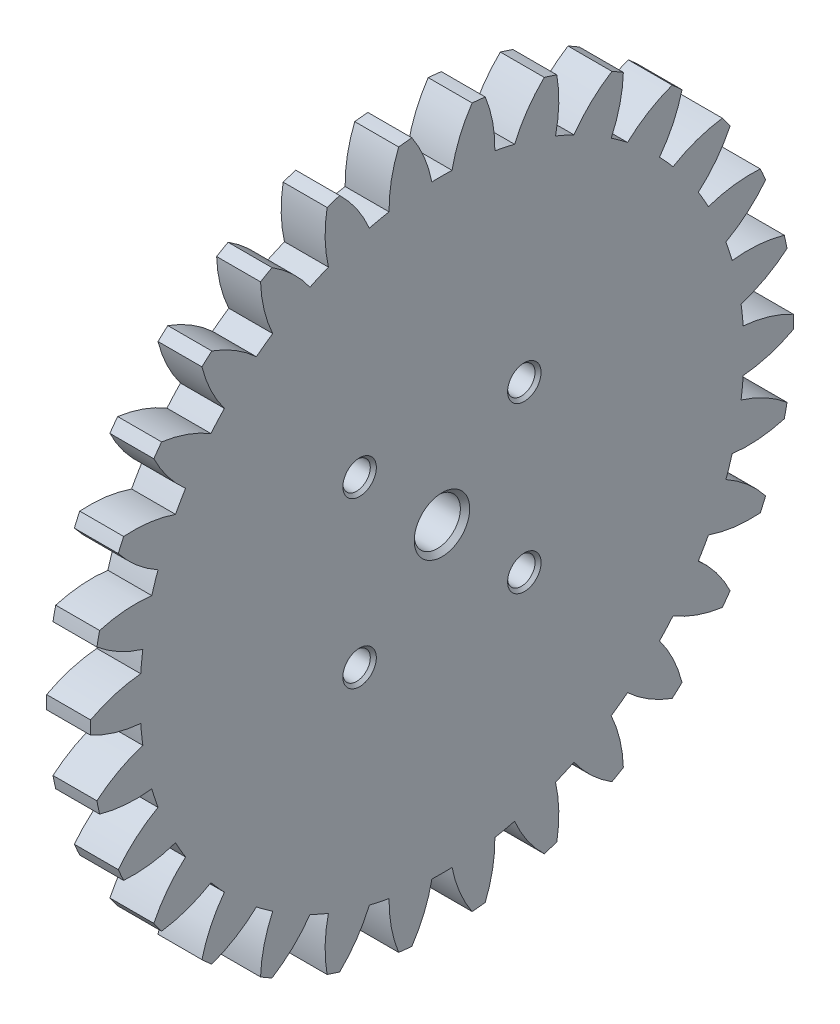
ISO-10303-21;
HEADER;
FILE_DESCRIPTION(('STEP AP214'),'2;1');
FILE_NAME('part.step','',(''),(''),'','','');
FILE_SCHEMA(('AUTOMOTIVE_DESIGN { 1 0 10303 214 1 1 1 1 }'));
ENDSEC;
DATA;
#1=APPLICATION_CONTEXT('core data for automotive mechanical design processes');
#2=APPLICATION_PROTOCOL_DEFINITION('international standard','automotive_design',2000,#1);
#3=PRODUCT_CONTEXT('',#1,'mechanical');
#4=PRODUCT('Part','Part','',(#3));
#5=PRODUCT_RELATED_PRODUCT_CATEGORY('part','',(#4));
#6=PRODUCT_DEFINITION_FORMATION('','',#4);
#7=PRODUCT_DEFINITION_CONTEXT('part definition',#1,'design');
#8=PRODUCT_DEFINITION('design','',#6,#7);
#9=PRODUCT_DEFINITION_SHAPE('','',#8);
#10=(LENGTH_UNIT() NAMED_UNIT(*) SI_UNIT(.MILLI.,.METRE.));
#11=(NAMED_UNIT(*) PLANE_ANGLE_UNIT() SI_UNIT($,.RADIAN.));
#12=(NAMED_UNIT(*) SI_UNIT($,.STERADIAN.) SOLID_ANGLE_UNIT());
#13=UNCERTAINTY_MEASURE_WITH_UNIT(LENGTH_MEASURE(1.E-05),#10,'distance_accuracy_value','');
#14=(GEOMETRIC_REPRESENTATION_CONTEXT(3) GLOBAL_UNCERTAINTY_ASSIGNED_CONTEXT((#13)) GLOBAL_UNIT_ASSIGNED_CONTEXT((#10,
#11,#12)) REPRESENTATION_CONTEXT('',''));
#15=CARTESIAN_POINT('',(0.,0.,0.));
#16=DIRECTION('',(0.,0.,1.));
#17=DIRECTION('',(1.,0.,0.));
#18=AXIS2_PLACEMENT_3D('',#15,#16,#17);
#19=CARTESIAN_POINT('',(4.,0.,0.));
#20=DIRECTION('',(-1.,0.,0.));
#21=DIRECTION('',(0.,0.,1.));
#22=AXIS2_PLACEMENT_3D('',#19,#20,#21);
#23=PLANE('',#22);
#24=CARTESIAN_POINT('',(4.,0.,0.));
#25=DIRECTION('',(1.,0.,0.));
#26=DIRECTION('',(0.,0.,-1.));
#27=AXIS2_PLACEMENT_3D('',#24,#25,#26);
#28=CIRCLE('',#27,2.525);
#29=CARTESIAN_POINT('',(4.,0.,-2.525));
#30=VERTEX_POINT('',#29);
#31=EDGE_CURVE('E1868',#30,#30,#28,.T.);
#32=ORIENTED_EDGE('',*,*,#31,.F.);
#33=EDGE_LOOP('',(#32));
#34=FACE_BOUND('',#33,.T.);
#35=CARTESIAN_POINT('',(4.,7.5,7.5));
#36=DIRECTION('',(1.,0.,0.));
#37=DIRECTION('',(0.,0.,-1.));
#38=AXIS2_PLACEMENT_3D('',#35,#36,#37);
#39=CIRCLE('',#38,1.525);
#40=CARTESIAN_POINT('',(4.,7.5,5.975));
#41=VERTEX_POINT('',#40);
#42=EDGE_CURVE('E1518',#41,#41,#39,.T.);
#43=ORIENTED_EDGE('',*,*,#42,.F.);
#44=EDGE_LOOP('',(#43));
#45=FACE_BOUND('',#44,.T.);
#46=CARTESIAN_POINT('',(4.,-7.5,7.5));
#47=DIRECTION('',(1.,0.,0.));
#48=DIRECTION('',(0.,0.,-1.));
#49=AXIS2_PLACEMENT_3D('',#46,#47,#48);
#50=CIRCLE('',#49,1.525);
#51=CARTESIAN_POINT('',(4.,-7.5,5.975));
#52=VERTEX_POINT('',#51);
#53=EDGE_CURVE('E1511',#52,#52,#50,.T.);
#54=ORIENTED_EDGE('',*,*,#53,.F.);
#55=EDGE_LOOP('',(#54));
#56=FACE_BOUND('',#55,.T.);
#57=CARTESIAN_POINT('',(4.,-7.5,-7.50000000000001));
#58=DIRECTION('',(1.,0.,0.));
#59=DIRECTION('',(0.,0.,-1.));
#60=AXIS2_PLACEMENT_3D('',#57,#58,#59);
#61=CIRCLE('',#60,1.525);
#62=CARTESIAN_POINT('',(4.,-7.5,-9.02500000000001));
#63=VERTEX_POINT('',#62);
#64=EDGE_CURVE('E1507',#63,#63,#61,.T.);
#65=ORIENTED_EDGE('',*,*,#64,.F.);
#66=EDGE_LOOP('',(#65));
#67=FACE_BOUND('',#66,.T.);
#68=CARTESIAN_POINT('',(4.,7.5,-7.5));
#69=DIRECTION('',(1.,0.,0.));
#70=DIRECTION('',(0.,0.,-1.));
#71=AXIS2_PLACEMENT_3D('',#68,#69,#70);
#72=CIRCLE('',#71,1.525);
#73=CARTESIAN_POINT('',(4.,7.5,-9.025));
#74=VERTEX_POINT('',#73);
#75=EDGE_CURVE('E1503',#74,#74,#72,.T.);
#76=ORIENTED_EDGE('',*,*,#75,.F.);
#77=EDGE_LOOP('',(#76));
#78=FACE_BOUND('',#77,.T.);
#79=CARTESIAN_POINT('',(4.,9.99299344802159,26.3601988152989));
#80=DIRECTION('',(-1.,0.,0.));
#81=DIRECTION('',(0.,0.994521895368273,0.104528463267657));
#82=AXIS2_PLACEMENT_3D('',#79,#80,#81);
#83=CIRCLE('',#82,12.);
#84=CARTESIAN_POINT('',(4.,-1.95930452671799,27.4291109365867));
#85=VERTEX_POINT('',#84);
#86=CARTESIAN_POINT('',(4.,-0.602124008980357,31.9943346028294));
#87=VERTEX_POINT('',#86);
#88=EDGE_CURVE('E850',#85,#87,#83,.T.);
#89=ORIENTED_EDGE('',*,*,#88,.F.);
#90=CARTESIAN_POINT('',(4.,0.,0.));
#91=DIRECTION('',(-1.,0.,0.));
#92=DIRECTION('',(0.,0.994521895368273,0.104528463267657));
#93=AXIS2_PLACEMENT_3D('',#90,#91,#92);
#94=CIRCLE('',#93,27.499);
#95=CARTESIAN_POINT('',(4.,-3.78634381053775,27.2370813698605));
#96=VERTEX_POINT('',#95);
#97=EDGE_CURVE('E855',#96,#85,#94,.T.);
#98=ORIENTED_EDGE('',*,*,#97,.F.);
#99=CARTESIAN_POINT('',(4.,-15.2552160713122,23.7065050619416));
#100=DIRECTION('',(-1.,0.,0.));
#101=DIRECTION('',(0.,0.994521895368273,0.104528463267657));
#102=AXIS2_PLACEMENT_3D('',#99,#100,#101);
#103=CIRCLE('',#102,12.);
#104=CARTESIAN_POINT('',(4.,-6.06303004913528,31.4203702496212));
#105=VERTEX_POINT('',#104);
#106=EDGE_CURVE('E852',#105,#96,#103,.T.);
#107=ORIENTED_EDGE('',*,*,#106,.F.);
#108=CARTESIAN_POINT('',(4.,0.,0.));
#109=DIRECTION('',(-1.,0.,0.));
#110=DIRECTION('',(0.,0.,1.));
#111=AXIS2_PLACEMENT_3D('',#108,#109,#110);
#112=CIRCLE('',#111,32.);
#113=CARTESIAN_POINT('',(4.,-7.24096235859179,31.1699930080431));
#114=VERTEX_POINT('',#113);
#115=EDGE_CURVE('E1685',#114,#105,#112,.T.);
#116=ORIENTED_EDGE('',*,*,#115,.F.);
#117=CARTESIAN_POINT('',(4.,4.29402905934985,27.8618253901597));
#118=DIRECTION('',(-1.,0.,0.));
#119=DIRECTION('',(0.,0.951056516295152,0.309016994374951));
#120=AXIS2_PLACEMENT_3D('',#117,#118,#119);
#121=CIRCLE('',#120,12.);
#122=CARTESIAN_POINT('',(4.,-7.61932185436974,26.4223567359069));
#123=VERTEX_POINT('',#122);
#124=EDGE_CURVE('E985',#123,#114,#121,.T.);
#125=ORIENTED_EDGE('',*,*,#124,.F.);
#126=CARTESIAN_POINT('',(4.,0.,0.));
#127=DIRECTION('',(-1.,0.,0.));
#128=DIRECTION('',(0.,0.951056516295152,0.309016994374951));
#129=AXIS2_PLACEMENT_3D('',#126,#127,#128);
#130=CIRCLE('',#129,27.499);
#131=CARTESIAN_POINT('',(4.,-9.3665107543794,25.8546606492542));
#132=VERTEX_POINT('',#131);
#133=EDGE_CURVE('E990',#132,#123,#130,.T.);
#134=ORIENTED_EDGE('',*,*,#133,.F.);
#135=CARTESIAN_POINT('',(4.,-19.8507125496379,20.0167232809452));
#136=DIRECTION('',(-1.,0.,0.));
#137=DIRECTION('',(0.,0.951056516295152,0.309016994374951));
#138=AXIS2_PLACEMENT_3D('',#135,#136,#137);
#139=CIRCLE('',#138,12.);
#140=CARTESIAN_POINT('',(4.,-12.4632006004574,29.4731849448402));
#141=VERTEX_POINT('',#140);
#142=EDGE_CURVE('E987',#141,#132,#139,.T.);
#143=ORIENTED_EDGE('',*,*,#142,.F.);
#144=CARTESIAN_POINT('',(4.,-13.5633359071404,28.9833731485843));
#145=VERTEX_POINT('',#144);
#146=EDGE_CURVE('E1679',#145,#141,#112,.T.);
#147=ORIENTED_EDGE('',*,*,#146,.F.);
#148=CARTESIAN_POINT('',(4.,-1.59260500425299,28.1457564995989));
#149=DIRECTION('',(-1.,0.,0.));
#150=DIRECTION('',(0.,0.866025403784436,0.500000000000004));
#151=AXIS2_PLACEMENT_3D('',#148,#149,#150);
#152=CIRCLE('',#151,12.);
#153=CARTESIAN_POINT('',(4.,-12.9463382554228,24.2608187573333));
#154=VERTEX_POINT('',#153);
#155=EDGE_CURVE('E1019',#154,#145,#152,.T.);
#156=ORIENTED_EDGE('',*,*,#155,.F.);
#157=CARTESIAN_POINT('',(4.,0.,0.));
#158=DIRECTION('',(-1.,0.,0.));
#159=DIRECTION('',(0.,0.866025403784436,0.500000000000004));
#160=AXIS2_PLACEMENT_3D('',#157,#158,#159);
#161=CIRCLE('',#160,27.499);
#162=CARTESIAN_POINT('',(4.,-14.5373162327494,23.342267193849));
#163=VERTEX_POINT('',#162);
#164=EDGE_CURVE('E1024',#163,#154,#161,.T.);
#165=ORIENTED_EDGE('',*,*,#164,.F.);
#166=CARTESIAN_POINT('',(4.,-23.5786376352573,15.4521146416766));
#167=DIRECTION('',(-1.,0.,0.));
#168=DIRECTION('',(0.,0.866025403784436,0.500000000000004));
#169=AXIS2_PLACEMENT_3D('',#166,#167,#168);
#170=CIRCLE('',#169,12.);
#171=CARTESIAN_POINT('',(4.,-18.3186694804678,26.2378800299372));
#172=VERTEX_POINT('',#171);
#173=EDGE_CURVE('E1021',#172,#163,#170,.T.);
#174=ORIENTED_EDGE('',*,*,#173,.F.);
#175=CARTESIAN_POINT('',(4.,-19.2929265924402,25.5300408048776));
#176=VERTEX_POINT('',#175);
#177=EDGE_CURVE('E1673',#176,#172,#112,.T.);
#178=ORIENTED_EDGE('',*,*,#177,.F.);
#179=CARTESIAN_POINT('',(4.,-7.40963458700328,27.1995829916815));
#180=DIRECTION('',(-1.,0.,0.));
#181=DIRECTION('',(0.,0.743144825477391,0.669130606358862));
#182=AXIS2_PLACEMENT_3D('',#179,#180,#181);
#183=CIRCLE('',#182,12.);
#184=CARTESIAN_POINT('',(4.,-17.7075375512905,21.0389665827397));
#185=VERTEX_POINT('',#184);
#186=EDGE_CURVE('E1002',#185,#176,#183,.T.);
#187=ORIENTED_EDGE('',*,*,#186,.F.);
#188=CARTESIAN_POINT('',(4.,0.,0.));
#189=DIRECTION('',(-1.,0.,0.));
#190=DIRECTION('',(0.,0.743144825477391,0.669130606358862));
#191=AXIS2_PLACEMENT_3D('',#188,#189,#190);
#192=CIRCLE('',#191,27.499);
#193=CARTESIAN_POINT('',(4.,-19.0727712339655,19.8097046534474));
#194=VERTEX_POINT('',#193);
#195=EDGE_CURVE('E1007',#194,#185,#192,.T.);
#196=ORIENTED_EDGE('',*,*,#195,.F.);
#197=CARTESIAN_POINT('',(4.,-26.2760631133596,10.212174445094));
#198=DIRECTION('',(-1.,0.,0.));
#199=DIRECTION('',(0.,0.743144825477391,0.669130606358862));
#200=AXIS2_PLACEMENT_3D('',#197,#198,#199);
#201=CIRCLE('',#200,12.);
#202=CARTESIAN_POINT('',(4.,-23.373524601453,21.8558538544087));
#203=VERTEX_POINT('',#202);
#204=EDGE_CURVE('E1004',#203,#194,#201,.T.);
#205=ORIENTED_EDGE('',*,*,#204,.F.);
#206=CARTESIAN_POINT('',(4.,-24.1793238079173,20.96092317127));
#207=VERTEX_POINT('',#206);
#208=EDGE_CURVE('E1667',#207,#203,#112,.T.);
#209=ORIENTED_EDGE('',*,*,#208,.F.);
#210=CARTESIAN_POINT('',(4.,-12.90282758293,25.0646571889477));
#211=DIRECTION('',(-1.,0.,0.));
#212=DIRECTION('',(0.,0.587785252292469,0.80901699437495));
#213=AXIS2_PLACEMENT_3D('',#210,#211,#212);
#214=CIRCLE('',#213,12.);
#215=CARTESIAN_POINT('',(4.,-21.6948324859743,16.8976106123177));
#216=VERTEX_POINT('',#215);
#217=EDGE_CURVE('E934',#216,#207,#214,.T.);
#218=ORIENTED_EDGE('',*,*,#217,.F.);
#219=CARTESIAN_POINT('',(4.,0.,0.));
#220=DIRECTION('',(-1.,0.,0.));
#221=DIRECTION('',(0.,0.587785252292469,0.80901699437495));
#222=AXIS2_PLACEMENT_3D('',#219,#220,#221);
#223=CIRCLE('',#222,27.499);
#224=CARTESIAN_POINT('',(4.,-22.7746546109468,15.4113629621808));
#225=VERTEX_POINT('',#224);
#226=EDGE_CURVE('E939',#225,#216,#223,.T.);
#227=ORIENTED_EDGE('',*,*,#226,.F.);
#228=CARTESIAN_POINT('',(4.,-27.8250985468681,4.52591322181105));
#229=DIRECTION('',(-1.,0.,0.));
#230=DIRECTION('',(0.,0.587785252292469,0.80901699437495));
#231=AXIS2_PLACEMENT_3D('',#228,#229,#230);
#232=CIRCLE('',#231,12.);
#233=CARTESIAN_POINT('',(4.,-27.4068445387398,16.51862198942));
#234=VERTEX_POINT('',#233);
#235=EDGE_CURVE('E936',#234,#225,#232,.T.);
#236=ORIENTED_EDGE('',*,*,#235,.F.);
#237=CARTESIAN_POINT('',(4.,-28.00896854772,15.4757126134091));
#238=VERTEX_POINT('',#237);
#239=EDGE_CURVE('E1661',#238,#234,#112,.T.);
#240=ORIENTED_EDGE('',*,*,#239,.F.);
#241=CARTESIAN_POINT('',(4.,-17.8321050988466,21.8342855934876));
#242=DIRECTION('',(-1.,0.,0.));
#243=DIRECTION('',(0.,0.406736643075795,0.913545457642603));
#244=AXIS2_PLACEMENT_3D('',#241,#242,#243);
#245=CIRCLE('',#244,12.);
#246=CARTESIAN_POINT('',(4.,-24.7339591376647,12.0177479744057));
#247=VERTEX_POINT('',#246);
#248=EDGE_CURVE('E915',#247,#238,#245,.T.);
#249=ORIENTED_EDGE('',*,*,#248,.F.);
#250=CARTESIAN_POINT('',(4.,0.,0.));
#251=DIRECTION('',(-1.,0.,0.));
#252=DIRECTION('',(0.,0.406736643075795,0.913545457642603));
#253=AXIS2_PLACEMENT_3D('',#250,#251,#252);
#254=CIRCLE('',#253,27.499);
#255=CARTESIAN_POINT('',(4.,-25.481176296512,10.3394707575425));
#256=VERTEX_POINT('',#255);
#257=EDGE_CURVE('E920',#256,#247,#254,.T.);
#258=ORIENTED_EDGE('',*,*,#257,.F.);
#259=CARTESIAN_POINT('',(4.,-28.158043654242,-1.35815212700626));
#260=DIRECTION('',(-1.,0.,0.));
#261=DIRECTION('',(0.,0.406736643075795,0.913545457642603));
#262=AXIS2_PLACEMENT_3D('',#259,#260,#261);
#263=CIRCLE('',#262,12.);
#264=CARTESIAN_POINT('',(4.,-30.2423538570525,10.459447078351));
#265=VERTEX_POINT('',#264);
#266=EDGE_CURVE('E917',#265,#256,#263,.T.);
#267=ORIENTED_EDGE('',*,*,#266,.F.);
#268=CARTESIAN_POINT('',(4.,-30.6144869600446,9.31413915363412));
#269=VERTEX_POINT('',#268);
#270=EDGE_CURVE('E1655',#269,#265,#112,.T.);
#271=ORIENTED_EDGE('',*,*,#270,.F.);
#272=CARTESIAN_POINT('',(4.,-21.9820340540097,17.6496509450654));
#273=DIRECTION('',(-1.,0.,0.));
#274=DIRECTION('',(0.,0.207911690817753,0.978147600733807));
#275=AXIS2_PLACEMENT_3D('',#272,#273,#274);
#276=CIRCLE('',#275,12.);
#277=CARTESIAN_POINT('',(4.,-26.6920930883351,6.61265208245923));
#278=VERTEX_POINT('',#277);
#279=EDGE_CURVE('E951',#278,#269,#276,.T.);
#280=ORIENTED_EDGE('',*,*,#279,.F.);
#281=CARTESIAN_POINT('',(4.,0.,0.));
#282=DIRECTION('',(-1.,0.,0.));
#283=DIRECTION('',(0.,0.207911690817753,0.978147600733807));
#284=AXIS2_PLACEMENT_3D('',#281,#282,#283);
#285=CIRCLE('',#284,27.499);
#286=CARTESIAN_POINT('',(4.,-27.0740483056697,4.81569406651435));
#287=VERTEX_POINT('',#286);
#288=EDGE_CURVE('E956',#287,#278,#285,.T.);
#289=ORIENTED_EDGE('',*,*,#288,.F.);
#290=CARTESIAN_POINT('',(4.,-27.2603471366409,-7.18285971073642));
#291=DIRECTION('',(-1.,0.,0.));
#292=DIRECTION('',(0.,0.207911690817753,0.978147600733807));
#293=AXIS2_PLACEMENT_3D('',#290,#291,#292);
#294=CIRCLE('',#293,12.);
#295=CARTESIAN_POINT('',(4.,-31.7561271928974,3.94314413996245));
#296=VERTEX_POINT('',#295);
#297=EDGE_CURVE('E953',#296,#287,#294,.T.);
#298=ORIENTED_EDGE('',*,*,#297,.F.);
#299=CARTESIAN_POINT('',(4.,-31.882005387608,2.74549311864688));
#300=VERTEX_POINT('',#299);
#301=EDGE_CURVE('E1649',#300,#296,#112,.T.);
#302=ORIENTED_EDGE('',*,*,#301,.F.);
#303=CARTESIAN_POINT('',(4.,-25.1712426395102,12.6936418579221));
#304=DIRECTION('',(-1.,0.,0.));
#305=DIRECTION('',(0.,0.,1.));
#306=AXIS2_PLACEMENT_3D('',#303,#304,#305);
#307=CIRCLE('',#306,12.);
#308=CARTESIAN_POINT('',(4.,-27.4836544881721,0.918551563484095));
#309=VERTEX_POINT('',#308);
#310=EDGE_CURVE('E968',#309,#300,#307,.T.);
#311=ORIENTED_EDGE('',*,*,#310,.F.);
#312=CARTESIAN_POINT('',(4.,0.,0.));
#313=DIRECTION('',(-1.,0.,0.));
#314=DIRECTION('',(0.,0.,1.));
#315=AXIS2_PLACEMENT_3D('',#312,#313,#314);
#316=CIRCLE('',#315,27.499);
#317=CARTESIAN_POINT('',(4.,-27.4836544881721,-0.918551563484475));
#318=VERTEX_POINT('',#317);
#319=EDGE_CURVE('E973',#318,#309,#316,.T.);
#320=ORIENTED_EDGE('',*,*,#319,.F.);
#321=CARTESIAN_POINT('',(4.,-25.17124263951,-12.6936418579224));
#322=DIRECTION('',(-1.,0.,0.));
#323=DIRECTION('',(0.,0.,1.));
#324=AXIS2_PLACEMENT_3D('',#321,#322,#323);
#325=CIRCLE('',#324,12.);
#326=CARTESIAN_POINT('',(4.,-31.8820053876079,-2.74549311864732));
#327=VERTEX_POINT('',#326);
#328=EDGE_CURVE('E970',#327,#318,#325,.T.);
#329=ORIENTED_EDGE('',*,*,#328,.F.);
#330=CARTESIAN_POINT('',(4.,-31.7561271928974,-3.94314413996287));
#331=VERTEX_POINT('',#330);
#332=EDGE_CURVE('E1643',#331,#327,#112,.T.);
#333=ORIENTED_EDGE('',*,*,#332,.F.);
#334=CARTESIAN_POINT('',(4.,-27.260347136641,7.18285971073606));
#335=DIRECTION('',(-1.,0.,0.));
#336=DIRECTION('',(0.,-0.207911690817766,0.978147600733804));
#337=AXIS2_PLACEMENT_3D('',#334,#335,#336);
#338=CIRCLE('',#337,12.);
#339=CARTESIAN_POINT('',(4.,-27.0740483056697,-4.81569406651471));
#340=VERTEX_POINT('',#339);
#341=EDGE_CURVE('E1104',#340,#331,#338,.T.);
#342=ORIENTED_EDGE('',*,*,#341,.F.);
#343=CARTESIAN_POINT('',(4.,0.,0.));
#344=DIRECTION('',(-1.,0.,0.));
#345=DIRECTION('',(0.,-0.207911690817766,0.978147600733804));
#346=AXIS2_PLACEMENT_3D('',#343,#344,#345);
#347=CIRCLE('',#346,27.499);
#348=CARTESIAN_POINT('',(4.,-26.692093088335,-6.61265208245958));
#349=VERTEX_POINT('',#348);
#350=EDGE_CURVE('E1109',#349,#340,#347,.T.);
#351=ORIENTED_EDGE('',*,*,#350,.F.);
#352=CARTESIAN_POINT('',(4.,-21.9820340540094,-17.6496509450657));
#353=DIRECTION('',(-1.,0.,0.));
#354=DIRECTION('',(0.,-0.207911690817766,0.978147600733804));
#355=AXIS2_PLACEMENT_3D('',#352,#353,#354);
#356=CIRCLE('',#355,12.);
#357=CARTESIAN_POINT('',(4.,-30.6144869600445,-9.31413915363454));
#358=VERTEX_POINT('',#357);
#359=EDGE_CURVE('E1106',#358,#349,#356,.T.);
#360=ORIENTED_EDGE('',*,*,#359,.F.);
#361=CARTESIAN_POINT('',(4.,-30.2423538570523,-10.4594470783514));
#362=VERTEX_POINT('',#361);
#363=EDGE_CURVE('E1637',#362,#358,#112,.T.);
#364=ORIENTED_EDGE('',*,*,#363,.F.);
#365=CARTESIAN_POINT('',(4.,-28.158043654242,1.35815212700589));
#366=DIRECTION('',(-1.,0.,0.));
#367=DIRECTION('',(0.,-0.406736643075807,0.913545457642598));
#368=AXIS2_PLACEMENT_3D('',#365,#366,#367);
#369=CIRCLE('',#368,12.);
#370=CARTESIAN_POINT('',(4.,-25.4811762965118,-10.3394707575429));
#371=VERTEX_POINT('',#370);
#372=EDGE_CURVE('E1138',#371,#362,#369,.T.);
#373=ORIENTED_EDGE('',*,*,#372,.F.);
#374=CARTESIAN_POINT('',(4.,0.,0.));
#375=DIRECTION('',(-1.,0.,0.));
#376=DIRECTION('',(0.,-0.406736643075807,0.913545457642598));
#377=AXIS2_PLACEMENT_3D('',#374,#375,#376);
#378=CIRCLE('',#377,27.499);
#379=CARTESIAN_POINT('',(4.,-24.7339591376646,-12.017747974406));
#380=VERTEX_POINT('',#379);
#381=EDGE_CURVE('E1143',#380,#371,#378,.T.);
#382=ORIENTED_EDGE('',*,*,#381,.F.);
#383=CARTESIAN_POINT('',(4.,-17.8321050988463,-21.8342855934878));
#384=DIRECTION('',(-1.,0.,0.));
#385=DIRECTION('',(0.,-0.406736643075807,0.913545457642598));
#386=AXIS2_PLACEMENT_3D('',#383,#384,#385);
#387=CIRCLE('',#386,12.);
#388=CARTESIAN_POINT('',(4.,-28.0089685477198,-15.4757126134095));
#389=VERTEX_POINT('',#388);
#390=EDGE_CURVE('E1140',#389,#380,#387,.T.);
#391=ORIENTED_EDGE('',*,*,#390,.F.);
#392=CARTESIAN_POINT('',(4.,-27.4068445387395,-16.5186219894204));
#393=VERTEX_POINT('',#392);
#394=EDGE_CURVE('E1631',#393,#389,#112,.T.);
#395=ORIENTED_EDGE('',*,*,#394,.F.);
#396=CARTESIAN_POINT('',(4.,-27.8250985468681,-4.52591322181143));
#397=DIRECTION('',(-1.,0.,0.));
#398=DIRECTION('',(0.,-0.58778525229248,0.809016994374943));
#399=AXIS2_PLACEMENT_3D('',#396,#397,#398);
#400=CIRCLE('',#399,12.);
#401=CARTESIAN_POINT('',(4.,-22.7746546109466,-15.4113629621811));
#402=VERTEX_POINT('',#401);
#403=EDGE_CURVE('E1121',#402,#393,#400,.T.);
#404=ORIENTED_EDGE('',*,*,#403,.F.);
#405=CARTESIAN_POINT('',(4.,0.,0.));
#406=DIRECTION('',(-1.,0.,0.));
#407=DIRECTION('',(0.,-0.58778525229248,0.809016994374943));
#408=AXIS2_PLACEMENT_3D('',#405,#406,#407);
#409=CIRCLE('',#408,27.499);
#410=CARTESIAN_POINT('',(4.,-21.6948324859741,-16.897610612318));
#411=VERTEX_POINT('',#410);
#412=EDGE_CURVE('E1126',#411,#402,#409,.T.);
#413=ORIENTED_EDGE('',*,*,#412,.F.);
#414=CARTESIAN_POINT('',(4.,-12.9028275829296,-25.0646571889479));
#415=DIRECTION('',(-1.,0.,0.));
#416=DIRECTION('',(0.,-0.58778525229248,0.809016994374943));
#417=AXIS2_PLACEMENT_3D('',#414,#415,#416);
#418=CIRCLE('',#417,12.);
#419=CARTESIAN_POINT('',(4.,-24.179323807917,-20.9609231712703));
#420=VERTEX_POINT('',#419);
#421=EDGE_CURVE('E1123',#420,#411,#418,.T.);
#422=ORIENTED_EDGE('',*,*,#421,.F.);
#423=CARTESIAN_POINT('',(4.,-23.3735246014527,-21.855853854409));
#424=VERTEX_POINT('',#423);
#425=EDGE_CURVE('E1625',#424,#420,#112,.T.);
#426=ORIENTED_EDGE('',*,*,#425,.F.);
#427=CARTESIAN_POINT('',(4.,-26.2760631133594,-10.2121744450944));
#428=DIRECTION('',(-1.,0.,0.));
#429=DIRECTION('',(0.,-0.7431448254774,0.669130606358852));
#430=AXIS2_PLACEMENT_3D('',#427,#428,#429);
#431=CIRCLE('',#430,12.);
#432=CARTESIAN_POINT('',(4.,-19.0727712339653,-19.8097046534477));
#433=VERTEX_POINT('',#432);
#434=EDGE_CURVE('E1053',#433,#424,#431,.T.);
#435=ORIENTED_EDGE('',*,*,#434,.F.);
#436=CARTESIAN_POINT('',(4.,0.,0.));
#437=DIRECTION('',(-1.,0.,0.));
#438=DIRECTION('',(0.,-0.7431448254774,0.669130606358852));
#439=AXIS2_PLACEMENT_3D('',#436,#437,#438);
#440=CIRCLE('',#439,27.499);
#441=CARTESIAN_POINT('',(4.,-17.7075375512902,-21.0389665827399));
#442=VERTEX_POINT('',#441);
#443=EDGE_CURVE('E1058',#442,#433,#440,.T.);
#444=ORIENTED_EDGE('',*,*,#443,.F.);
#445=CARTESIAN_POINT('',(4.,-7.40963458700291,-27.1995829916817));
#446=DIRECTION('',(-1.,0.,0.));
#447=DIRECTION('',(0.,-0.7431448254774,0.669130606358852));
#448=AXIS2_PLACEMENT_3D('',#445,#446,#447);
#449=CIRCLE('',#448,12.);
#450=CARTESIAN_POINT('',(4.,-19.2929265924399,-25.5300408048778));
#451=VERTEX_POINT('',#450);
#452=EDGE_CURVE('E1055',#451,#442,#449,.T.);
#453=ORIENTED_EDGE('',*,*,#452,.F.);
#454=CARTESIAN_POINT('',(4.,-18.3186694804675,-26.2378800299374));
#455=VERTEX_POINT('',#454);
#456=EDGE_CURVE('E1619',#455,#451,#112,.T.);
#457=ORIENTED_EDGE('',*,*,#456,.F.);
#458=CARTESIAN_POINT('',(4.,-23.5786376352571,-15.4521146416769));
#459=DIRECTION('',(-1.,0.,0.));
#460=DIRECTION('',(0.,-0.866025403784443,0.499999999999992));
#461=AXIS2_PLACEMENT_3D('',#458,#459,#460);
#462=CIRCLE('',#461,12.);
#463=CARTESIAN_POINT('',(4.,-14.5373162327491,-23.3422671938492));
#464=VERTEX_POINT('',#463);
#465=EDGE_CURVE('E1034',#464,#455,#462,.T.);
#466=ORIENTED_EDGE('',*,*,#465,.F.);
#467=CARTESIAN_POINT('',(4.,0.,0.));
#468=DIRECTION('',(-1.,0.,0.));
#469=DIRECTION('',(0.,-0.866025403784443,0.499999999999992));
#470=AXIS2_PLACEMENT_3D('',#467,#468,#469);
#471=CIRCLE('',#470,27.499);
#472=CARTESIAN_POINT('',(4.,-12.9463382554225,-24.2608187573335));
#473=VERTEX_POINT('',#472);
#474=EDGE_CURVE('E1039',#473,#464,#471,.T.);
#475=ORIENTED_EDGE('',*,*,#474,.F.);
#476=CARTESIAN_POINT('',(4.,-1.5926050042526,-28.145756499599));
#477=DIRECTION('',(-1.,0.,0.));
#478=DIRECTION('',(0.,-0.866025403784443,0.499999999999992));
#479=AXIS2_PLACEMENT_3D('',#476,#477,#478);
#480=CIRCLE('',#479,12.);
#481=CARTESIAN_POINT('',(4.,-13.5633359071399,-28.9833731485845));
#482=VERTEX_POINT('',#481);
#483=EDGE_CURVE('E1036',#482,#473,#480,.T.);
#484=ORIENTED_EDGE('',*,*,#483,.F.);
#485=CARTESIAN_POINT('',(4.,-12.463200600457,-29.4731849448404));
#486=VERTEX_POINT('',#485);
#487=EDGE_CURVE('E1613',#486,#482,#112,.T.);
#488=ORIENTED_EDGE('',*,*,#487,.F.);
#489=CARTESIAN_POINT('',(4.,-19.8507125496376,-20.0167232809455));
#490=DIRECTION('',(-1.,0.,0.));
#491=DIRECTION('',(0.,-0.951056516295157,0.309016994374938));
#492=AXIS2_PLACEMENT_3D('',#489,#490,#491);
#493=CIRCLE('',#492,12.);
#494=CARTESIAN_POINT('',(4.,-9.36651075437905,-25.8546606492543));
#495=VERTEX_POINT('',#494);
#496=EDGE_CURVE('E1070',#495,#486,#493,.T.);
#497=ORIENTED_EDGE('',*,*,#496,.F.);
#498=CARTESIAN_POINT('',(4.,0.,0.));
#499=DIRECTION('',(-1.,0.,0.));
#500=DIRECTION('',(0.,-0.951056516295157,0.309016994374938));
#501=AXIS2_PLACEMENT_3D('',#498,#499,#500);
#502=CIRCLE('',#501,27.499);
#503=CARTESIAN_POINT('',(4.,-7.61932185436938,-26.422356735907));
#504=VERTEX_POINT('',#503);
#505=EDGE_CURVE('E1075',#504,#495,#502,.T.);
#506=ORIENTED_EDGE('',*,*,#505,.F.);
#507=CARTESIAN_POINT('',(4.,4.29402905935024,-27.8618253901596));
#508=DIRECTION('',(-1.,0.,0.));
#509=DIRECTION('',(0.,-0.951056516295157,0.309016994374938));
#510=AXIS2_PLACEMENT_3D('',#507,#508,#509);
#511=CIRCLE('',#510,12.);
#512=CARTESIAN_POINT('',(4.,-7.24096235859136,-31.1699930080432));
#513=VERTEX_POINT('',#512);
#514=EDGE_CURVE('E1072',#513,#504,#511,.T.);
#515=ORIENTED_EDGE('',*,*,#514,.F.);
#516=CARTESIAN_POINT('',(4.,-6.06303004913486,-31.4203702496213));
#517=VERTEX_POINT('',#516);
#518=EDGE_CURVE('E1607',#517,#513,#112,.T.);
#519=ORIENTED_EDGE('',*,*,#518,.F.);
#520=CARTESIAN_POINT('',(4.,-15.2552160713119,-23.7065050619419));
#521=DIRECTION('',(-1.,0.,0.));
#522=DIRECTION('',(0.,-0.994521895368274,0.104528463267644));
#523=AXIS2_PLACEMENT_3D('',#520,#521,#522);
#524=CIRCLE('',#523,12.);
#525=CARTESIAN_POINT('',(4.,-3.78634381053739,-27.2370813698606));
#526=VERTEX_POINT('',#525);
#527=EDGE_CURVE('E1087',#526,#517,#524,.T.);
#528=ORIENTED_EDGE('',*,*,#527,.F.);
#529=CARTESIAN_POINT('',(4.,0.,0.));
#530=DIRECTION('',(-1.,0.,0.));
#531=DIRECTION('',(0.,-0.994521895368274,0.104528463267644));
#532=AXIS2_PLACEMENT_3D('',#529,#530,#531);
#533=CIRCLE('',#532,27.499);
#534=CARTESIAN_POINT('',(4.,-1.95930452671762,-27.4291109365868));
#535=VERTEX_POINT('',#534);
#536=EDGE_CURVE('E1092',#535,#526,#533,.T.);
#537=ORIENTED_EDGE('',*,*,#536,.F.);
#538=CARTESIAN_POINT('',(4.,9.99299344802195,-26.3601988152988));
#539=DIRECTION('',(-1.,0.,0.));
#540=DIRECTION('',(0.,-0.994521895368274,0.104528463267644));
#541=AXIS2_PLACEMENT_3D('',#538,#539,#540);
#542=CIRCLE('',#541,12.);
#543=CARTESIAN_POINT('',(4.,-0.602124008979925,-31.9943346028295));
#544=VERTEX_POINT('',#543);
#545=EDGE_CURVE('E1089',#544,#535,#542,.T.);
#546=ORIENTED_EDGE('',*,*,#545,.F.);
#547=CARTESIAN_POINT('',(4.,0.602124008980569,-31.9943346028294));
#548=VERTEX_POINT('',#547);
#549=EDGE_CURVE('E1601',#548,#544,#112,.T.);
#550=ORIENTED_EDGE('',*,*,#549,.F.);
#551=CARTESIAN_POINT('',(4.,-9.99299344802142,-26.360198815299));
#552=DIRECTION('',(-1.,0.,0.));
#553=DIRECTION('',(0.,-0.994521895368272,-0.104528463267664));
#554=AXIS2_PLACEMENT_3D('',#551,#552,#553);
#555=CIRCLE('',#554,12.);
#556=CARTESIAN_POINT('',(4.,1.95930452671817,-27.4291109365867));
#557=VERTEX_POINT('',#556);
#558=EDGE_CURVE('E1223',#557,#548,#555,.T.);
#559=ORIENTED_EDGE('',*,*,#558,.F.);
#560=CARTESIAN_POINT('',(4.,0.,0.));
#561=DIRECTION('',(-1.,0.,0.));
#562=DIRECTION('',(0.,-0.994521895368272,-0.104528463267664));
#563=AXIS2_PLACEMENT_3D('',#560,#561,#562);
#564=CIRCLE('',#563,27.499);
#565=CARTESIAN_POINT('',(4.,3.78634381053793,-27.2370813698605));
#566=VERTEX_POINT('',#565);
#567=EDGE_CURVE('E1228',#566,#557,#564,.T.);
#568=ORIENTED_EDGE('',*,*,#567,.F.);
#569=CARTESIAN_POINT('',(4.,15.2552160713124,-23.7065050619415));
#570=DIRECTION('',(-1.,0.,0.));
#571=DIRECTION('',(0.,-0.994521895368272,-0.104528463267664));
#572=AXIS2_PLACEMENT_3D('',#569,#570,#571);
#573=CIRCLE('',#572,12.);
#574=CARTESIAN_POINT('',(4.,6.06303004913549,-31.4203702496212));
#575=VERTEX_POINT('',#574);
#576=EDGE_CURVE('E1225',#575,#566,#573,.T.);
#577=ORIENTED_EDGE('',*,*,#576,.F.);
#578=CARTESIAN_POINT('',(4.,7.24096235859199,-31.1699930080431));
#579=VERTEX_POINT('',#578);
#580=EDGE_CURVE('E1595',#579,#575,#112,.T.);
#581=ORIENTED_EDGE('',*,*,#580,.F.);
#582=CARTESIAN_POINT('',(4.,-4.29402905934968,-27.8618253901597));
#583=DIRECTION('',(-1.,0.,0.));
#584=DIRECTION('',(0.,-0.95105651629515,-0.309016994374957));
#585=AXIS2_PLACEMENT_3D('',#582,#583,#584);
#586=CIRCLE('',#585,12.);
#587=CARTESIAN_POINT('',(4.,7.61932185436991,-26.4223567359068));
#588=VERTEX_POINT('',#587);
#589=EDGE_CURVE('E1240',#588,#579,#586,.T.);
#590=ORIENTED_EDGE('',*,*,#589,.F.);
#591=CARTESIAN_POINT('',(4.,0.,0.));
#592=DIRECTION('',(-1.,0.,0.));
#593=DIRECTION('',(0.,-0.95105651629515,-0.309016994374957));
#594=AXIS2_PLACEMENT_3D('',#591,#592,#593);
#595=CIRCLE('',#594,27.499);
#596=CARTESIAN_POINT('',(4.,9.36651075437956,-25.8546606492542));
#597=VERTEX_POINT('',#596);
#598=EDGE_CURVE('E1245',#597,#588,#595,.T.);
#599=ORIENTED_EDGE('',*,*,#598,.F.);
#600=CARTESIAN_POINT('',(4.,19.850712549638,-20.0167232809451));
#601=DIRECTION('',(-1.,0.,0.));
#602=DIRECTION('',(0.,-0.95105651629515,-0.309016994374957));
#603=AXIS2_PLACEMENT_3D('',#600,#601,#602);
#604=CIRCLE('',#603,12.);
#605=CARTESIAN_POINT('',(4.,12.4632006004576,-29.4731849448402));
#606=VERTEX_POINT('',#605);
#607=EDGE_CURVE('E1242',#606,#597,#604,.T.);
#608=ORIENTED_EDGE('',*,*,#607,.F.);
#609=CARTESIAN_POINT('',(4.,13.5633359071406,-28.9833731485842));
#610=VERTEX_POINT('',#609);
#611=EDGE_CURVE('E1589',#610,#606,#112,.T.);
#612=ORIENTED_EDGE('',*,*,#611,.F.);
#613=CARTESIAN_POINT('',(4.,1.59260500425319,-28.1457564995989));
#614=DIRECTION('',(-1.,0.,0.));
#615=DIRECTION('',(0.,-0.866025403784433,-0.50000000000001));
#616=AXIS2_PLACEMENT_3D('',#613,#614,#615);
#617=CIRCLE('',#616,12.);
#618=CARTESIAN_POINT('',(4.,12.946338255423,-24.2608187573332));
#619=VERTEX_POINT('',#618);
#620=EDGE_CURVE('E1257',#619,#610,#617,.T.);
#621=ORIENTED_EDGE('',*,*,#620,.F.);
#622=CARTESIAN_POINT('',(4.,0.,0.));
#623=DIRECTION('',(-1.,0.,0.));
#624=DIRECTION('',(0.,-0.866025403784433,-0.50000000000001));
#625=AXIS2_PLACEMENT_3D('',#622,#623,#624);
#626=CIRCLE('',#625,27.499);
#627=CARTESIAN_POINT('',(4.,14.5373162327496,-23.3422671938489));
#628=VERTEX_POINT('',#627);
#629=EDGE_CURVE('E1262',#628,#619,#626,.T.);
#630=ORIENTED_EDGE('',*,*,#629,.F.);
#631=CARTESIAN_POINT('',(4.,23.5786376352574,-15.4521146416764));
#632=DIRECTION('',(-1.,0.,0.));
#633=DIRECTION('',(0.,-0.866025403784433,-0.50000000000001));
#634=AXIS2_PLACEMENT_3D('',#631,#632,#633);
#635=CIRCLE('',#634,12.);
#636=CARTESIAN_POINT('',(4.,18.318669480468,-26.237880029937));
#637=VERTEX_POINT('',#636);
#638=EDGE_CURVE('E1259',#637,#628,#635,.T.);
#639=ORIENTED_EDGE('',*,*,#638,.F.);
#640=CARTESIAN_POINT('',(4.,19.2929265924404,-25.5300408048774));
#641=VERTEX_POINT('',#640);
#642=EDGE_CURVE('E1583',#641,#637,#112,.T.);
#643=ORIENTED_EDGE('',*,*,#642,.F.);
#644=CARTESIAN_POINT('',(4.,7.40963458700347,-27.1995829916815));
#645=DIRECTION('',(-1.,0.,0.));
#646=DIRECTION('',(0.,-0.743144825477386,-0.669130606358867));
#647=AXIS2_PLACEMENT_3D('',#644,#645,#646);
#648=CIRCLE('',#647,12.);
#649=CARTESIAN_POINT('',(4.,17.7075375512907,-21.0389665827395));
#650=VERTEX_POINT('',#649);
#651=EDGE_CURVE('E1206',#650,#641,#648,.T.);
#652=ORIENTED_EDGE('',*,*,#651,.F.);
#653=CARTESIAN_POINT('',(4.,0.,0.));
#654=DIRECTION('',(-1.,0.,0.));
#655=DIRECTION('',(0.,-0.743144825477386,-0.669130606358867));
#656=AXIS2_PLACEMENT_3D('',#653,#654,#655);
#657=CIRCLE('',#656,27.499);
#658=CARTESIAN_POINT('',(4.,19.0727712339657,-19.8097046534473));
#659=VERTEX_POINT('',#658);
#660=EDGE_CURVE('E1211',#659,#650,#657,.T.);
#661=ORIENTED_EDGE('',*,*,#660,.F.);
#662=CARTESIAN_POINT('',(4.,26.2760631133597,-10.2121744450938));
#663=DIRECTION('',(-1.,0.,0.));
#664=DIRECTION('',(0.,-0.743144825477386,-0.669130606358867));
#665=AXIS2_PLACEMENT_3D('',#662,#663,#664);
#666=CIRCLE('',#665,12.);
#667=CARTESIAN_POINT('',(4.,23.3735246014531,-21.8558538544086));
#668=VERTEX_POINT('',#667);
#669=EDGE_CURVE('E1208',#668,#659,#666,.T.);
#670=ORIENTED_EDGE('',*,*,#669,.F.);
#671=CARTESIAN_POINT('',(4.,24.1793238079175,-20.9609231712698));
#672=VERTEX_POINT('',#671);
#673=EDGE_CURVE('E1577',#672,#668,#112,.T.);
#674=ORIENTED_EDGE('',*,*,#673,.F.);
#675=CARTESIAN_POINT('',(4.,12.9028275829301,-25.0646571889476));
#676=DIRECTION('',(-1.,0.,0.));
#677=DIRECTION('',(0.,-0.587785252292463,-0.809016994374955));
#678=AXIS2_PLACEMENT_3D('',#675,#676,#677);
#679=CIRCLE('',#678,12.);
#680=CARTESIAN_POINT('',(4.,21.6948324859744,-16.8976106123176));
#681=VERTEX_POINT('',#680);
#682=EDGE_CURVE('E1189',#681,#672,#679,.T.);
#683=ORIENTED_EDGE('',*,*,#682,.F.);
#684=CARTESIAN_POINT('',(4.,0.,0.));
#685=DIRECTION('',(-1.,0.,0.));
#686=DIRECTION('',(0.,-0.587785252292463,-0.809016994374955));
#687=AXIS2_PLACEMENT_3D('',#684,#685,#686);
#688=CIRCLE('',#687,27.499);
#689=CARTESIAN_POINT('',(4.,22.7746546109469,-15.4113629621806));
#690=VERTEX_POINT('',#689);
#691=EDGE_CURVE('E1194',#690,#681,#688,.T.);
#692=ORIENTED_EDGE('',*,*,#691,.F.);
#693=CARTESIAN_POINT('',(4.,27.8250985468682,-4.52591322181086));
#694=DIRECTION('',(-1.,0.,0.));
#695=DIRECTION('',(0.,-0.587785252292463,-0.809016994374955));
#696=AXIS2_PLACEMENT_3D('',#693,#694,#695);
#697=CIRCLE('',#696,12.);
#698=CARTESIAN_POINT('',(4.,27.4068445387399,-16.5186219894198));
#699=VERTEX_POINT('',#698);
#700=EDGE_CURVE('E1191',#699,#690,#697,.T.);
#701=ORIENTED_EDGE('',*,*,#700,.F.);
#702=CARTESIAN_POINT('',(4.,28.0089685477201,-15.475712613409));
#703=VERTEX_POINT('',#702);
#704=EDGE_CURVE('E1571',#703,#699,#112,.T.);
#705=ORIENTED_EDGE('',*,*,#704,.F.);
#706=CARTESIAN_POINT('',(4.,17.8321050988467,-21.8342855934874));
#707=DIRECTION('',(-1.,0.,0.));
#708=DIRECTION('',(0.,-0.406736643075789,-0.913545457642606));
#709=AXIS2_PLACEMENT_3D('',#706,#707,#708);
#710=CIRCLE('',#709,12.);
#711=CARTESIAN_POINT('',(4.,24.7339591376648,-12.0177479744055));
#712=VERTEX_POINT('',#711);
#713=EDGE_CURVE('E1153',#712,#703,#710,.T.);
#714=ORIENTED_EDGE('',*,*,#713,.F.);
#715=CARTESIAN_POINT('',(4.,0.,0.));
#716=DIRECTION('',(-1.,0.,0.));
#717=DIRECTION('',(0.,-0.406736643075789,-0.913545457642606));
#718=AXIS2_PLACEMENT_3D('',#715,#716,#717);
#719=CIRCLE('',#718,27.499);
#720=CARTESIAN_POINT('',(4.,25.481176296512,-10.3394707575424));
#721=VERTEX_POINT('',#720);
#722=EDGE_CURVE('E1158',#721,#712,#719,.T.);
#723=ORIENTED_EDGE('',*,*,#722,.F.);
#724=CARTESIAN_POINT('',(4.,28.158043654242,1.35815212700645));
#725=DIRECTION('',(-1.,0.,0.));
#726=DIRECTION('',(0.,-0.406736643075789,-0.913545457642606));
#727=AXIS2_PLACEMENT_3D('',#724,#725,#726);
#728=CIRCLE('',#727,12.);
#729=CARTESIAN_POINT('',(4.,30.2423538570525,-10.4594470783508));
#730=VERTEX_POINT('',#729);
#731=EDGE_CURVE('E1155',#730,#721,#728,.T.);
#732=ORIENTED_EDGE('',*,*,#731,.F.);
#733=CARTESIAN_POINT('',(4.,30.6144869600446,-9.31413915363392));
#734=VERTEX_POINT('',#733);
#735=EDGE_CURVE('E1437',#734,#730,#112,.T.);
#736=ORIENTED_EDGE('',*,*,#735,.F.);
#737=CARTESIAN_POINT('',(4.,21.9820340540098,-17.6496509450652));
#738=DIRECTION('',(-1.,0.,0.));
#739=DIRECTION('',(0.,-0.207911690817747,-0.978147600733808));
#740=AXIS2_PLACEMENT_3D('',#737,#738,#739);
#741=CIRCLE('',#740,12.);
#742=CARTESIAN_POINT('',(4.,26.6920930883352,-6.61265208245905));
#743=VERTEX_POINT('',#742);
#744=EDGE_CURVE('E1172',#743,#734,#741,.T.);
#745=ORIENTED_EDGE('',*,*,#744,.F.);
#746=CARTESIAN_POINT('',(4.,0.,0.));
#747=DIRECTION('',(-1.,0.,0.));
#748=DIRECTION('',(0.,-0.207911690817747,-0.978147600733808));
#749=AXIS2_PLACEMENT_3D('',#746,#747,#748);
#750=CIRCLE('',#749,27.499);
#751=CARTESIAN_POINT('',(4.,27.0740483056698,-4.81569406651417));
#752=VERTEX_POINT('',#751);
#753=EDGE_CURVE('E1177',#752,#743,#750,.T.);
#754=ORIENTED_EDGE('',*,*,#753,.F.);
#755=CARTESIAN_POINT('',(4.,27.2603471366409,7.1828597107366));
#756=DIRECTION('',(-1.,0.,0.));
#757=DIRECTION('',(0.,-0.207911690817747,-0.978147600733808));
#758=AXIS2_PLACEMENT_3D('',#755,#756,#757);
#759=CIRCLE('',#758,12.);
#760=CARTESIAN_POINT('',(4.,31.7561271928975,-3.94314413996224));
#761=VERTEX_POINT('',#760);
#762=EDGE_CURVE('E1174',#761,#752,#759,.T.);
#763=ORIENTED_EDGE('',*,*,#762,.F.);
#764=CARTESIAN_POINT('',(4.,31.8820053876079,-2.7454931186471));
#765=VERTEX_POINT('',#764);
#766=EDGE_CURVE('E1433',#765,#761,#112,.T.);
#767=ORIENTED_EDGE('',*,*,#766,.F.);
#768=CARTESIAN_POINT('',(4.,25.1712426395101,-12.6936418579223));
#769=DIRECTION('',(-1.,0.,0.));
#770=DIRECTION('',(0.,0.,-1.));
#771=AXIS2_PLACEMENT_3D('',#768,#769,#770);
#772=CIRCLE('',#771,12.);
#773=CARTESIAN_POINT('',(4.,27.4836544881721,-0.918551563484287));
#774=VERTEX_POINT('',#773);
#775=EDGE_CURVE('E1405',#774,#765,#772,.T.);
#776=ORIENTED_EDGE('',*,*,#775,.F.);
#777=CARTESIAN_POINT('',(4.,0.,0.));
#778=DIRECTION('',(-1.,0.,0.));
#779=DIRECTION('',(0.,0.,-1.));
#780=AXIS2_PLACEMENT_3D('',#777,#778,#779);
#781=CIRCLE('',#780,27.499);
#782=CARTESIAN_POINT('',(4.,27.4836544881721,0.918551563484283));
#783=VERTEX_POINT('',#782);
#784=EDGE_CURVE('E1410',#783,#774,#781,.T.);
#785=ORIENTED_EDGE('',*,*,#784,.F.);
#786=CARTESIAN_POINT('',(4.,25.1712426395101,12.6936418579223));
#787=DIRECTION('',(-1.,0.,0.));
#788=DIRECTION('',(0.,0.,-1.));
#789=AXIS2_PLACEMENT_3D('',#786,#787,#788);
#790=CIRCLE('',#789,12.);
#791=CARTESIAN_POINT('',(4.,31.8820053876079,2.7454931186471));
#792=VERTEX_POINT('',#791);
#793=EDGE_CURVE('E1407',#792,#783,#790,.T.);
#794=ORIENTED_EDGE('',*,*,#793,.F.);
#795=CARTESIAN_POINT('',(4.,31.7561271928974,3.94314413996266));
#796=VERTEX_POINT('',#795);
#797=EDGE_CURVE('E1430',#796,#792,#112,.T.);
#798=ORIENTED_EDGE('',*,*,#797,.F.);
#799=CARTESIAN_POINT('',(4.,27.260347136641,-7.18285971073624));
#800=DIRECTION('',(-1.,0.,0.));
#801=DIRECTION('',(0.,0.20791169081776,-0.978147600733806));
#802=AXIS2_PLACEMENT_3D('',#799,#800,#801);
#803=CIRCLE('',#802,12.);
#804=CARTESIAN_POINT('',(4.,27.0740483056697,4.81569406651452));
#805=VERTEX_POINT('',#804);
#806=EDGE_CURVE('E1383',#805,#796,#803,.T.);
#807=ORIENTED_EDGE('',*,*,#806,.F.);
#808=CARTESIAN_POINT('',(4.,0.,0.));
#809=DIRECTION('',(-1.,0.,0.));
#810=DIRECTION('',(0.,0.20791169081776,-0.978147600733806));
#811=AXIS2_PLACEMENT_3D('',#808,#809,#810);
#812=CIRCLE('',#811,27.499);
#813=CARTESIAN_POINT('',(4.,26.6920930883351,6.6126520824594));
#814=VERTEX_POINT('',#813);
#815=EDGE_CURVE('E1388',#814,#805,#812,.T.);
#816=ORIENTED_EDGE('',*,*,#815,.F.);
#817=CARTESIAN_POINT('',(4.,21.9820340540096,17.6496509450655));
#818=DIRECTION('',(-1.,0.,0.));
#819=DIRECTION('',(0.,0.20791169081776,-0.978147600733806));
#820=AXIS2_PLACEMENT_3D('',#817,#818,#819);
#821=CIRCLE('',#820,12.);
#822=CARTESIAN_POINT('',(4.,30.6144869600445,9.31413915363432));
#823=VERTEX_POINT('',#822);
#824=EDGE_CURVE('E1385',#823,#814,#821,.T.);
#825=ORIENTED_EDGE('',*,*,#824,.F.);
#826=CARTESIAN_POINT('',(4.,30.2423538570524,10.4594470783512));
#827=VERTEX_POINT('',#826);
#828=EDGE_CURVE('E1438',#827,#823,#112,.T.);
#829=ORIENTED_EDGE('',*,*,#828,.F.);
#830=CARTESIAN_POINT('',(4.,28.158043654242,-1.35815212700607));
#831=DIRECTION('',(-1.,0.,0.));
#832=DIRECTION('',(0.,0.406736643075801,-0.913545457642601));
#833=AXIS2_PLACEMENT_3D('',#830,#831,#832);
#834=CIRCLE('',#833,12.);
#835=CARTESIAN_POINT('',(4.,25.4811762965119,10.3394707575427));
#836=VERTEX_POINT('',#835);
#837=EDGE_CURVE('E898',#836,#827,#834,.T.);
#838=ORIENTED_EDGE('',*,*,#837,.F.);
#839=CARTESIAN_POINT('',(4.,0.,0.));
#840=DIRECTION('',(-1.,0.,0.));
#841=DIRECTION('',(0.,0.406736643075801,-0.913545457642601));
#842=AXIS2_PLACEMENT_3D('',#839,#840,#841);
#843=CIRCLE('',#842,27.499);
#844=CARTESIAN_POINT('',(4.,24.7339591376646,12.0177479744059));
#845=VERTEX_POINT('',#844);
#846=EDGE_CURVE('E903',#845,#836,#843,.T.);
#847=ORIENTED_EDGE('',*,*,#846,.F.);
#848=CARTESIAN_POINT('',(4.,17.8321050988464,21.8342855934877));
#849=DIRECTION('',(-1.,0.,0.));
#850=DIRECTION('',(0.,0.406736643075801,-0.913545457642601));
#851=AXIS2_PLACEMENT_3D('',#848,#849,#850);
#852=CIRCLE('',#851,12.);
#853=CARTESIAN_POINT('',(4.,28.0089685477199,15.4757126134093));
#854=VERTEX_POINT('',#853);
#855=EDGE_CURVE('E900',#854,#845,#852,.T.);
#856=ORIENTED_EDGE('',*,*,#855,.F.);
#857=CARTESIAN_POINT('',(4.,27.4068445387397,16.5186219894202));
#858=VERTEX_POINT('',#857);
#859=EDGE_CURVE('E1552',#858,#854,#112,.T.);
#860=ORIENTED_EDGE('',*,*,#859,.F.);
#861=CARTESIAN_POINT('',(4.,27.8250985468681,4.52591322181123));
#862=DIRECTION('',(-1.,0.,0.));
#863=DIRECTION('',(0.,0.587785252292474,-0.809016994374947));
#864=AXIS2_PLACEMENT_3D('',#861,#862,#863);
#865=CIRCLE('',#864,12.);
#866=CARTESIAN_POINT('',(4.,22.7746546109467,15.4113629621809));
#867=VERTEX_POINT('',#866);
#868=EDGE_CURVE('E881',#867,#858,#865,.T.);
#869=ORIENTED_EDGE('',*,*,#868,.F.);
#870=CARTESIAN_POINT('',(4.,0.,0.));
#871=DIRECTION('',(-1.,0.,0.));
#872=DIRECTION('',(0.,0.587785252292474,-0.809016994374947));
#873=AXIS2_PLACEMENT_3D('',#870,#871,#872);
#874=CIRCLE('',#873,27.499);
#875=CARTESIAN_POINT('',(4.,21.6948324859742,16.8976106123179));
#876=VERTEX_POINT('',#875);
#877=EDGE_CURVE('E886',#876,#867,#874,.T.);
#878=ORIENTED_EDGE('',*,*,#877,.F.);
#879=CARTESIAN_POINT('',(4.,12.9028275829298,25.0646571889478));
#880=DIRECTION('',(-1.,0.,0.));
#881=DIRECTION('',(0.,0.587785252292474,-0.809016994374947));
#882=AXIS2_PLACEMENT_3D('',#879,#880,#881);
#883=CIRCLE('',#882,12.);
#884=CARTESIAN_POINT('',(4.,24.1793238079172,20.9609231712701));
#885=VERTEX_POINT('',#884);
#886=EDGE_CURVE('E883',#885,#876,#883,.T.);
#887=ORIENTED_EDGE('',*,*,#886,.F.);
#888=CARTESIAN_POINT('',(4.,23.3735246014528,21.8558538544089));
#889=VERTEX_POINT('',#888);
#890=EDGE_CURVE('E1549',#889,#885,#112,.T.);
#891=ORIENTED_EDGE('',*,*,#890,.F.);
#892=CARTESIAN_POINT('',(4.,26.2760631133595,10.2121744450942));
#893=DIRECTION('',(-1.,0.,0.));
#894=DIRECTION('',(0.,0.743144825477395,-0.669130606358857));
#895=AXIS2_PLACEMENT_3D('',#892,#893,#894);
#896=CIRCLE('',#895,12.);
#897=CARTESIAN_POINT('',(4.,19.0727712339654,19.8097046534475));
#898=VERTEX_POINT('',#897);
#899=EDGE_CURVE('E864',#898,#889,#896,.T.);
#900=ORIENTED_EDGE('',*,*,#899,.F.);
#901=CARTESIAN_POINT('',(4.,0.,0.));
#902=DIRECTION('',(-1.,0.,0.));
#903=DIRECTION('',(0.,0.743144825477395,-0.669130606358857));
#904=AXIS2_PLACEMENT_3D('',#901,#902,#903);
#905=CIRCLE('',#904,27.499);
#906=CARTESIAN_POINT('',(4.,17.7075375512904,21.0389665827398));
#907=VERTEX_POINT('',#906);
#908=EDGE_CURVE('E869',#907,#898,#905,.T.);
#909=ORIENTED_EDGE('',*,*,#908,.F.);
#910=CARTESIAN_POINT('',(4.,7.40963458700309,27.1995829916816));
#911=DIRECTION('',(-1.,0.,0.));
#912=DIRECTION('',(0.,0.743144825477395,-0.669130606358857));
#913=AXIS2_PLACEMENT_3D('',#910,#911,#912);
#914=CIRCLE('',#913,12.);
#915=CARTESIAN_POINT('',(4.,19.2929265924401,25.5300408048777));
#916=VERTEX_POINT('',#915);
#917=EDGE_CURVE('E866',#916,#907,#914,.T.);
#918=ORIENTED_EDGE('',*,*,#917,.F.);
#919=CARTESIAN_POINT('',(4.,18.3186694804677,26.2378800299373));
#920=VERTEX_POINT('',#919);
#921=EDGE_CURVE('E1543',#920,#916,#112,.T.);
#922=ORIENTED_EDGE('',*,*,#921,.F.);
#923=CARTESIAN_POINT('',(4.,23.5786376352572,15.4521146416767));
#924=DIRECTION('',(-1.,0.,0.));
#925=DIRECTION('',(0.,0.86602540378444,-0.499999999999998));
#926=AXIS2_PLACEMENT_3D('',#923,#924,#925);
#927=CIRCLE('',#926,12.);
#928=CARTESIAN_POINT('',(4.,14.5373162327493,23.3422671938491));
#929=VERTEX_POINT('',#928);
#930=EDGE_CURVE('E795',#929,#920,#927,.T.);
#931=ORIENTED_EDGE('',*,*,#930,.F.);
#932=CARTESIAN_POINT('',(4.,0.,0.));
#933=DIRECTION('',(-1.,0.,0.));
#934=DIRECTION('',(0.,0.86602540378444,-0.499999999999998));
#935=AXIS2_PLACEMENT_3D('',#932,#933,#934);
#936=CIRCLE('',#935,27.499);
#937=CARTESIAN_POINT('',(4.,12.9463382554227,24.2608187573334));
#938=VERTEX_POINT('',#937);
#939=EDGE_CURVE('E794',#938,#929,#936,.T.);
#940=ORIENTED_EDGE('',*,*,#939,.F.);
#941=CARTESIAN_POINT('',(4.,1.59260500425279,28.1457564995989));
#942=DIRECTION('',(-1.,0.,0.));
#943=DIRECTION('',(0.,0.86602540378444,-0.499999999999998));
#944=AXIS2_PLACEMENT_3D('',#941,#942,#943);
#945=CIRCLE('',#944,12.);
#946=CARTESIAN_POINT('',(4.,13.5633359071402,28.9833731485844));
#947=VERTEX_POINT('',#946);
#948=EDGE_CURVE('E783',#947,#938,#945,.T.);
#949=ORIENTED_EDGE('',*,*,#948,.F.);
#950=CARTESIAN_POINT('',(4.,12.4632006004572,29.4731849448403));
#951=VERTEX_POINT('',#950);
#952=EDGE_CURVE('E1548',#951,#947,#112,.T.);
#953=ORIENTED_EDGE('',*,*,#952,.F.);
#954=CARTESIAN_POINT('',(4.,19.8507125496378,20.0167232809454));
#955=DIRECTION('',(-1.,0.,0.));
#956=DIRECTION('',(0.,0.951056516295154,-0.309016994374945));
#957=AXIS2_PLACEMENT_3D('',#954,#955,#956);
#958=CIRCLE('',#957,12.);
#959=CARTESIAN_POINT('',(4.,9.36651075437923,25.8546606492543));
#960=VERTEX_POINT('',#959);
#961=EDGE_CURVE('E819',#960,#951,#958,.T.);
#962=ORIENTED_EDGE('',*,*,#961,.F.);
#963=CARTESIAN_POINT('',(4.,0.,0.));
#964=DIRECTION('',(-1.,0.,0.));
#965=DIRECTION('',(0.,0.951056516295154,-0.309016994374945));
#966=AXIS2_PLACEMENT_3D('',#963,#964,#965);
#967=CIRCLE('',#966,27.499);
#968=CARTESIAN_POINT('',(4.,7.61932185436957,26.4223567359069));
#969=VERTEX_POINT('',#968);
#970=EDGE_CURVE('E824',#969,#960,#967,.T.);
#971=ORIENTED_EDGE('',*,*,#970,.F.);
#972=CARTESIAN_POINT('',(4.,-4.29402905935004,27.8618253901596));
#973=DIRECTION('',(-1.,0.,0.));
#974=DIRECTION('',(0.,0.951056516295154,-0.309016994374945));
#975=AXIS2_PLACEMENT_3D('',#972,#973,#974);
#976=CIRCLE('',#975,12.);
#977=CARTESIAN_POINT('',(4.,7.24096235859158,31.1699930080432));
#978=VERTEX_POINT('',#977);
#979=EDGE_CURVE('E821',#978,#969,#976,.T.);
#980=ORIENTED_EDGE('',*,*,#979,.F.);
#981=CARTESIAN_POINT('',(4.,6.06303004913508,31.4203702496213));
#982=VERTEX_POINT('',#981);
#983=EDGE_CURVE('E1550',#982,#978,#112,.T.);
#984=ORIENTED_EDGE('',*,*,#983,.F.);
#985=CARTESIAN_POINT('',(4.,15.2552160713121,23.7065050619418));
#986=DIRECTION('',(-1.,0.,0.));
#987=DIRECTION('',(0.,0.994521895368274,-0.10452846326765));
#988=AXIS2_PLACEMENT_3D('',#985,#986,#987);
#989=CIRCLE('',#988,12.);
#990=CARTESIAN_POINT('',(4.,3.78634381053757,27.2370813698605));
#991=VERTEX_POINT('',#990);
#992=EDGE_CURVE('E836',#991,#982,#989,.T.);
#993=ORIENTED_EDGE('',*,*,#992,.F.);
#994=CARTESIAN_POINT('',(4.,0.,0.));
#995=DIRECTION('',(-1.,0.,0.));
#996=DIRECTION('',(0.,0.994521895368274,-0.10452846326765));
#997=AXIS2_PLACEMENT_3D('',#994,#995,#996);
#998=CIRCLE('',#997,27.499);
#999=CARTESIAN_POINT('',(4.,1.95930452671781,27.4291109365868));
#1000=VERTEX_POINT('',#999);
#1001=EDGE_CURVE('E841',#1000,#991,#998,.T.);
#1002=ORIENTED_EDGE('',*,*,#1001,.F.);
#1003=CARTESIAN_POINT('',(4.,-9.99299344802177,26.3601988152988));
#1004=DIRECTION('',(-1.,0.,0.));
#1005=DIRECTION('',(0.,0.994521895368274,-0.10452846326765));
#1006=AXIS2_PLACEMENT_3D('',#1003,#1004,#1005);
#1007=CIRCLE('',#1006,12.);
#1008=CARTESIAN_POINT('',(4.,0.602124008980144,31.9943346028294));
#1009=VERTEX_POINT('',#1008);
#1010=EDGE_CURVE('E838',#1009,#1000,#1007,.T.);
#1011=ORIENTED_EDGE('',*,*,#1010,.F.);
#1012=EDGE_CURVE('E1691',#87,#1009,#112,.T.);
#1013=ORIENTED_EDGE('',*,*,#1012,.F.);
#1014=EDGE_LOOP('',(#89,#98,#107,#116,#125,#134,#143,#147,#156,#165,#174,#178,#187,#196,#205,
#209,#218,#227,#236,#240,#249,#258,#267,#271,#280,#289,#298,#302,#311,#320,#329,#333,#342,#351,
#360,#364,#373,#382,#391,#395,#404,#413,#422,#426,#435,#444,#453,#457,#466,#475,#484,#488,#497,
#506,#515,#519,#528,#537,#546,#550,#559,#568,#577,#581,#590,#599,#608,#612,#621,#630,#639,#643,
#652,#661,#670,#674,#683,#692,#701,#705,#714,#723,#732,#736,#745,#754,#763,#767,#776,#785,#794,
#798,#807,#816,#825,#829,#838,#847,#856,#860,#869,#878,#887,#891,#900,#909,#918,#922,#931,#940,
#949,#953,#962,#971,#980,#984,#993,#1002,#1011,#1013));
#1015=FACE_BOUND('',#1014,.T.);
#1016=ADVANCED_FACE('F45',(#34,#45,#56,#67,#78,#1015),#23,.F.);
#1017=CARTESIAN_POINT('',(-10.,0.,0.));
#1018=DIRECTION('',(-1.,0.,0.));
#1019=DIRECTION('',(0.,0.,1.));
#1020=AXIS2_PLACEMENT_3D('',#1017,#1018,#1019);
#1021=CYLINDRICAL_SURFACE('',#1020,32.);
#1022=DIRECTION('',(-1.,0.,0.));
#1023=VECTOR('',#1022,1.);
#1024=CARTESIAN_POINT('',(2.,-0.602124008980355,31.9943346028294));
#1025=LINE('',#1024,#1023);
#1026=CARTESIAN_POINT('',(0.,-0.602124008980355,31.9943346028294));
#1027=VERTEX_POINT('',#1026);
#1028=EDGE_CURVE('E1380',#87,#1027,#1025,.T.);
#1029=ORIENTED_EDGE('',*,*,#1028,.F.);
#1030=ORIENTED_EDGE('',*,*,#1012,.T.);
#1031=DIRECTION('',(-1.,0.,0.));
#1032=VECTOR('',#1031,1.);
#1033=CARTESIAN_POINT('',(2.,0.60212400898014,31.9943346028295));
#1034=LINE('',#1033,#1032);
#1035=CARTESIAN_POINT('',(0.,0.60212400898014,31.9943346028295));
#1036=VERTEX_POINT('',#1035);
#1037=EDGE_CURVE('E1374',#1036,#1009,#1034,.F.);
#1038=ORIENTED_EDGE('',*,*,#1037,.F.);
#1039=CARTESIAN_POINT('',(0.,0.,0.));
#1040=DIRECTION('',(-1.,0.,0.));
#1041=DIRECTION('',(0.,0.,1.));
#1042=AXIS2_PLACEMENT_3D('',#1039,#1040,#1041);
#1043=CIRCLE('',#1042,32.);
#1044=EDGE_CURVE('E1725',#1027,#1036,#1043,.T.);
#1045=ORIENTED_EDGE('',*,*,#1044,.F.);
#1046=EDGE_LOOP('',(#1029,#1030,#1038,#1045));
#1047=FACE_BOUND('',#1046,.T.);
#1048=ADVANCED_FACE('F1838',(#1047),#1021,.T.);
#1049=DIRECTION('',(-1.,0.,0.));
#1050=VECTOR('',#1049,1.);
#1051=CARTESIAN_POINT('',(2.,-6.06303004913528,31.4203702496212));
#1052=LINE('',#1051,#1050);
#1053=CARTESIAN_POINT('',(0.,-6.06303004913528,31.4203702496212));
#1054=VERTEX_POINT('',#1053);
#1055=EDGE_CURVE('E1378',#1054,#105,#1052,.F.);
#1056=ORIENTED_EDGE('',*,*,#1055,.F.);
#1057=CARTESIAN_POINT('',(0.,-7.24096235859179,31.1699930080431));
#1058=VERTEX_POINT('',#1057);
#1059=EDGE_CURVE('E1728',#1058,#1054,#1043,.T.);
#1060=ORIENTED_EDGE('',*,*,#1059,.F.);
#1061=DIRECTION('',(-1.,0.,0.));
#1062=VECTOR('',#1061,1.);
#1063=CARTESIAN_POINT('',(2.,-7.24096235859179,31.1699930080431));
#1064=LINE('',#1063,#1062);
#1065=EDGE_CURVE('E1329',#114,#1058,#1064,.T.);
#1066=ORIENTED_EDGE('',*,*,#1065,.F.);
#1067=ORIENTED_EDGE('',*,*,#115,.T.);
#1068=EDGE_LOOP('',(#1056,#1060,#1066,#1067));
#1069=FACE_BOUND('',#1068,.T.);
#1070=ADVANCED_FACE('F1826',(#1069),#1021,.T.);
#1071=DIRECTION('',(-1.,0.,0.));
#1072=VECTOR('',#1071,1.);
#1073=CARTESIAN_POINT('',(2.,6.06303004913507,31.4203702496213));
#1074=LINE('',#1073,#1072);
#1075=CARTESIAN_POINT('',(0.,6.06303004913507,31.4203702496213));
#1076=VERTEX_POINT('',#1075);
#1077=EDGE_CURVE('E1376',#982,#1076,#1074,.T.);
#1078=ORIENTED_EDGE('',*,*,#1077,.F.);
#1079=ORIENTED_EDGE('',*,*,#983,.T.);
#1080=DIRECTION('',(-1.,0.,0.));
#1081=VECTOR('',#1080,1.);
#1082=CARTESIAN_POINT('',(2.,7.24096235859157,31.1699930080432));
#1083=LINE('',#1082,#1081);
#1084=CARTESIAN_POINT('',(0.,7.24096235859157,31.1699930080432));
#1085=VERTEX_POINT('',#1084);
#1086=EDGE_CURVE('E1370',#1085,#978,#1083,.F.);
#1087=ORIENTED_EDGE('',*,*,#1086,.F.);
#1088=EDGE_CURVE('E1724',#1076,#1085,#1043,.T.);
#1089=ORIENTED_EDGE('',*,*,#1088,.F.);
#1090=EDGE_LOOP('',(#1078,#1079,#1087,#1089));
#1091=FACE_BOUND('',#1090,.T.);
#1092=ADVANCED_FACE('F1706',(#1091),#1021,.T.);
#1093=DIRECTION('',(-1.,0.,0.));
#1094=VECTOR('',#1093,1.);
#1095=CARTESIAN_POINT('',(2.,12.4632006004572,29.4731849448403));
#1096=LINE('',#1095,#1094);
#1097=CARTESIAN_POINT('',(0.,12.4632006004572,29.4731849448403));
#1098=VERTEX_POINT('',#1097);
#1099=EDGE_CURVE('E1372',#951,#1098,#1096,.T.);
#1100=ORIENTED_EDGE('',*,*,#1099,.F.);
#1101=ORIENTED_EDGE('',*,*,#952,.T.);
#1102=DIRECTION('',(-1.,0.,0.));
#1103=VECTOR('',#1102,1.);
#1104=CARTESIAN_POINT('',(2.,13.5633359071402,28.9833731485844));
#1105=LINE('',#1104,#1103);
#1106=CARTESIAN_POINT('',(0.,13.5633359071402,28.9833731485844));
#1107=VERTEX_POINT('',#1106);
#1108=EDGE_CURVE('E789',#1107,#947,#1105,.F.);
#1109=ORIENTED_EDGE('',*,*,#1108,.F.);
#1110=EDGE_CURVE('E1726',#1098,#1107,#1043,.T.);
#1111=ORIENTED_EDGE('',*,*,#1110,.F.);
#1112=EDGE_LOOP('',(#1100,#1101,#1109,#1111));
#1113=FACE_BOUND('',#1112,.T.);
#1114=ADVANCED_FACE('F2530',(#1113),#1021,.T.);
#1115=DIRECTION('',(-1.,0.,0.));
#1116=VECTOR('',#1115,1.);
#1117=CARTESIAN_POINT('',(2.,18.3186694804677,26.2378800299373));
#1118=LINE('',#1117,#1116);
#1119=CARTESIAN_POINT('',(0.,18.3186694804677,26.2378800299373));
#1120=VERTEX_POINT('',#1119);
#1121=EDGE_CURVE('E1368',#920,#1120,#1118,.T.);
#1122=ORIENTED_EDGE('',*,*,#1121,.F.);
#1123=ORIENTED_EDGE('',*,*,#921,.T.);
#1124=DIRECTION('',(-1.,0.,0.));
#1125=VECTOR('',#1124,1.);
#1126=CARTESIAN_POINT('',(2.,19.2929265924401,25.5300408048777));
#1127=LINE('',#1126,#1125);
#1128=CARTESIAN_POINT('',(0.,19.2929265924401,25.5300408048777));
#1129=VERTEX_POINT('',#1128);
#1130=EDGE_CURVE('E1359',#1129,#916,#1127,.F.);
#1131=ORIENTED_EDGE('',*,*,#1130,.F.);
#1132=EDGE_CURVE('E1545',#1120,#1129,#1043,.T.);
#1133=ORIENTED_EDGE('',*,*,#1132,.F.);
#1134=EDGE_LOOP('',(#1122,#1123,#1131,#1133));
#1135=FACE_BOUND('',#1134,.T.);
#1136=ADVANCED_FACE('F1541',(#1135),#1021,.T.);
#1137=DIRECTION('',(-1.,0.,0.));
#1138=VECTOR('',#1137,1.);
#1139=CARTESIAN_POINT('',(2.,30.2423538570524,10.4594470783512));
#1140=LINE('',#1139,#1138);
#1141=CARTESIAN_POINT('',(0.,30.2423538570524,10.4594470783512));
#1142=VERTEX_POINT('',#1141);
#1143=EDGE_CURVE('E1365',#827,#1142,#1140,.T.);
#1144=ORIENTED_EDGE('',*,*,#1143,.F.);
#1145=ORIENTED_EDGE('',*,*,#828,.T.);
#1146=DIRECTION('',(-1.,0.,0.));
#1147=VECTOR('',#1146,1.);
#1148=CARTESIAN_POINT('',(2.,30.6144869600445,9.31413915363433));
#1149=LINE('',#1148,#1147);
#1150=CARTESIAN_POINT('',(0.,30.6144869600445,9.31413915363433));
#1151=VERTEX_POINT('',#1150);
#1152=EDGE_CURVE('E1399',#1151,#823,#1149,.F.);
#1153=ORIENTED_EDGE('',*,*,#1152,.F.);
#1154=EDGE_CURVE('E1432',#1142,#1151,#1043,.T.);
#1155=ORIENTED_EDGE('',*,*,#1154,.F.);
#1156=EDGE_LOOP('',(#1144,#1145,#1153,#1155));
#1157=FACE_BOUND('',#1156,.T.);
#1158=ADVANCED_FACE('F2372',(#1157),#1021,.T.);
#1159=DIRECTION('',(-1.,0.,0.));
#1160=VECTOR('',#1159,1.);
#1161=CARTESIAN_POINT('',(2.,28.0089685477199,15.4757126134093));
#1162=LINE('',#1161,#1160);
#1163=CARTESIAN_POINT('',(0.,28.0089685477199,15.4757126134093));
#1164=VERTEX_POINT('',#1163);
#1165=EDGE_CURVE('E1363',#1164,#854,#1162,.F.);
#1166=ORIENTED_EDGE('',*,*,#1165,.F.);
#1167=CARTESIAN_POINT('',(0.,27.4068445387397,16.5186219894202));
#1168=VERTEX_POINT('',#1167);
#1169=EDGE_CURVE('E1734',#1168,#1164,#1043,.T.);
#1170=ORIENTED_EDGE('',*,*,#1169,.F.);
#1171=DIRECTION('',(-1.,0.,0.));
#1172=VECTOR('',#1171,1.);
#1173=CARTESIAN_POINT('',(2.,27.4068445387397,16.5186219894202));
#1174=LINE('',#1173,#1172);
#1175=EDGE_CURVE('E1357',#858,#1168,#1174,.T.);
#1176=ORIENTED_EDGE('',*,*,#1175,.F.);
#1177=ORIENTED_EDGE('',*,*,#859,.T.);
#1178=EDGE_LOOP('',(#1166,#1170,#1176,#1177));
#1179=FACE_BOUND('',#1178,.T.);
#1180=ADVANCED_FACE('F2368',(#1179),#1021,.T.);
#1181=DIRECTION('',(-1.,0.,0.));
#1182=VECTOR('',#1181,1.);
#1183=CARTESIAN_POINT('',(2.,23.3735246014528,21.8558538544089));
#1184=LINE('',#1183,#1182);
#1185=CARTESIAN_POINT('',(0.,23.3735246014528,21.8558538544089));
#1186=VERTEX_POINT('',#1185);
#1187=EDGE_CURVE('E1361',#889,#1186,#1184,.T.);
#1188=ORIENTED_EDGE('',*,*,#1187,.F.);
#1189=ORIENTED_EDGE('',*,*,#890,.T.);
#1190=DIRECTION('',(-1.,0.,0.));
#1191=VECTOR('',#1190,1.);
#1192=CARTESIAN_POINT('',(2.,24.1793238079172,20.9609231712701));
#1193=LINE('',#1192,#1191);
#1194=CARTESIAN_POINT('',(0.,24.1793238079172,20.9609231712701));
#1195=VERTEX_POINT('',#1194);
#1196=EDGE_CURVE('E1355',#1195,#885,#1193,.F.);
#1197=ORIENTED_EDGE('',*,*,#1196,.F.);
#1198=EDGE_CURVE('E1731',#1186,#1195,#1043,.T.);
#1199=ORIENTED_EDGE('',*,*,#1198,.F.);
#1200=EDGE_LOOP('',(#1188,#1189,#1197,#1199));
#1201=FACE_BOUND('',#1200,.T.);
#1202=ADVANCED_FACE('F2364',(#1201),#1021,.T.);
#1203=DIRECTION('',(-1.,0.,0.));
#1204=VECTOR('',#1203,1.);
#1205=CARTESIAN_POINT('',(2.,-31.882005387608,2.74549311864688));
#1206=LINE('',#1205,#1204);
#1207=CARTESIAN_POINT('',(0.,-31.882005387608,2.74549311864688));
#1208=VERTEX_POINT('',#1207);
#1209=EDGE_CURVE('E1353',#300,#1208,#1206,.T.);
#1210=ORIENTED_EDGE('',*,*,#1209,.F.);
#1211=ORIENTED_EDGE('',*,*,#301,.T.);
#1212=DIRECTION('',(-1.,0.,0.));
#1213=VECTOR('',#1212,1.);
#1214=CARTESIAN_POINT('',(2.,-31.7561271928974,3.94314413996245));
#1215=LINE('',#1214,#1213);
#1216=CARTESIAN_POINT('',(0.,-31.7561271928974,3.94314413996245));
#1217=VERTEX_POINT('',#1216);
#1218=EDGE_CURVE('E1347',#1217,#296,#1215,.F.);
#1219=ORIENTED_EDGE('',*,*,#1218,.F.);
#1220=EDGE_CURVE('E1797',#1208,#1217,#1043,.T.);
#1221=ORIENTED_EDGE('',*,*,#1220,.F.);
#1222=EDGE_LOOP('',(#1210,#1211,#1219,#1221));
#1223=FACE_BOUND('',#1222,.T.);
#1224=ADVANCED_FACE('F2306',(#1223),#1021,.T.);
#1225=DIRECTION('',(-1.,0.,0.));
#1226=VECTOR('',#1225,1.);
#1227=CARTESIAN_POINT('',(2.,-31.8820053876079,-2.74549311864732));
#1228=LINE('',#1227,#1226);
#1229=CARTESIAN_POINT('',(0.,-31.8820053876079,-2.74549311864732));
#1230=VERTEX_POINT('',#1229);
#1231=EDGE_CURVE('E1351',#1230,#327,#1228,.F.);
#1232=ORIENTED_EDGE('',*,*,#1231,.F.);
#1233=CARTESIAN_POINT('',(0.,-31.7561271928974,-3.94314413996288));
#1234=VERTEX_POINT('',#1233);
#1235=EDGE_CURVE('E1793',#1234,#1230,#1043,.T.);
#1236=ORIENTED_EDGE('',*,*,#1235,.F.);
#1237=DIRECTION('',(-1.,0.,0.));
#1238=VECTOR('',#1237,1.);
#1239=CARTESIAN_POINT('',(2.,-31.7561271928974,-3.94314413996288));
#1240=LINE('',#1239,#1238);
#1241=EDGE_CURVE('E1301',#331,#1234,#1240,.T.);
#1242=ORIENTED_EDGE('',*,*,#1241,.F.);
#1243=ORIENTED_EDGE('',*,*,#332,.T.);
#1244=EDGE_LOOP('',(#1232,#1236,#1242,#1243));
#1245=FACE_BOUND('',#1244,.T.);
#1246=ADVANCED_FACE('F2299',(#1245),#1021,.T.);
#1247=DIRECTION('',(-1.,0.,0.));
#1248=VECTOR('',#1247,1.);
#1249=CARTESIAN_POINT('',(2.,-30.6144869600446,9.31413915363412));
#1250=LINE('',#1249,#1248);
#1251=CARTESIAN_POINT('',(0.,-30.6144869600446,9.31413915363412));
#1252=VERTEX_POINT('',#1251);
#1253=EDGE_CURVE('E1349',#269,#1252,#1250,.T.);
#1254=ORIENTED_EDGE('',*,*,#1253,.F.);
#1255=ORIENTED_EDGE('',*,*,#270,.T.);
#1256=DIRECTION('',(-1.,0.,0.));
#1257=VECTOR('',#1256,1.);
#1258=CARTESIAN_POINT('',(2.,-30.2423538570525,10.459447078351));
#1259=LINE('',#1258,#1257);
#1260=CARTESIAN_POINT('',(0.,-30.2423538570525,10.459447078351));
#1261=VERTEX_POINT('',#1260);
#1262=EDGE_CURVE('E1339',#1261,#265,#1259,.F.);
#1263=ORIENTED_EDGE('',*,*,#1262,.F.);
#1264=EDGE_CURVE('E1801',#1252,#1261,#1043,.T.);
#1265=ORIENTED_EDGE('',*,*,#1264,.F.);
#1266=EDGE_LOOP('',(#1254,#1255,#1263,#1265));
#1267=FACE_BOUND('',#1266,.T.);
#1268=ADVANCED_FACE('F2313',(#1267),#1021,.T.);
#1269=DIRECTION('',(-1.,0.,0.));
#1270=VECTOR('',#1269,1.);
#1271=CARTESIAN_POINT('',(2.,-24.1793238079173,20.96092317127));
#1272=LINE('',#1271,#1270);
#1273=CARTESIAN_POINT('',(0.,-24.1793238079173,20.96092317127));
#1274=VERTEX_POINT('',#1273);
#1275=EDGE_CURVE('E1345',#207,#1274,#1272,.T.);
#1276=ORIENTED_EDGE('',*,*,#1275,.F.);
#1277=ORIENTED_EDGE('',*,*,#208,.T.);
#1278=DIRECTION('',(-1.,0.,0.));
#1279=VECTOR('',#1278,1.);
#1280=CARTESIAN_POINT('',(2.,-23.373524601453,21.8558538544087));
#1281=LINE('',#1280,#1279);
#1282=CARTESIAN_POINT('',(0.,-23.373524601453,21.8558538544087));
#1283=VERTEX_POINT('',#1282);
#1284=EDGE_CURVE('E1331',#1283,#203,#1281,.F.);
#1285=ORIENTED_EDGE('',*,*,#1284,.F.);
#1286=EDGE_CURVE('E1809',#1274,#1283,#1043,.T.);
#1287=ORIENTED_EDGE('',*,*,#1286,.F.);
#1288=EDGE_LOOP('',(#1276,#1277,#1285,#1287));
#1289=FACE_BOUND('',#1288,.T.);
#1290=ADVANCED_FACE('F2327',(#1289),#1021,.T.);
#1291=DIRECTION('',(-1.,0.,0.));
#1292=VECTOR('',#1291,1.);
#1293=CARTESIAN_POINT('',(2.,-27.4068445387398,16.51862198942));
#1294=LINE('',#1293,#1292);
#1295=CARTESIAN_POINT('',(0.,-27.4068445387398,16.51862198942));
#1296=VERTEX_POINT('',#1295);
#1297=EDGE_CURVE('E1343',#1296,#234,#1294,.F.);
#1298=ORIENTED_EDGE('',*,*,#1297,.F.);
#1299=CARTESIAN_POINT('',(0.,-28.00896854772,15.4757126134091));
#1300=VERTEX_POINT('',#1299);
#1301=EDGE_CURVE('E1805',#1300,#1296,#1043,.T.);
#1302=ORIENTED_EDGE('',*,*,#1301,.F.);
#1303=DIRECTION('',(-1.,0.,0.));
#1304=VECTOR('',#1303,1.);
#1305=CARTESIAN_POINT('',(2.,-28.00896854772,15.4757126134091));
#1306=LINE('',#1305,#1304);
#1307=EDGE_CURVE('E1341',#238,#1300,#1306,.T.);
#1308=ORIENTED_EDGE('',*,*,#1307,.F.);
#1309=ORIENTED_EDGE('',*,*,#239,.T.);
#1310=EDGE_LOOP('',(#1298,#1302,#1308,#1309));
#1311=FACE_BOUND('',#1310,.T.);
#1312=ADVANCED_FACE('F2320',(#1311),#1021,.T.);
#1313=DIRECTION('',(-1.,0.,0.));
#1314=VECTOR('',#1313,1.);
#1315=CARTESIAN_POINT('',(2.,-13.5633359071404,28.9833731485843));
#1316=LINE('',#1315,#1314);
#1317=CARTESIAN_POINT('',(0.,-13.5633359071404,28.9833731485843));
#1318=VERTEX_POINT('',#1317);
#1319=EDGE_CURVE('E1337',#145,#1318,#1316,.T.);
#1320=ORIENTED_EDGE('',*,*,#1319,.F.);
#1321=ORIENTED_EDGE('',*,*,#146,.T.);
#1322=DIRECTION('',(-1.,0.,0.));
#1323=VECTOR('',#1322,1.);
#1324=CARTESIAN_POINT('',(2.,-12.4632006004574,29.4731849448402));
#1325=LINE('',#1324,#1323);
#1326=CARTESIAN_POINT('',(0.,-12.4632006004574,29.4731849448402));
#1327=VERTEX_POINT('',#1326);
#1328=EDGE_CURVE('E1327',#1327,#141,#1325,.F.);
#1329=ORIENTED_EDGE('',*,*,#1328,.F.);
#1330=EDGE_CURVE('E1817',#1318,#1327,#1043,.T.);
#1331=ORIENTED_EDGE('',*,*,#1330,.F.);
#1332=EDGE_LOOP('',(#1320,#1321,#1329,#1331));
#1333=FACE_BOUND('',#1332,.T.);
#1334=ADVANCED_FACE('F2341',(#1333),#1021,.T.);
#1335=DIRECTION('',(-1.,0.,0.));
#1336=VECTOR('',#1335,1.);
#1337=CARTESIAN_POINT('',(2.,-18.3186694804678,26.2378800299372));
#1338=LINE('',#1337,#1336);
#1339=CARTESIAN_POINT('',(0.,-18.3186694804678,26.2378800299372));
#1340=VERTEX_POINT('',#1339);
#1341=EDGE_CURVE('E1335',#1340,#172,#1338,.F.);
#1342=ORIENTED_EDGE('',*,*,#1341,.F.);
#1343=CARTESIAN_POINT('',(0.,-19.2929265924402,25.5300408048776));
#1344=VERTEX_POINT('',#1343);
#1345=EDGE_CURVE('E1813',#1344,#1340,#1043,.T.);
#1346=ORIENTED_EDGE('',*,*,#1345,.F.);
#1347=DIRECTION('',(-1.,0.,0.));
#1348=VECTOR('',#1347,1.);
#1349=CARTESIAN_POINT('',(2.,-19.2929265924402,25.5300408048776));
#1350=LINE('',#1349,#1348);
#1351=EDGE_CURVE('E1333',#176,#1344,#1350,.T.);
#1352=ORIENTED_EDGE('',*,*,#1351,.F.);
#1353=ORIENTED_EDGE('',*,*,#177,.T.);
#1354=EDGE_LOOP('',(#1342,#1346,#1352,#1353));
#1355=FACE_BOUND('',#1354,.T.);
#1356=ADVANCED_FACE('F2334',(#1355),#1021,.T.);
#1357=DIRECTION('',(-1.,0.,0.));
#1358=VECTOR('',#1357,1.);
#1359=CARTESIAN_POINT('',(2.,-6.06303004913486,-31.4203702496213));
#1360=LINE('',#1359,#1358);
#1361=CARTESIAN_POINT('',(0.,-6.06303004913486,-31.4203702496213));
#1362=VERTEX_POINT('',#1361);
#1363=EDGE_CURVE('E1325',#517,#1362,#1360,.T.);
#1364=ORIENTED_EDGE('',*,*,#1363,.F.);
#1365=ORIENTED_EDGE('',*,*,#518,.T.);
#1366=DIRECTION('',(-1.,0.,0.));
#1367=VECTOR('',#1366,1.);
#1368=CARTESIAN_POINT('',(2.,-7.24096235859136,-31.1699930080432));
#1369=LINE('',#1368,#1367);
#1370=CARTESIAN_POINT('',(0.,-7.24096235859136,-31.1699930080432));
#1371=VERTEX_POINT('',#1370);
#1372=EDGE_CURVE('E1319',#1371,#513,#1369,.F.);
#1373=ORIENTED_EDGE('',*,*,#1372,.F.);
#1374=EDGE_CURVE('E1769',#1362,#1371,#1043,.T.);
#1375=ORIENTED_EDGE('',*,*,#1374,.F.);
#1376=EDGE_LOOP('',(#1364,#1365,#1373,#1375));
#1377=FACE_BOUND('',#1376,.T.);
#1378=ADVANCED_FACE('F2257',(#1377),#1021,.T.);
#1379=DIRECTION('',(-1.,0.,0.));
#1380=VECTOR('',#1379,1.);
#1381=CARTESIAN_POINT('',(2.,-0.602124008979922,-31.9943346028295));
#1382=LINE('',#1381,#1380);
#1383=CARTESIAN_POINT('',(0.,-0.602124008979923,-31.9943346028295));
#1384=VERTEX_POINT('',#1383);
#1385=EDGE_CURVE('E1323',#1384,#544,#1382,.F.);
#1386=ORIENTED_EDGE('',*,*,#1385,.F.);
#1387=CARTESIAN_POINT('',(0.,0.602124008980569,-31.9943346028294));
#1388=VERTEX_POINT('',#1387);
#1389=EDGE_CURVE('E1765',#1388,#1384,#1043,.T.);
#1390=ORIENTED_EDGE('',*,*,#1389,.F.);
#1391=DIRECTION('',(-1.,0.,0.));
#1392=VECTOR('',#1391,1.);
#1393=CARTESIAN_POINT('',(2.,0.602124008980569,-31.9943346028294));
#1394=LINE('',#1393,#1392);
#1395=EDGE_CURVE('E1273',#548,#1388,#1394,.T.);
#1396=ORIENTED_EDGE('',*,*,#1395,.F.);
#1397=ORIENTED_EDGE('',*,*,#549,.T.);
#1398=EDGE_LOOP('',(#1386,#1390,#1396,#1397));
#1399=FACE_BOUND('',#1398,.T.);
#1400=ADVANCED_FACE('F2250',(#1399),#1021,.T.);
#1401=DIRECTION('',(-1.,0.,0.));
#1402=VECTOR('',#1401,1.);
#1403=CARTESIAN_POINT('',(2.,-12.463200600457,-29.4731849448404));
#1404=LINE('',#1403,#1402);
#1405=CARTESIAN_POINT('',(0.,-12.463200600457,-29.4731849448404));
#1406=VERTEX_POINT('',#1405);
#1407=EDGE_CURVE('E1321',#486,#1406,#1404,.T.);
#1408=ORIENTED_EDGE('',*,*,#1407,.F.);
#1409=ORIENTED_EDGE('',*,*,#487,.T.);
#1410=DIRECTION('',(-1.,0.,0.));
#1411=VECTOR('',#1410,1.);
#1412=CARTESIAN_POINT('',(2.,-13.5633359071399,-28.9833731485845));
#1413=LINE('',#1412,#1411);
#1414=CARTESIAN_POINT('',(0.,-13.5633359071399,-28.9833731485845));
#1415=VERTEX_POINT('',#1414);
#1416=EDGE_CURVE('E1311',#1415,#482,#1413,.F.);
#1417=ORIENTED_EDGE('',*,*,#1416,.F.);
#1418=EDGE_CURVE('E1773',#1406,#1415,#1043,.T.);
#1419=ORIENTED_EDGE('',*,*,#1418,.F.);
#1420=EDGE_LOOP('',(#1408,#1409,#1417,#1419));
#1421=FACE_BOUND('',#1420,.T.);
#1422=ADVANCED_FACE('F2264',(#1421),#1021,.T.);
#1423=DIRECTION('',(-1.,0.,0.));
#1424=VECTOR('',#1423,1.);
#1425=CARTESIAN_POINT('',(2.,-23.3735246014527,-21.855853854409));
#1426=LINE('',#1425,#1424);
#1427=CARTESIAN_POINT('',(0.,-23.3735246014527,-21.855853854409));
#1428=VERTEX_POINT('',#1427);
#1429=EDGE_CURVE('E1317',#424,#1428,#1426,.T.);
#1430=ORIENTED_EDGE('',*,*,#1429,.F.);
#1431=ORIENTED_EDGE('',*,*,#425,.T.);
#1432=DIRECTION('',(-1.,0.,0.));
#1433=VECTOR('',#1432,1.);
#1434=CARTESIAN_POINT('',(2.,-24.179323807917,-20.9609231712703));
#1435=LINE('',#1434,#1433);
#1436=CARTESIAN_POINT('',(0.,-24.179323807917,-20.9609231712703));
#1437=VERTEX_POINT('',#1436);
#1438=EDGE_CURVE('E1303',#1437,#420,#1435,.F.);
#1439=ORIENTED_EDGE('',*,*,#1438,.F.);
#1440=EDGE_CURVE('E1781',#1428,#1437,#1043,.T.);
#1441=ORIENTED_EDGE('',*,*,#1440,.F.);
#1442=EDGE_LOOP('',(#1430,#1431,#1439,#1441));
#1443=FACE_BOUND('',#1442,.T.);
#1444=ADVANCED_FACE('F2278',(#1443),#1021,.T.);
#1445=DIRECTION('',(-1.,0.,0.));
#1446=VECTOR('',#1445,1.);
#1447=CARTESIAN_POINT('',(2.,-19.2929265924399,-25.5300408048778));
#1448=LINE('',#1447,#1446);
#1449=CARTESIAN_POINT('',(0.,-19.2929265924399,-25.5300408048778));
#1450=VERTEX_POINT('',#1449);
#1451=EDGE_CURVE('E1315',#1450,#451,#1448,.F.);
#1452=ORIENTED_EDGE('',*,*,#1451,.F.);
#1453=CARTESIAN_POINT('',(0.,-18.3186694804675,-26.2378800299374));
#1454=VERTEX_POINT('',#1453);
#1455=EDGE_CURVE('E1777',#1454,#1450,#1043,.T.);
#1456=ORIENTED_EDGE('',*,*,#1455,.F.);
#1457=DIRECTION('',(-1.,0.,0.));
#1458=VECTOR('',#1457,1.);
#1459=CARTESIAN_POINT('',(2.,-18.3186694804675,-26.2378800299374));
#1460=LINE('',#1459,#1458);
#1461=EDGE_CURVE('E1313',#455,#1454,#1460,.T.);
#1462=ORIENTED_EDGE('',*,*,#1461,.F.);
#1463=ORIENTED_EDGE('',*,*,#456,.T.);
#1464=EDGE_LOOP('',(#1452,#1456,#1462,#1463));
#1465=FACE_BOUND('',#1464,.T.);
#1466=ADVANCED_FACE('F2271',(#1465),#1021,.T.);
#1467=DIRECTION('',(-1.,0.,0.));
#1468=VECTOR('',#1467,1.);
#1469=CARTESIAN_POINT('',(2.,-30.2423538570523,-10.4594470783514));
#1470=LINE('',#1469,#1468);
#1471=CARTESIAN_POINT('',(0.,-30.2423538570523,-10.4594470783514));
#1472=VERTEX_POINT('',#1471);
#1473=EDGE_CURVE('E1309',#362,#1472,#1470,.T.);
#1474=ORIENTED_EDGE('',*,*,#1473,.F.);
#1475=ORIENTED_EDGE('',*,*,#363,.T.);
#1476=DIRECTION('',(-1.,0.,0.));
#1477=VECTOR('',#1476,1.);
#1478=CARTESIAN_POINT('',(2.,-30.6144869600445,-9.31413915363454));
#1479=LINE('',#1478,#1477);
#1480=CARTESIAN_POINT('',(0.,-30.6144869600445,-9.31413915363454));
#1481=VERTEX_POINT('',#1480);
#1482=EDGE_CURVE('E1299',#1481,#358,#1479,.F.);
#1483=ORIENTED_EDGE('',*,*,#1482,.F.);
#1484=EDGE_CURVE('E1789',#1472,#1481,#1043,.T.);
#1485=ORIENTED_EDGE('',*,*,#1484,.F.);
#1486=EDGE_LOOP('',(#1474,#1475,#1483,#1485));
#1487=FACE_BOUND('',#1486,.T.);
#1488=ADVANCED_FACE('F2292',(#1487),#1021,.T.);
#1489=DIRECTION('',(-1.,0.,0.));
#1490=VECTOR('',#1489,1.);
#1491=CARTESIAN_POINT('',(2.,-28.0089685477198,-15.4757126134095));
#1492=LINE('',#1491,#1490);
#1493=CARTESIAN_POINT('',(0.,-28.0089685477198,-15.4757126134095));
#1494=VERTEX_POINT('',#1493);
#1495=EDGE_CURVE('E1307',#1494,#389,#1492,.F.);
#1496=ORIENTED_EDGE('',*,*,#1495,.F.);
#1497=CARTESIAN_POINT('',(0.,-27.4068445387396,-16.5186219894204));
#1498=VERTEX_POINT('',#1497);
#1499=EDGE_CURVE('E1785',#1498,#1494,#1043,.T.);
#1500=ORIENTED_EDGE('',*,*,#1499,.F.);
#1501=DIRECTION('',(-1.,0.,0.));
#1502=VECTOR('',#1501,1.);
#1503=CARTESIAN_POINT('',(2.,-27.4068445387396,-16.5186219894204));
#1504=LINE('',#1503,#1502);
#1505=EDGE_CURVE('E1305',#393,#1498,#1504,.T.);
#1506=ORIENTED_EDGE('',*,*,#1505,.F.);
#1507=ORIENTED_EDGE('',*,*,#394,.T.);
#1508=EDGE_LOOP('',(#1496,#1500,#1506,#1507));
#1509=FACE_BOUND('',#1508,.T.);
#1510=ADVANCED_FACE('F2285',(#1509),#1021,.T.);
#1511=DIRECTION('',(-1.,0.,0.));
#1512=VECTOR('',#1511,1.);
#1513=CARTESIAN_POINT('',(2.,24.1793238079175,-20.9609231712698));
#1514=LINE('',#1513,#1512);
#1515=CARTESIAN_POINT('',(0.,24.1793238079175,-20.9609231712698));
#1516=VERTEX_POINT('',#1515);
#1517=EDGE_CURVE('E1297',#672,#1516,#1514,.T.);
#1518=ORIENTED_EDGE('',*,*,#1517,.F.);
#1519=ORIENTED_EDGE('',*,*,#673,.T.);
#1520=DIRECTION('',(-1.,0.,0.));
#1521=VECTOR('',#1520,1.);
#1522=CARTESIAN_POINT('',(2.,23.3735246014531,-21.8558538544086));
#1523=LINE('',#1522,#1521);
#1524=CARTESIAN_POINT('',(0.,23.3735246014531,-21.8558538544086));
#1525=VERTEX_POINT('',#1524);
#1526=EDGE_CURVE('E1291',#1525,#668,#1523,.F.);
#1527=ORIENTED_EDGE('',*,*,#1526,.F.);
#1528=EDGE_CURVE('E1749',#1516,#1525,#1043,.T.);
#1529=ORIENTED_EDGE('',*,*,#1528,.F.);
#1530=EDGE_LOOP('',(#1518,#1519,#1527,#1529));
#1531=FACE_BOUND('',#1530,.T.);
#1532=ADVANCED_FACE('F2424',(#1531),#1021,.T.);
#1533=DIRECTION('',(-1.,0.,0.));
#1534=VECTOR('',#1533,1.);
#1535=CARTESIAN_POINT('',(2.,27.4068445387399,-16.5186219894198));
#1536=LINE('',#1535,#1534);
#1537=CARTESIAN_POINT('',(0.,27.4068445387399,-16.5186219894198));
#1538=VERTEX_POINT('',#1537);
#1539=EDGE_CURVE('E1295',#1538,#699,#1536,.F.);
#1540=ORIENTED_EDGE('',*,*,#1539,.F.);
#1541=CARTESIAN_POINT('',(0.,28.0089685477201,-15.475712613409));
#1542=VERTEX_POINT('',#1541);
#1543=EDGE_CURVE('E1745',#1542,#1538,#1043,.T.);
#1544=ORIENTED_EDGE('',*,*,#1543,.F.);
#1545=DIRECTION('',(-1.,0.,0.));
#1546=VECTOR('',#1545,1.);
#1547=CARTESIAN_POINT('',(2.,28.0089685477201,-15.475712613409));
#1548=LINE('',#1547,#1546);
#1549=EDGE_CURVE('E1289',#703,#1542,#1548,.T.);
#1550=ORIENTED_EDGE('',*,*,#1549,.F.);
#1551=ORIENTED_EDGE('',*,*,#704,.T.);
#1552=EDGE_LOOP('',(#1540,#1544,#1550,#1551));
#1553=FACE_BOUND('',#1552,.T.);
#1554=ADVANCED_FACE('F2417',(#1553),#1021,.T.);
#1555=DIRECTION('',(-1.,0.,0.));
#1556=VECTOR('',#1555,1.);
#1557=CARTESIAN_POINT('',(2.,19.2929265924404,-25.5300408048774));
#1558=LINE('',#1557,#1556);
#1559=CARTESIAN_POINT('',(0.,19.2929265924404,-25.5300408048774));
#1560=VERTEX_POINT('',#1559);
#1561=EDGE_CURVE('E1293',#641,#1560,#1558,.T.);
#1562=ORIENTED_EDGE('',*,*,#1561,.F.);
#1563=ORIENTED_EDGE('',*,*,#642,.T.);
#1564=DIRECTION('',(-1.,0.,0.));
#1565=VECTOR('',#1564,1.);
#1566=CARTESIAN_POINT('',(2.,18.318669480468,-26.2378800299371));
#1567=LINE('',#1566,#1565);
#1568=CARTESIAN_POINT('',(0.,18.318669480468,-26.2378800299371));
#1569=VERTEX_POINT('',#1568);
#1570=EDGE_CURVE('E1279',#1569,#637,#1567,.F.);
#1571=ORIENTED_EDGE('',*,*,#1570,.F.);
#1572=EDGE_CURVE('E1753',#1560,#1569,#1043,.T.);
#1573=ORIENTED_EDGE('',*,*,#1572,.F.);
#1574=EDGE_LOOP('',(#1562,#1563,#1571,#1573));
#1575=FACE_BOUND('',#1574,.T.);
#1576=ADVANCED_FACE('F2431',(#1575),#1021,.T.);
#1577=DIRECTION('',(-1.,0.,0.));
#1578=VECTOR('',#1577,1.);
#1579=CARTESIAN_POINT('',(2.,30.2423538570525,-10.4594470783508));
#1580=LINE('',#1579,#1578);
#1581=CARTESIAN_POINT('',(0.,30.2423538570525,-10.4594470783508));
#1582=VERTEX_POINT('',#1581);
#1583=EDGE_CURVE('E1287',#1582,#730,#1580,.F.);
#1584=ORIENTED_EDGE('',*,*,#1583,.F.);
#1585=CARTESIAN_POINT('',(0.,30.6144869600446,-9.31413915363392));
#1586=VERTEX_POINT('',#1585);
#1587=EDGE_CURVE('E1431',#1586,#1582,#1043,.T.);
#1588=ORIENTED_EDGE('',*,*,#1587,.F.);
#1589=DIRECTION('',(-1.,0.,0.));
#1590=VECTOR('',#1589,1.);
#1591=CARTESIAN_POINT('',(2.,30.6144869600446,-9.31413915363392));
#1592=LINE('',#1591,#1590);
#1593=EDGE_CURVE('E1285',#734,#1586,#1592,.T.);
#1594=ORIENTED_EDGE('',*,*,#1593,.F.);
#1595=ORIENTED_EDGE('',*,*,#735,.T.);
#1596=EDGE_LOOP('',(#1584,#1588,#1594,#1595));
#1597=FACE_BOUND('',#1596,.T.);
#1598=ADVANCED_FACE('F2410',(#1597),#1021,.T.);
#1599=DIRECTION('',(-1.,0.,0.));
#1600=VECTOR('',#1599,1.);
#1601=CARTESIAN_POINT('',(2.,31.7561271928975,-3.94314413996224));
#1602=LINE('',#1601,#1600);
#1603=CARTESIAN_POINT('',(0.,31.7561271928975,-3.94314413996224));
#1604=VERTEX_POINT('',#1603);
#1605=EDGE_CURVE('E1283',#1604,#761,#1602,.F.);
#1606=ORIENTED_EDGE('',*,*,#1605,.F.);
#1607=CARTESIAN_POINT('',(0.,31.8820053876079,-2.7454931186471));
#1608=VERTEX_POINT('',#1607);
#1609=EDGE_CURVE('E1427',#1608,#1604,#1043,.T.);
#1610=ORIENTED_EDGE('',*,*,#1609,.F.);
#1611=DIRECTION('',(-1.,0.,0.));
#1612=VECTOR('',#1611,1.);
#1613=CARTESIAN_POINT('',(2.,31.8820053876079,-2.7454931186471));
#1614=LINE('',#1613,#1612);
#1615=EDGE_CURVE('E1424',#765,#1608,#1614,.T.);
#1616=ORIENTED_EDGE('',*,*,#1615,.F.);
#1617=ORIENTED_EDGE('',*,*,#766,.T.);
#1618=EDGE_LOOP('',(#1606,#1610,#1616,#1617));
#1619=FACE_BOUND('',#1618,.T.);
#1620=ADVANCED_FACE('F2241',(#1619),#1021,.T.);
#1621=DIRECTION('',(-1.,0.,0.));
#1622=VECTOR('',#1621,1.);
#1623=CARTESIAN_POINT('',(2.,13.5633359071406,-28.9833731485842));
#1624=LINE('',#1623,#1622);
#1625=CARTESIAN_POINT('',(0.,13.5633359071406,-28.9833731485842));
#1626=VERTEX_POINT('',#1625);
#1627=EDGE_CURVE('E1281',#610,#1626,#1624,.T.);
#1628=ORIENTED_EDGE('',*,*,#1627,.F.);
#1629=ORIENTED_EDGE('',*,*,#611,.T.);
#1630=DIRECTION('',(-1.,0.,0.));
#1631=VECTOR('',#1630,1.);
#1632=CARTESIAN_POINT('',(2.,12.4632006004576,-29.4731849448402));
#1633=LINE('',#1632,#1631);
#1634=CARTESIAN_POINT('',(0.,12.4632006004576,-29.4731849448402));
#1635=VERTEX_POINT('',#1634);
#1636=EDGE_CURVE('E1275',#1635,#606,#1633,.F.);
#1637=ORIENTED_EDGE('',*,*,#1636,.F.);
#1638=EDGE_CURVE('E1757',#1626,#1635,#1043,.T.);
#1639=ORIENTED_EDGE('',*,*,#1638,.F.);
#1640=EDGE_LOOP('',(#1628,#1629,#1637,#1639));
#1641=FACE_BOUND('',#1640,.T.);
#1642=ADVANCED_FACE('F2237',(#1641),#1021,.T.);
#1643=DIRECTION('',(-1.,0.,0.));
#1644=VECTOR('',#1643,1.);
#1645=CARTESIAN_POINT('',(2.,7.24096235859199,-31.1699930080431));
#1646=LINE('',#1645,#1644);
#1647=CARTESIAN_POINT('',(0.,7.24096235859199,-31.1699930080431));
#1648=VERTEX_POINT('',#1647);
#1649=EDGE_CURVE('E1277',#579,#1648,#1646,.T.);
#1650=ORIENTED_EDGE('',*,*,#1649,.F.);
#1651=ORIENTED_EDGE('',*,*,#580,.T.);
#1652=DIRECTION('',(-1.,0.,0.));
#1653=VECTOR('',#1652,1.);
#1654=CARTESIAN_POINT('',(2.,6.06303004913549,-31.4203702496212));
#1655=LINE('',#1654,#1653);
#1656=CARTESIAN_POINT('',(0.,6.06303004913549,-31.4203702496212));
#1657=VERTEX_POINT('',#1656);
#1658=EDGE_CURVE('E914',#1657,#575,#1655,.F.);
#1659=ORIENTED_EDGE('',*,*,#1658,.F.);
#1660=EDGE_CURVE('E1761',#1648,#1657,#1043,.T.);
#1661=ORIENTED_EDGE('',*,*,#1660,.F.);
#1662=EDGE_LOOP('',(#1650,#1651,#1659,#1661));
#1663=FACE_BOUND('',#1662,.T.);
#1664=ADVANCED_FACE('F2231',(#1663),#1021,.T.);
#1665=CARTESIAN_POINT('',(0.,0.,0.));
#1666=DIRECTION('',(1.,0.,0.));
#1667=DIRECTION('',(0.,0.,-1.));
#1668=AXIS2_PLACEMENT_3D('',#1665,#1666,#1667);
#1669=PLANE('',#1668);
#1670=CARTESIAN_POINT('',(0.,0.,0.));
#1671=DIRECTION('',(1.,0.,0.));
#1672=DIRECTION('',(0.,0.,-1.));
#1673=AXIS2_PLACEMENT_3D('',#1670,#1671,#1672);
#1674=CIRCLE('',#1673,2.1);
#1675=CARTESIAN_POINT('',(0.,0.,-2.1));
#1676=VERTEX_POINT('',#1675);
#1677=EDGE_CURVE('E48',#1676,#1676,#1674,.T.);
#1678=ORIENTED_EDGE('',*,*,#1677,.T.);
#1679=EDGE_LOOP('',(#1678));
#1680=FACE_BOUND('',#1679,.T.);
#1681=CARTESIAN_POINT('',(0.,7.5,7.5));
#1682=DIRECTION('',(1.,0.,0.));
#1683=DIRECTION('',(0.,0.,-1.));
#1684=AXIS2_PLACEMENT_3D('',#1681,#1682,#1683);
#1685=CIRCLE('',#1684,1.25);
#1686=CARTESIAN_POINT('',(0.,7.5,6.25));
#1687=VERTEX_POINT('',#1686);
#1688=EDGE_CURVE('E1509',#1687,#1687,#1685,.T.);
#1689=ORIENTED_EDGE('',*,*,#1688,.T.);
#1690=EDGE_LOOP('',(#1689));
#1691=FACE_BOUND('',#1690,.T.);
#1692=CARTESIAN_POINT('',(0.,-7.5,7.5));
#1693=DIRECTION('',(1.,0.,0.));
#1694=DIRECTION('',(0.,0.,-1.));
#1695=AXIS2_PLACEMENT_3D('',#1692,#1693,#1694);
#1696=CIRCLE('',#1695,1.25);
#1697=CARTESIAN_POINT('',(0.,-7.5,6.25));
#1698=VERTEX_POINT('',#1697);
#1699=EDGE_CURVE('E1505',#1698,#1698,#1696,.T.);
#1700=ORIENTED_EDGE('',*,*,#1699,.T.);
#1701=EDGE_LOOP('',(#1700));
#1702=FACE_BOUND('',#1701,.T.);
#1703=CARTESIAN_POINT('',(0.,-7.5,-7.50000000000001));
#1704=DIRECTION('',(1.,0.,0.));
#1705=DIRECTION('',(0.,0.,-1.));
#1706=AXIS2_PLACEMENT_3D('',#1703,#1704,#1705);
#1707=CIRCLE('',#1706,1.25);
#1708=CARTESIAN_POINT('',(0.,-7.5,-8.75));
#1709=VERTEX_POINT('',#1708);
#1710=EDGE_CURVE('E1500',#1709,#1709,#1707,.T.);
#1711=ORIENTED_EDGE('',*,*,#1710,.T.);
#1712=EDGE_LOOP('',(#1711));
#1713=FACE_BOUND('',#1712,.T.);
#1714=CARTESIAN_POINT('',(0.,7.5,-7.5));
#1715=DIRECTION('',(1.,0.,0.));
#1716=DIRECTION('',(0.,0.,-1.));
#1717=AXIS2_PLACEMENT_3D('',#1714,#1715,#1716);
#1718=CIRCLE('',#1717,1.25);
#1719=CARTESIAN_POINT('',(0.,7.5,-8.75));
#1720=VERTEX_POINT('',#1719);
#1721=EDGE_CURVE('E1183',#1720,#1720,#1718,.T.);
#1722=ORIENTED_EDGE('',*,*,#1721,.T.);
#1723=EDGE_LOOP('',(#1722));
#1724=FACE_BOUND('',#1723,.T.);
#1725=CARTESIAN_POINT('',(0.,9.99299344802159,26.3601988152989));
#1726=DIRECTION('',(-1.,0.,0.));
#1727=DIRECTION('',(0.,0.994521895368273,0.104528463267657));
#1728=AXIS2_PLACEMENT_3D('',#1725,#1726,#1727);
#1729=CIRCLE('',#1728,12.);
#1730=CARTESIAN_POINT('',(0.,-1.95930452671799,27.4291109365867));
#1731=VERTEX_POINT('',#1730);
#1732=EDGE_CURVE('E61',#1731,#1027,#1729,.T.);
#1733=ORIENTED_EDGE('',*,*,#1732,.T.);
#1734=ORIENTED_EDGE('',*,*,#1044,.T.);
#1735=CARTESIAN_POINT('',(0.,-9.99299344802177,26.3601988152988));
#1736=DIRECTION('',(1.,0.,0.));
#1737=DIRECTION('',(0.,0.,-1.));
#1738=AXIS2_PLACEMENT_3D('',#1735,#1736,#1737);
#1739=CIRCLE('',#1738,12.);
#1740=CARTESIAN_POINT('',(0.,1.95930452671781,27.4291109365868));
#1741=VERTEX_POINT('',#1740);
#1742=EDGE_CURVE('E53',#1741,#1036,#1739,.T.);
#1743=ORIENTED_EDGE('',*,*,#1742,.F.);
#1744=CARTESIAN_POINT('',(0.,0.,0.));
#1745=DIRECTION('',(-1.,0.,0.));
#1746=DIRECTION('',(0.,0.994521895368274,-0.10452846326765));
#1747=AXIS2_PLACEMENT_3D('',#1744,#1745,#1746);
#1748=CIRCLE('',#1747,27.499);
#1749=CARTESIAN_POINT('',(0.,3.78634381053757,27.2370813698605));
#1750=VERTEX_POINT('',#1749);
#1751=EDGE_CURVE('E839',#1741,#1750,#1748,.T.);
#1752=ORIENTED_EDGE('',*,*,#1751,.T.);
#1753=CARTESIAN_POINT('',(0.,15.2552160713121,23.7065050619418));
#1754=DIRECTION('',(-1.,0.,0.));
#1755=DIRECTION('',(0.,0.994521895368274,-0.10452846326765));
#1756=AXIS2_PLACEMENT_3D('',#1753,#1754,#1755);
#1757=CIRCLE('',#1756,12.);
#1758=EDGE_CURVE('E69',#1750,#1076,#1757,.T.);
#1759=ORIENTED_EDGE('',*,*,#1758,.T.);
#1760=ORIENTED_EDGE('',*,*,#1088,.T.);
#1761=CARTESIAN_POINT('',(0.,-4.29402905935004,27.8618253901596));
#1762=DIRECTION('',(1.,0.,0.));
#1763=DIRECTION('',(0.,0.,-1.));
#1764=AXIS2_PLACEMENT_3D('',#1761,#1762,#1763);
#1765=CIRCLE('',#1764,12.);
#1766=CARTESIAN_POINT('',(0.,7.61932185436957,26.4223567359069));
#1767=VERTEX_POINT('',#1766);
#1768=EDGE_CURVE('E1494',#1767,#1085,#1765,.T.);
#1769=ORIENTED_EDGE('',*,*,#1768,.F.);
#1770=CARTESIAN_POINT('',(0.,0.,0.));
#1771=DIRECTION('',(-1.,0.,0.));
#1772=DIRECTION('',(0.,0.951056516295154,-0.309016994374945));
#1773=AXIS2_PLACEMENT_3D('',#1770,#1771,#1772);
#1774=CIRCLE('',#1773,27.499);
#1775=CARTESIAN_POINT('',(0.,9.36651075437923,25.8546606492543));
#1776=VERTEX_POINT('',#1775);
#1777=EDGE_CURVE('E822',#1767,#1776,#1774,.T.);
#1778=ORIENTED_EDGE('',*,*,#1777,.T.);
#1779=CARTESIAN_POINT('',(0.,19.8507125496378,20.0167232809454));
#1780=DIRECTION('',(-1.,0.,0.));
#1781=DIRECTION('',(0.,0.951056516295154,-0.309016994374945));
#1782=AXIS2_PLACEMENT_3D('',#1779,#1780,#1781);
#1783=CIRCLE('',#1782,12.);
#1784=EDGE_CURVE('E827',#1776,#1098,#1783,.T.);
#1785=ORIENTED_EDGE('',*,*,#1784,.T.);
#1786=ORIENTED_EDGE('',*,*,#1110,.T.);
#1787=CARTESIAN_POINT('',(0.,1.59260500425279,28.1457564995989));
#1788=DIRECTION('',(1.,0.,0.));
#1789=DIRECTION('',(0.,0.,-1.));
#1790=AXIS2_PLACEMENT_3D('',#1787,#1788,#1789);
#1791=CIRCLE('',#1790,12.);
#1792=CARTESIAN_POINT('',(0.,12.9463382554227,24.2608187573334));
#1793=VERTEX_POINT('',#1792);
#1794=EDGE_CURVE('E1492',#1793,#1107,#1791,.T.);
#1795=ORIENTED_EDGE('',*,*,#1794,.F.);
#1796=CARTESIAN_POINT('',(0.,0.,0.));
#1797=DIRECTION('',(-1.,0.,0.));
#1798=DIRECTION('',(0.,0.86602540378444,-0.499999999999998));
#1799=AXIS2_PLACEMENT_3D('',#1796,#1797,#1798);
#1800=CIRCLE('',#1799,27.499);
#1801=CARTESIAN_POINT('',(0.,14.5373162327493,23.3422671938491));
#1802=VERTEX_POINT('',#1801);
#1803=EDGE_CURVE('E802',#1793,#1802,#1800,.T.);
#1804=ORIENTED_EDGE('',*,*,#1803,.T.);
#1805=CARTESIAN_POINT('',(0.,23.5786376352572,15.4521146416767));
#1806=DIRECTION('',(-1.,0.,0.));
#1807=DIRECTION('',(0.,0.86602540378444,-0.499999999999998));
#1808=AXIS2_PLACEMENT_3D('',#1805,#1806,#1807);
#1809=CIRCLE('',#1808,12.);
#1810=EDGE_CURVE('E814',#1802,#1120,#1809,.T.);
#1811=ORIENTED_EDGE('',*,*,#1810,.T.);
#1812=ORIENTED_EDGE('',*,*,#1132,.T.);
#1813=CARTESIAN_POINT('',(0.,7.40963458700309,27.1995829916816));
#1814=DIRECTION('',(1.,0.,0.));
#1815=DIRECTION('',(0.,0.,-1.));
#1816=AXIS2_PLACEMENT_3D('',#1813,#1814,#1815);
#1817=CIRCLE('',#1816,12.);
#1818=CARTESIAN_POINT('',(0.,17.7075375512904,21.0389665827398));
#1819=VERTEX_POINT('',#1818);
#1820=EDGE_CURVE('E1488',#1819,#1129,#1817,.T.);
#1821=ORIENTED_EDGE('',*,*,#1820,.F.);
#1822=CARTESIAN_POINT('',(0.,0.,0.));
#1823=DIRECTION('',(-1.,0.,0.));
#1824=DIRECTION('',(0.,0.743144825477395,-0.669130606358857));
#1825=AXIS2_PLACEMENT_3D('',#1822,#1823,#1824);
#1826=CIRCLE('',#1825,27.499);
#1827=CARTESIAN_POINT('',(0.,19.0727712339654,19.8097046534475));
#1828=VERTEX_POINT('',#1827);
#1829=EDGE_CURVE('E867',#1819,#1828,#1826,.T.);
#1830=ORIENTED_EDGE('',*,*,#1829,.T.);
#1831=CARTESIAN_POINT('',(0.,26.2760631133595,10.2121744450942));
#1832=DIRECTION('',(-1.,0.,0.));
#1833=DIRECTION('',(0.,0.743144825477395,-0.669130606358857));
#1834=AXIS2_PLACEMENT_3D('',#1831,#1832,#1833);
#1835=CIRCLE('',#1834,12.);
#1836=EDGE_CURVE('E804',#1828,#1186,#1835,.T.);
#1837=ORIENTED_EDGE('',*,*,#1836,.T.);
#1838=ORIENTED_EDGE('',*,*,#1198,.T.);
#1839=CARTESIAN_POINT('',(0.,12.9028275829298,25.0646571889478));
#1840=DIRECTION('',(1.,0.,0.));
#1841=DIRECTION('',(0.,0.,-1.));
#1842=AXIS2_PLACEMENT_3D('',#1839,#1840,#1841);
#1843=CIRCLE('',#1842,12.);
#1844=CARTESIAN_POINT('',(0.,21.6948324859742,16.8976106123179));
#1845=VERTEX_POINT('',#1844);
#1846=EDGE_CURVE('E1486',#1845,#1195,#1843,.T.);
#1847=ORIENTED_EDGE('',*,*,#1846,.F.);
#1848=CARTESIAN_POINT('',(0.,0.,0.));
#1849=DIRECTION('',(-1.,0.,0.));
#1850=DIRECTION('',(0.,0.587785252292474,-0.809016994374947));
#1851=AXIS2_PLACEMENT_3D('',#1848,#1849,#1850);
#1852=CIRCLE('',#1851,27.499);
#1853=CARTESIAN_POINT('',(0.,22.7746546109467,15.4113629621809));
#1854=VERTEX_POINT('',#1853);
#1855=EDGE_CURVE('E884',#1845,#1854,#1852,.T.);
#1856=ORIENTED_EDGE('',*,*,#1855,.T.);
#1857=CARTESIAN_POINT('',(0.,27.8250985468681,4.52591322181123));
#1858=DIRECTION('',(-1.,0.,0.));
#1859=DIRECTION('',(0.,0.587785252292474,-0.809016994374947));
#1860=AXIS2_PLACEMENT_3D('',#1857,#1858,#1859);
#1861=CIRCLE('',#1860,12.);
#1862=EDGE_CURVE('E880',#1854,#1168,#1861,.T.);
#1863=ORIENTED_EDGE('',*,*,#1862,.T.);
#1864=ORIENTED_EDGE('',*,*,#1169,.T.);
#1865=CARTESIAN_POINT('',(0.,17.8321050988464,21.8342855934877));
#1866=DIRECTION('',(1.,0.,0.));
#1867=DIRECTION('',(0.,0.,-1.));
#1868=AXIS2_PLACEMENT_3D('',#1865,#1866,#1867);
#1869=CIRCLE('',#1868,12.);
#1870=CARTESIAN_POINT('',(0.,24.7339591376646,12.0177479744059));
#1871=VERTEX_POINT('',#1870);
#1872=EDGE_CURVE('E1490',#1871,#1164,#1869,.T.);
#1873=ORIENTED_EDGE('',*,*,#1872,.F.);
#1874=CARTESIAN_POINT('',(0.,0.,0.));
#1875=DIRECTION('',(-1.,0.,0.));
#1876=DIRECTION('',(0.,0.406736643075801,-0.913545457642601));
#1877=AXIS2_PLACEMENT_3D('',#1874,#1875,#1876);
#1878=CIRCLE('',#1877,27.499);
#1879=CARTESIAN_POINT('',(0.,25.4811762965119,10.3394707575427));
#1880=VERTEX_POINT('',#1879);
#1881=EDGE_CURVE('E901',#1871,#1880,#1878,.T.);
#1882=ORIENTED_EDGE('',*,*,#1881,.T.);
#1883=CARTESIAN_POINT('',(0.,28.158043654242,-1.35815212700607));
#1884=DIRECTION('',(-1.,0.,0.));
#1885=DIRECTION('',(0.,0.406736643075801,-0.913545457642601));
#1886=AXIS2_PLACEMENT_3D('',#1883,#1884,#1885);
#1887=CIRCLE('',#1886,12.);
#1888=EDGE_CURVE('E897',#1880,#1142,#1887,.T.);
#1889=ORIENTED_EDGE('',*,*,#1888,.T.);
#1890=ORIENTED_EDGE('',*,*,#1154,.T.);
#1891=CARTESIAN_POINT('',(0.,21.9820340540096,17.6496509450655));
#1892=DIRECTION('',(1.,0.,0.));
#1893=DIRECTION('',(0.,0.,-1.));
#1894=AXIS2_PLACEMENT_3D('',#1891,#1892,#1893);
#1895=CIRCLE('',#1894,12.);
#1896=CARTESIAN_POINT('',(0.,26.6920930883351,6.6126520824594));
#1897=VERTEX_POINT('',#1896);
#1898=EDGE_CURVE('E1441',#1897,#1151,#1895,.T.);
#1899=ORIENTED_EDGE('',*,*,#1898,.F.);
#1900=CARTESIAN_POINT('',(0.,0.,0.));
#1901=DIRECTION('',(-1.,0.,0.));
#1902=DIRECTION('',(0.,0.20791169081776,-0.978147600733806));
#1903=AXIS2_PLACEMENT_3D('',#1900,#1901,#1902);
#1904=CIRCLE('',#1903,27.499);
#1905=CARTESIAN_POINT('',(0.,27.0740483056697,4.81569406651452));
#1906=VERTEX_POINT('',#1905);
#1907=EDGE_CURVE('E1386',#1897,#1906,#1904,.T.);
#1908=ORIENTED_EDGE('',*,*,#1907,.T.);
#1909=CARTESIAN_POINT('',(0.,27.260347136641,-7.18285971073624));
#1910=DIRECTION('',(-1.,0.,0.));
#1911=DIRECTION('',(0.,0.20791169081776,-0.978147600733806));
#1912=AXIS2_PLACEMENT_3D('',#1909,#1910,#1911);
#1913=CIRCLE('',#1912,12.);
#1914=CARTESIAN_POINT('',(0.,31.7561271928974,3.94314413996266));
#1915=VERTEX_POINT('',#1914);
#1916=EDGE_CURVE('E1382',#1906,#1915,#1913,.T.);
#1917=ORIENTED_EDGE('',*,*,#1916,.T.);
#1918=CARTESIAN_POINT('',(0.,31.8820053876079,2.7454931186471));
#1919=VERTEX_POINT('',#1918);
#1920=EDGE_CURVE('E1426',#1915,#1919,#1043,.T.);
#1921=ORIENTED_EDGE('',*,*,#1920,.T.);
#1922=CARTESIAN_POINT('',(0.,25.1712426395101,12.6936418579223));
#1923=DIRECTION('',(1.,0.,0.));
#1924=DIRECTION('',(0.,0.,-1.));
#1925=AXIS2_PLACEMENT_3D('',#1922,#1923,#1924);
#1926=CIRCLE('',#1925,12.);
#1927=CARTESIAN_POINT('',(0.,27.4836544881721,0.918551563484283));
#1928=VERTEX_POINT('',#1927);
#1929=EDGE_CURVE('E1436',#1928,#1919,#1926,.T.);
#1930=ORIENTED_EDGE('',*,*,#1929,.F.);
#1931=CARTESIAN_POINT('',(0.,0.,0.));
#1932=DIRECTION('',(-1.,0.,0.));
#1933=DIRECTION('',(0.,0.,-1.));
#1934=AXIS2_PLACEMENT_3D('',#1931,#1932,#1933);
#1935=CIRCLE('',#1934,27.499);
#1936=CARTESIAN_POINT('',(0.,27.4836544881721,-0.918551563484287));
#1937=VERTEX_POINT('',#1936);
#1938=EDGE_CURVE('E1408',#1928,#1937,#1935,.T.);
#1939=ORIENTED_EDGE('',*,*,#1938,.T.);
#1940=CARTESIAN_POINT('',(0.,25.1712426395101,-12.6936418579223));
#1941=DIRECTION('',(-1.,0.,0.));
#1942=DIRECTION('',(0.,0.,-1.));
#1943=AXIS2_PLACEMENT_3D('',#1940,#1941,#1942);
#1944=CIRCLE('',#1943,12.);
#1945=EDGE_CURVE('E1404',#1937,#1608,#1944,.T.);
#1946=ORIENTED_EDGE('',*,*,#1945,.T.);
#1947=ORIENTED_EDGE('',*,*,#1609,.T.);
#1948=CARTESIAN_POINT('',(0.,27.2603471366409,7.1828597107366));
#1949=DIRECTION('',(1.,0.,0.));
#1950=DIRECTION('',(0.,0.,-1.));
#1951=AXIS2_PLACEMENT_3D('',#1948,#1949,#1950);
#1952=CIRCLE('',#1951,12.);
#1953=CARTESIAN_POINT('',(0.,27.0740483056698,-4.81569406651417));
#1954=VERTEX_POINT('',#1953);
#1955=EDGE_CURVE('E1450',#1954,#1604,#1952,.T.);
#1956=ORIENTED_EDGE('',*,*,#1955,.F.);
#1957=CARTESIAN_POINT('',(0.,0.,0.));
#1958=DIRECTION('',(-1.,0.,0.));
#1959=DIRECTION('',(0.,-0.207911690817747,-0.978147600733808));
#1960=AXIS2_PLACEMENT_3D('',#1957,#1958,#1959);
#1961=CIRCLE('',#1960,27.499);
#1962=CARTESIAN_POINT('',(0.,26.6920930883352,-6.61265208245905));
#1963=VERTEX_POINT('',#1962);
#1964=EDGE_CURVE('E1175',#1954,#1963,#1961,.T.);
#1965=ORIENTED_EDGE('',*,*,#1964,.T.);
#1966=CARTESIAN_POINT('',(0.,21.9820340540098,-17.6496509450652));
#1967=DIRECTION('',(-1.,0.,0.));
#1968=DIRECTION('',(0.,-0.207911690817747,-0.978147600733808));
#1969=AXIS2_PLACEMENT_3D('',#1966,#1967,#1968);
#1970=CIRCLE('',#1969,12.);
#1971=EDGE_CURVE('E1180',#1963,#1586,#1970,.T.);
#1972=ORIENTED_EDGE('',*,*,#1971,.T.);
#1973=ORIENTED_EDGE('',*,*,#1587,.T.);
#1974=CARTESIAN_POINT('',(0.,28.158043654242,1.35815212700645));
#1975=DIRECTION('',(1.,0.,0.));
#1976=DIRECTION('',(0.,0.,-1.));
#1977=AXIS2_PLACEMENT_3D('',#1974,#1975,#1976);
#1978=CIRCLE('',#1977,12.);
#1979=CARTESIAN_POINT('',(0.,25.481176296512,-10.3394707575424));
#1980=VERTEX_POINT('',#1979);
#1981=EDGE_CURVE('E1452',#1980,#1582,#1978,.T.);
#1982=ORIENTED_EDGE('',*,*,#1981,.F.);
#1983=CARTESIAN_POINT('',(0.,0.,0.));
#1984=DIRECTION('',(-1.,0.,0.));
#1985=DIRECTION('',(0.,-0.406736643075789,-0.913545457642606));
#1986=AXIS2_PLACEMENT_3D('',#1983,#1984,#1985);
#1987=CIRCLE('',#1986,27.499);
#1988=CARTESIAN_POINT('',(0.,24.7339591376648,-12.0177479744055));
#1989=VERTEX_POINT('',#1988);
#1990=EDGE_CURVE('E1156',#1980,#1989,#1987,.T.);
#1991=ORIENTED_EDGE('',*,*,#1990,.T.);
#1992=CARTESIAN_POINT('',(0.,17.8321050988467,-21.8342855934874));
#1993=DIRECTION('',(-1.,0.,0.));
#1994=DIRECTION('',(0.,-0.406736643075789,-0.913545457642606));
#1995=AXIS2_PLACEMENT_3D('',#1992,#1993,#1994);
#1996=CIRCLE('',#1995,12.);
#1997=EDGE_CURVE('E1161',#1989,#1542,#1996,.T.);
#1998=ORIENTED_EDGE('',*,*,#1997,.T.);
#1999=ORIENTED_EDGE('',*,*,#1543,.T.);
#2000=CARTESIAN_POINT('',(0.,27.8250985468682,-4.52591322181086));
#2001=DIRECTION('',(1.,0.,0.));
#2002=DIRECTION('',(0.,0.,-1.));
#2003=AXIS2_PLACEMENT_3D('',#2000,#2001,#2002);
#2004=CIRCLE('',#2003,12.);
#2005=CARTESIAN_POINT('',(0.,22.7746546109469,-15.4113629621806));
#2006=VERTEX_POINT('',#2005);
#2007=EDGE_CURVE('E1456',#2006,#1538,#2004,.T.);
#2008=ORIENTED_EDGE('',*,*,#2007,.F.);
#2009=CARTESIAN_POINT('',(0.,0.,0.));
#2010=DIRECTION('',(-1.,0.,0.));
#2011=DIRECTION('',(0.,-0.587785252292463,-0.809016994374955));
#2012=AXIS2_PLACEMENT_3D('',#2009,#2010,#2011);
#2013=CIRCLE('',#2012,27.499);
#2014=CARTESIAN_POINT('',(0.,21.6948324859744,-16.8976106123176));
#2015=VERTEX_POINT('',#2014);
#2016=EDGE_CURVE('E1192',#2006,#2015,#2013,.T.);
#2017=ORIENTED_EDGE('',*,*,#2016,.T.);
#2018=CARTESIAN_POINT('',(0.,12.9028275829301,-25.0646571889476));
#2019=DIRECTION('',(-1.,0.,0.));
#2020=DIRECTION('',(0.,-0.587785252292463,-0.809016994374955));
#2021=AXIS2_PLACEMENT_3D('',#2018,#2019,#2020);
#2022=CIRCLE('',#2021,12.);
#2023=EDGE_CURVE('E1171',#2015,#1516,#2022,.T.);
#2024=ORIENTED_EDGE('',*,*,#2023,.T.);
#2025=ORIENTED_EDGE('',*,*,#1528,.T.);
#2026=CARTESIAN_POINT('',(0.,26.2760631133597,-10.2121744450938));
#2027=DIRECTION('',(1.,0.,0.));
#2028=DIRECTION('',(0.,0.,-1.));
#2029=AXIS2_PLACEMENT_3D('',#2026,#2027,#2028);
#2030=CIRCLE('',#2029,12.);
#2031=CARTESIAN_POINT('',(0.,19.0727712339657,-19.8097046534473));
#2032=VERTEX_POINT('',#2031);
#2033=EDGE_CURVE('E1454',#2032,#1525,#2030,.T.);
#2034=ORIENTED_EDGE('',*,*,#2033,.F.);
#2035=CARTESIAN_POINT('',(0.,0.,0.));
#2036=DIRECTION('',(-1.,0.,0.));
#2037=DIRECTION('',(0.,-0.743144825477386,-0.669130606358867));
#2038=AXIS2_PLACEMENT_3D('',#2035,#2036,#2037);
#2039=CIRCLE('',#2038,27.499);
#2040=CARTESIAN_POINT('',(0.,17.7075375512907,-21.0389665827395));
#2041=VERTEX_POINT('',#2040);
#2042=EDGE_CURVE('E1209',#2032,#2041,#2039,.T.);
#2043=ORIENTED_EDGE('',*,*,#2042,.T.);
#2044=CARTESIAN_POINT('',(0.,7.40963458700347,-27.1995829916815));
#2045=DIRECTION('',(-1.,0.,0.));
#2046=DIRECTION('',(0.,-0.743144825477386,-0.669130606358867));
#2047=AXIS2_PLACEMENT_3D('',#2044,#2045,#2046);
#2048=CIRCLE('',#2047,12.);
#2049=EDGE_CURVE('E1205',#2041,#1560,#2048,.T.);
#2050=ORIENTED_EDGE('',*,*,#2049,.T.);
#2051=ORIENTED_EDGE('',*,*,#1572,.T.);
#2052=CARTESIAN_POINT('',(0.,23.5786376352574,-15.4521146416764));
#2053=DIRECTION('',(1.,0.,0.));
#2054=DIRECTION('',(0.,0.,-1.));
#2055=AXIS2_PLACEMENT_3D('',#2052,#2053,#2054);
#2056=CIRCLE('',#2055,12.);
#2057=CARTESIAN_POINT('',(0.,14.5373162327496,-23.3422671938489));
#2058=VERTEX_POINT('',#2057);
#2059=EDGE_CURVE('E1448',#2058,#1569,#2056,.T.);
#2060=ORIENTED_EDGE('',*,*,#2059,.F.);
#2061=CARTESIAN_POINT('',(0.,0.,0.));
#2062=DIRECTION('',(-1.,0.,0.));
#2063=DIRECTION('',(0.,-0.866025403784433,-0.50000000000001));
#2064=AXIS2_PLACEMENT_3D('',#2061,#2062,#2063);
#2065=CIRCLE('',#2064,27.499);
#2066=CARTESIAN_POINT('',(0.,12.946338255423,-24.2608187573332));
#2067=VERTEX_POINT('',#2066);
#2068=EDGE_CURVE('E1260',#2058,#2067,#2065,.T.);
#2069=ORIENTED_EDGE('',*,*,#2068,.T.);
#2070=CARTESIAN_POINT('',(0.,1.59260500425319,-28.1457564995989));
#2071=DIRECTION('',(-1.,0.,0.));
#2072=DIRECTION('',(0.,-0.866025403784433,-0.50000000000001));
#2073=AXIS2_PLACEMENT_3D('',#2070,#2071,#2072);
#2074=CIRCLE('',#2073,12.);
#2075=EDGE_CURVE('E1222',#2067,#1626,#2074,.T.);
#2076=ORIENTED_EDGE('',*,*,#2075,.T.);
#2077=ORIENTED_EDGE('',*,*,#1638,.T.);
#2078=CARTESIAN_POINT('',(0.,19.850712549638,-20.0167232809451));
#2079=DIRECTION('',(1.,0.,0.));
#2080=DIRECTION('',(0.,0.,-1.));
#2081=AXIS2_PLACEMENT_3D('',#2078,#2079,#2080);
#2082=CIRCLE('',#2081,12.);
#2083=CARTESIAN_POINT('',(0.,9.36651075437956,-25.8546606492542));
#2084=VERTEX_POINT('',#2083);
#2085=EDGE_CURVE('E1446',#2084,#1635,#2082,.T.);
#2086=ORIENTED_EDGE('',*,*,#2085,.F.);
#2087=CARTESIAN_POINT('',(0.,0.,0.));
#2088=DIRECTION('',(-1.,0.,0.));
#2089=DIRECTION('',(0.,-0.95105651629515,-0.309016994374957));
#2090=AXIS2_PLACEMENT_3D('',#2087,#2088,#2089);
#2091=CIRCLE('',#2090,27.499);
#2092=CARTESIAN_POINT('',(0.,7.61932185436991,-26.4223567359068));
#2093=VERTEX_POINT('',#2092);
#2094=EDGE_CURVE('E1243',#2084,#2093,#2091,.T.);
#2095=ORIENTED_EDGE('',*,*,#2094,.T.);
#2096=CARTESIAN_POINT('',(0.,-4.29402905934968,-27.8618253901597));
#2097=DIRECTION('',(-1.,0.,0.));
#2098=DIRECTION('',(0.,-0.95105651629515,-0.309016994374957));
#2099=AXIS2_PLACEMENT_3D('',#2096,#2097,#2098);
#2100=CIRCLE('',#2099,12.);
#2101=EDGE_CURVE('E1248',#2093,#1648,#2100,.T.);
#2102=ORIENTED_EDGE('',*,*,#2101,.T.);
#2103=ORIENTED_EDGE('',*,*,#1660,.T.);
#2104=CARTESIAN_POINT('',(0.,15.2552160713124,-23.7065050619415));
#2105=DIRECTION('',(1.,0.,0.));
#2106=DIRECTION('',(0.,0.,-1.));
#2107=AXIS2_PLACEMENT_3D('',#2104,#2105,#2106);
#2108=CIRCLE('',#2107,12.);
#2109=CARTESIAN_POINT('',(0.,3.78634381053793,-27.2370813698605));
#2110=VERTEX_POINT('',#2109);
#2111=EDGE_CURVE('E1444',#2110,#1657,#2108,.T.);
#2112=ORIENTED_EDGE('',*,*,#2111,.F.);
#2113=CARTESIAN_POINT('',(0.,0.,0.));
#2114=DIRECTION('',(-1.,0.,0.));
#2115=DIRECTION('',(0.,-0.994521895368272,-0.104528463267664));
#2116=AXIS2_PLACEMENT_3D('',#2113,#2114,#2115);
#2117=CIRCLE('',#2116,27.499);
#2118=CARTESIAN_POINT('',(0.,1.95930452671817,-27.4291109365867));
#2119=VERTEX_POINT('',#2118);
#2120=EDGE_CURVE('E1226',#2110,#2119,#2117,.T.);
#2121=ORIENTED_EDGE('',*,*,#2120,.T.);
#2122=CARTESIAN_POINT('',(0.,-9.99299344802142,-26.360198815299));
#2123=DIRECTION('',(-1.,0.,0.));
#2124=DIRECTION('',(0.,-0.994521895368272,-0.104528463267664));
#2125=AXIS2_PLACEMENT_3D('',#2122,#2123,#2124);
#2126=CIRCLE('',#2125,12.);
#2127=EDGE_CURVE('E1231',#2119,#1388,#2126,.T.);
#2128=ORIENTED_EDGE('',*,*,#2127,.T.);
#2129=ORIENTED_EDGE('',*,*,#1389,.T.);
#2130=CARTESIAN_POINT('',(0.,9.99299344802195,-26.3601988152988));
#2131=DIRECTION('',(1.,0.,0.));
#2132=DIRECTION('',(0.,0.,-1.));
#2133=AXIS2_PLACEMENT_3D('',#2130,#2131,#2132);
#2134=CIRCLE('',#2133,12.);
#2135=CARTESIAN_POINT('',(0.,-1.95930452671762,-27.4291109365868));
#2136=VERTEX_POINT('',#2135);
#2137=EDGE_CURVE('E1470',#2136,#1384,#2134,.T.);
#2138=ORIENTED_EDGE('',*,*,#2137,.F.);
#2139=CARTESIAN_POINT('',(0.,0.,0.));
#2140=DIRECTION('',(-1.,0.,0.));
#2141=DIRECTION('',(0.,-0.994521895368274,0.104528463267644));
#2142=AXIS2_PLACEMENT_3D('',#2139,#2140,#2141);
#2143=CIRCLE('',#2142,27.499);
#2144=CARTESIAN_POINT('',(0.,-3.78634381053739,-27.2370813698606));
#2145=VERTEX_POINT('',#2144);
#2146=EDGE_CURVE('E1090',#2136,#2145,#2143,.T.);
#2147=ORIENTED_EDGE('',*,*,#2146,.T.);
#2148=CARTESIAN_POINT('',(0.,-15.2552160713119,-23.7065050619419));
#2149=DIRECTION('',(-1.,0.,0.));
#2150=DIRECTION('',(0.,-0.994521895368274,0.104528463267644));
#2151=AXIS2_PLACEMENT_3D('',#2148,#2149,#2150);
#2152=CIRCLE('',#2151,12.);
#2153=EDGE_CURVE('E1095',#2145,#1362,#2152,.T.);
#2154=ORIENTED_EDGE('',*,*,#2153,.T.);
#2155=ORIENTED_EDGE('',*,*,#1374,.T.);
#2156=CARTESIAN_POINT('',(0.,4.29402905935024,-27.8618253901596));
#2157=DIRECTION('',(1.,0.,0.));
#2158=DIRECTION('',(0.,0.,-1.));
#2159=AXIS2_PLACEMENT_3D('',#2156,#2157,#2158);
#2160=CIRCLE('',#2159,12.);
#2161=CARTESIAN_POINT('',(0.,-7.61932185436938,-26.422356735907));
#2162=VERTEX_POINT('',#2161);
#2163=EDGE_CURVE('E1468',#2162,#1371,#2160,.T.);
#2164=ORIENTED_EDGE('',*,*,#2163,.F.);
#2165=CARTESIAN_POINT('',(0.,0.,0.));
#2166=DIRECTION('',(-1.,0.,0.));
#2167=DIRECTION('',(0.,-0.951056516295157,0.309016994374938));
#2168=AXIS2_PLACEMENT_3D('',#2165,#2166,#2167);
#2169=CIRCLE('',#2168,27.499);
#2170=CARTESIAN_POINT('',(0.,-9.36651075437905,-25.8546606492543));
#2171=VERTEX_POINT('',#2170);
#2172=EDGE_CURVE('E1073',#2162,#2171,#2169,.T.);
#2173=ORIENTED_EDGE('',*,*,#2172,.T.);
#2174=CARTESIAN_POINT('',(0.,-19.8507125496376,-20.0167232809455));
#2175=DIRECTION('',(-1.,0.,0.));
#2176=DIRECTION('',(0.,-0.951056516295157,0.309016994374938));
#2177=AXIS2_PLACEMENT_3D('',#2174,#2175,#2176);
#2178=CIRCLE('',#2177,12.);
#2179=EDGE_CURVE('E1078',#2171,#1406,#2178,.T.);
#2180=ORIENTED_EDGE('',*,*,#2179,.T.);
#2181=ORIENTED_EDGE('',*,*,#1418,.T.);
#2182=CARTESIAN_POINT('',(0.,-1.5926050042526,-28.145756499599));
#2183=DIRECTION('',(1.,0.,0.));
#2184=DIRECTION('',(0.,0.,-1.));
#2185=AXIS2_PLACEMENT_3D('',#2182,#2183,#2184);
#2186=CIRCLE('',#2185,12.);
#2187=CARTESIAN_POINT('',(0.,-12.9463382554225,-24.2608187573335));
#2188=VERTEX_POINT('',#2187);
#2189=EDGE_CURVE('E1464',#2188,#1415,#2186,.T.);
#2190=ORIENTED_EDGE('',*,*,#2189,.F.);
#2191=CARTESIAN_POINT('',(0.,0.,0.));
#2192=DIRECTION('',(-1.,0.,0.));
#2193=DIRECTION('',(0.,-0.866025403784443,0.499999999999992));
#2194=AXIS2_PLACEMENT_3D('',#2191,#2192,#2193);
#2195=CIRCLE('',#2194,27.499);
#2196=CARTESIAN_POINT('',(0.,-14.5373162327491,-23.3422671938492));
#2197=VERTEX_POINT('',#2196);
#2198=EDGE_CURVE('E1037',#2188,#2197,#2195,.T.);
#2199=ORIENTED_EDGE('',*,*,#2198,.T.);
#2200=CARTESIAN_POINT('',(0.,-23.5786376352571,-15.4521146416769));
#2201=DIRECTION('',(-1.,0.,0.));
#2202=DIRECTION('',(0.,-0.866025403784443,0.499999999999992));
#2203=AXIS2_PLACEMENT_3D('',#2200,#2201,#2202);
#2204=CIRCLE('',#2203,12.);
#2205=EDGE_CURVE('E1042',#2197,#1454,#2204,.T.);
#2206=ORIENTED_EDGE('',*,*,#2205,.T.);
#2207=ORIENTED_EDGE('',*,*,#1455,.T.);
#2208=CARTESIAN_POINT('',(0.,-7.40963458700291,-27.1995829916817));
#2209=DIRECTION('',(1.,0.,0.));
#2210=DIRECTION('',(0.,0.,-1.));
#2211=AXIS2_PLACEMENT_3D('',#2208,#2209,#2210);
#2212=CIRCLE('',#2211,12.);
#2213=CARTESIAN_POINT('',(0.,-17.7075375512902,-21.0389665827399));
#2214=VERTEX_POINT('',#2213);
#2215=EDGE_CURVE('E1466',#2214,#1450,#2212,.T.);
#2216=ORIENTED_EDGE('',*,*,#2215,.F.);
#2217=CARTESIAN_POINT('',(0.,0.,0.));
#2218=DIRECTION('',(-1.,0.,0.));
#2219=DIRECTION('',(0.,-0.7431448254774,0.669130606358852));
#2220=AXIS2_PLACEMENT_3D('',#2217,#2218,#2219);
#2221=CIRCLE('',#2220,27.499);
#2222=CARTESIAN_POINT('',(0.,-19.0727712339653,-19.8097046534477));
#2223=VERTEX_POINT('',#2222);
#2224=EDGE_CURVE('E1056',#2214,#2223,#2221,.T.);
#2225=ORIENTED_EDGE('',*,*,#2224,.T.);
#2226=CARTESIAN_POINT('',(0.,-26.2760631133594,-10.2121744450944));
#2227=DIRECTION('',(-1.,0.,0.));
#2228=DIRECTION('',(0.,-0.7431448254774,0.669130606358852));
#2229=AXIS2_PLACEMENT_3D('',#2226,#2227,#2228);
#2230=CIRCLE('',#2229,12.);
#2231=EDGE_CURVE('E1052',#2223,#1428,#2230,.T.);
#2232=ORIENTED_EDGE('',*,*,#2231,.T.);
#2233=ORIENTED_EDGE('',*,*,#1440,.T.);
#2234=CARTESIAN_POINT('',(0.,-12.9028275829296,-25.0646571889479));
#2235=DIRECTION('',(1.,0.,0.));
#2236=DIRECTION('',(0.,0.,-1.));
#2237=AXIS2_PLACEMENT_3D('',#2234,#2235,#2236);
#2238=CIRCLE('',#2237,12.);
#2239=CARTESIAN_POINT('',(0.,-21.6948324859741,-16.897610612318));
#2240=VERTEX_POINT('',#2239);
#2241=EDGE_CURVE('E1460',#2240,#1437,#2238,.T.);
#2242=ORIENTED_EDGE('',*,*,#2241,.F.);
#2243=CARTESIAN_POINT('',(0.,0.,0.));
#2244=DIRECTION('',(-1.,0.,0.));
#2245=DIRECTION('',(0.,-0.58778525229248,0.809016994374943));
#2246=AXIS2_PLACEMENT_3D('',#2243,#2244,#2245);
#2247=CIRCLE('',#2246,27.499);
#2248=CARTESIAN_POINT('',(0.,-22.7746546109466,-15.4113629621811));
#2249=VERTEX_POINT('',#2248);
#2250=EDGE_CURVE('E1124',#2240,#2249,#2247,.T.);
#2251=ORIENTED_EDGE('',*,*,#2250,.T.);
#2252=CARTESIAN_POINT('',(0.,-27.8250985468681,-4.52591322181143));
#2253=DIRECTION('',(-1.,0.,0.));
#2254=DIRECTION('',(0.,-0.58778525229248,0.809016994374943));
#2255=AXIS2_PLACEMENT_3D('',#2252,#2253,#2254);
#2256=CIRCLE('',#2255,12.);
#2257=EDGE_CURVE('E1069',#2249,#1498,#2256,.T.);
#2258=ORIENTED_EDGE('',*,*,#2257,.T.);
#2259=ORIENTED_EDGE('',*,*,#1499,.T.);
#2260=CARTESIAN_POINT('',(0.,-17.8321050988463,-21.8342855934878));
#2261=DIRECTION('',(1.,0.,0.));
#2262=DIRECTION('',(0.,0.,-1.));
#2263=AXIS2_PLACEMENT_3D('',#2260,#2261,#2262);
#2264=CIRCLE('',#2263,12.);
#2265=CARTESIAN_POINT('',(0.,-24.7339591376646,-12.017747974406));
#2266=VERTEX_POINT('',#2265);
#2267=EDGE_CURVE('E1462',#2266,#1494,#2264,.T.);
#2268=ORIENTED_EDGE('',*,*,#2267,.F.);
#2269=CARTESIAN_POINT('',(0.,0.,0.));
#2270=DIRECTION('',(-1.,0.,0.));
#2271=DIRECTION('',(0.,-0.406736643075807,0.913545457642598));
#2272=AXIS2_PLACEMENT_3D('',#2269,#2270,#2271);
#2273=CIRCLE('',#2272,27.499);
#2274=CARTESIAN_POINT('',(0.,-25.4811762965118,-10.3394707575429));
#2275=VERTEX_POINT('',#2274);
#2276=EDGE_CURVE('E1141',#2266,#2275,#2273,.T.);
#2277=ORIENTED_EDGE('',*,*,#2276,.T.);
#2278=CARTESIAN_POINT('',(0.,-28.158043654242,1.35815212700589));
#2279=DIRECTION('',(-1.,0.,0.));
#2280=DIRECTION('',(0.,-0.406736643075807,0.913545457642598));
#2281=AXIS2_PLACEMENT_3D('',#2278,#2279,#2280);
#2282=CIRCLE('',#2281,12.);
#2283=EDGE_CURVE('E1137',#2275,#1472,#2282,.T.);
#2284=ORIENTED_EDGE('',*,*,#2283,.T.);
#2285=ORIENTED_EDGE('',*,*,#1484,.T.);
#2286=CARTESIAN_POINT('',(0.,-21.9820340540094,-17.6496509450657));
#2287=DIRECTION('',(1.,0.,0.));
#2288=DIRECTION('',(0.,0.,-1.));
#2289=AXIS2_PLACEMENT_3D('',#2286,#2287,#2288);
#2290=CIRCLE('',#2289,12.);
#2291=CARTESIAN_POINT('',(0.,-26.692093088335,-6.61265208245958));
#2292=VERTEX_POINT('',#2291);
#2293=EDGE_CURVE('E1458',#2292,#1481,#2290,.T.);
#2294=ORIENTED_EDGE('',*,*,#2293,.F.);
#2295=CARTESIAN_POINT('',(0.,0.,0.));
#2296=DIRECTION('',(-1.,0.,0.));
#2297=DIRECTION('',(0.,-0.207911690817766,0.978147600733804));
#2298=AXIS2_PLACEMENT_3D('',#2295,#2296,#2297);
#2299=CIRCLE('',#2298,27.499);
#2300=CARTESIAN_POINT('',(0.,-27.0740483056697,-4.81569406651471));
#2301=VERTEX_POINT('',#2300);
#2302=EDGE_CURVE('E1107',#2292,#2301,#2299,.T.);
#2303=ORIENTED_EDGE('',*,*,#2302,.T.);
#2304=CARTESIAN_POINT('',(0.,-27.260347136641,7.18285971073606));
#2305=DIRECTION('',(-1.,0.,0.));
#2306=DIRECTION('',(0.,-0.207911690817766,0.978147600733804));
#2307=AXIS2_PLACEMENT_3D('',#2304,#2305,#2306);
#2308=CIRCLE('',#2307,12.);
#2309=EDGE_CURVE('E1112',#2301,#1234,#2308,.T.);
#2310=ORIENTED_EDGE('',*,*,#2309,.T.);
#2311=ORIENTED_EDGE('',*,*,#1235,.T.);
#2312=CARTESIAN_POINT('',(0.,-25.17124263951,-12.6936418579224));
#2313=DIRECTION('',(1.,0.,0.));
#2314=DIRECTION('',(0.,0.,-1.));
#2315=AXIS2_PLACEMENT_3D('',#2312,#2313,#2314);
#2316=CIRCLE('',#2315,12.);
#2317=CARTESIAN_POINT('',(0.,-27.4836544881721,-0.918551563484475));
#2318=VERTEX_POINT('',#2317);
#2319=EDGE_CURVE('E1484',#2318,#1230,#2316,.T.);
#2320=ORIENTED_EDGE('',*,*,#2319,.F.);
#2321=CARTESIAN_POINT('',(0.,0.,0.));
#2322=DIRECTION('',(-1.,0.,0.));
#2323=DIRECTION('',(0.,0.,1.));
#2324=AXIS2_PLACEMENT_3D('',#2321,#2322,#2323);
#2325=CIRCLE('',#2324,27.499);
#2326=CARTESIAN_POINT('',(0.,-27.4836544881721,0.918551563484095));
#2327=VERTEX_POINT('',#2326);
#2328=EDGE_CURVE('E971',#2318,#2327,#2325,.T.);
#2329=ORIENTED_EDGE('',*,*,#2328,.T.);
#2330=CARTESIAN_POINT('',(0.,-25.1712426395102,12.6936418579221));
#2331=DIRECTION('',(-1.,0.,0.));
#2332=DIRECTION('',(0.,0.,1.));
#2333=AXIS2_PLACEMENT_3D('',#2330,#2331,#2332);
#2334=CIRCLE('',#2333,12.);
#2335=EDGE_CURVE('E976',#2327,#1208,#2334,.T.);
#2336=ORIENTED_EDGE('',*,*,#2335,.T.);
#2337=ORIENTED_EDGE('',*,*,#1220,.T.);
#2338=CARTESIAN_POINT('',(0.,-27.2603471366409,-7.18285971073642));
#2339=DIRECTION('',(1.,0.,0.));
#2340=DIRECTION('',(0.,0.,-1.));
#2341=AXIS2_PLACEMENT_3D('',#2338,#2339,#2340);
#2342=CIRCLE('',#2341,12.);
#2343=CARTESIAN_POINT('',(0.,-27.0740483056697,4.81569406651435));
#2344=VERTEX_POINT('',#2343);
#2345=EDGE_CURVE('E1482',#2344,#1217,#2342,.T.);
#2346=ORIENTED_EDGE('',*,*,#2345,.F.);
#2347=CARTESIAN_POINT('',(0.,0.,0.));
#2348=DIRECTION('',(-1.,0.,0.));
#2349=DIRECTION('',(0.,0.207911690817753,0.978147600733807));
#2350=AXIS2_PLACEMENT_3D('',#2347,#2348,#2349);
#2351=CIRCLE('',#2350,27.499);
#2352=CARTESIAN_POINT('',(0.,-26.6920930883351,6.61265208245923));
#2353=VERTEX_POINT('',#2352);
#2354=EDGE_CURVE('E954',#2344,#2353,#2351,.T.);
#2355=ORIENTED_EDGE('',*,*,#2354,.T.);
#2356=CARTESIAN_POINT('',(0.,-21.9820340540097,17.6496509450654));
#2357=DIRECTION('',(-1.,0.,0.));
#2358=DIRECTION('',(0.,0.207911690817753,0.978147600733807));
#2359=AXIS2_PLACEMENT_3D('',#2356,#2357,#2358);
#2360=CIRCLE('',#2359,12.);
#2361=EDGE_CURVE('E959',#2353,#1252,#2360,.T.);
#2362=ORIENTED_EDGE('',*,*,#2361,.T.);
#2363=ORIENTED_EDGE('',*,*,#1264,.T.);
#2364=CARTESIAN_POINT('',(0.,-28.158043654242,-1.35815212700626));
#2365=DIRECTION('',(1.,0.,0.));
#2366=DIRECTION('',(0.,0.,-1.));
#2367=AXIS2_PLACEMENT_3D('',#2364,#2365,#2366);
#2368=CIRCLE('',#2367,12.);
#2369=CARTESIAN_POINT('',(0.,-25.481176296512,10.3394707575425));
#2370=VERTEX_POINT('',#2369);
#2371=EDGE_CURVE('E1478',#2370,#1261,#2368,.T.);
#2372=ORIENTED_EDGE('',*,*,#2371,.F.);
#2373=CARTESIAN_POINT('',(0.,0.,0.));
#2374=DIRECTION('',(-1.,0.,0.));
#2375=DIRECTION('',(0.,0.406736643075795,0.913545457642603));
#2376=AXIS2_PLACEMENT_3D('',#2373,#2374,#2375);
#2377=CIRCLE('',#2376,27.499);
#2378=CARTESIAN_POINT('',(0.,-24.7339591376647,12.0177479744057));
#2379=VERTEX_POINT('',#2378);
#2380=EDGE_CURVE('E918',#2370,#2379,#2377,.T.);
#2381=ORIENTED_EDGE('',*,*,#2380,.T.);
#2382=CARTESIAN_POINT('',(0.,-17.8321050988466,21.8342855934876));
#2383=DIRECTION('',(-1.,0.,0.));
#2384=DIRECTION('',(0.,0.406736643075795,0.913545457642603));
#2385=AXIS2_PLACEMENT_3D('',#2382,#2383,#2384);
#2386=CIRCLE('',#2385,12.);
#2387=EDGE_CURVE('E923',#2379,#1300,#2386,.T.);
#2388=ORIENTED_EDGE('',*,*,#2387,.T.);
#2389=ORIENTED_EDGE('',*,*,#1301,.T.);
#2390=CARTESIAN_POINT('',(0.,-27.8250985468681,4.52591322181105));
#2391=DIRECTION('',(1.,0.,0.));
#2392=DIRECTION('',(0.,0.,-1.));
#2393=AXIS2_PLACEMENT_3D('',#2390,#2391,#2392);
#2394=CIRCLE('',#2393,12.);
#2395=CARTESIAN_POINT('',(0.,-22.7746546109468,15.4113629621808));
#2396=VERTEX_POINT('',#2395);
#2397=EDGE_CURVE('E1480',#2396,#1296,#2394,.T.);
#2398=ORIENTED_EDGE('',*,*,#2397,.F.);
#2399=CARTESIAN_POINT('',(0.,0.,0.));
#2400=DIRECTION('',(-1.,0.,0.));
#2401=DIRECTION('',(0.,0.587785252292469,0.80901699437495));
#2402=AXIS2_PLACEMENT_3D('',#2399,#2400,#2401);
#2403=CIRCLE('',#2402,27.499);
#2404=CARTESIAN_POINT('',(0.,-21.6948324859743,16.8976106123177));
#2405=VERTEX_POINT('',#2404);
#2406=EDGE_CURVE('E937',#2396,#2405,#2403,.T.);
#2407=ORIENTED_EDGE('',*,*,#2406,.T.);
#2408=CARTESIAN_POINT('',(0.,-12.90282758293,25.0646571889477));
#2409=DIRECTION('',(-1.,0.,0.));
#2410=DIRECTION('',(0.,0.587785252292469,0.80901699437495));
#2411=AXIS2_PLACEMENT_3D('',#2408,#2409,#2410);
#2412=CIRCLE('',#2411,12.);
#2413=EDGE_CURVE('E933',#2405,#1274,#2412,.T.);
#2414=ORIENTED_EDGE('',*,*,#2413,.T.);
#2415=ORIENTED_EDGE('',*,*,#1286,.T.);
#2416=CARTESIAN_POINT('',(0.,-26.2760631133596,10.212174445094));
#2417=DIRECTION('',(1.,0.,0.));
#2418=DIRECTION('',(0.,0.,-1.));
#2419=AXIS2_PLACEMENT_3D('',#2416,#2417,#2418);
#2420=CIRCLE('',#2419,12.);
#2421=CARTESIAN_POINT('',(0.,-19.0727712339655,19.8097046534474));
#2422=VERTEX_POINT('',#2421);
#2423=EDGE_CURVE('E1474',#2422,#1283,#2420,.T.);
#2424=ORIENTED_EDGE('',*,*,#2423,.F.);
#2425=CARTESIAN_POINT('',(0.,0.,0.));
#2426=DIRECTION('',(-1.,0.,0.));
#2427=DIRECTION('',(0.,0.743144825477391,0.669130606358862));
#2428=AXIS2_PLACEMENT_3D('',#2425,#2426,#2427);
#2429=CIRCLE('',#2428,27.499);
#2430=CARTESIAN_POINT('',(0.,-17.7075375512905,21.0389665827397));
#2431=VERTEX_POINT('',#2430);
#2432=EDGE_CURVE('E1005',#2422,#2431,#2429,.T.);
#2433=ORIENTED_EDGE('',*,*,#2432,.T.);
#2434=CARTESIAN_POINT('',(0.,-7.40963458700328,27.1995829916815));
#2435=DIRECTION('',(-1.,0.,0.));
#2436=DIRECTION('',(0.,0.743144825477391,0.669130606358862));
#2437=AXIS2_PLACEMENT_3D('',#2434,#2435,#2436);
#2438=CIRCLE('',#2437,12.);
#2439=EDGE_CURVE('E950',#2431,#1344,#2438,.T.);
#2440=ORIENTED_EDGE('',*,*,#2439,.T.);
#2441=ORIENTED_EDGE('',*,*,#1345,.T.);
#2442=CARTESIAN_POINT('',(0.,-23.5786376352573,15.4521146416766));
#2443=DIRECTION('',(1.,0.,0.));
#2444=DIRECTION('',(0.,0.,-1.));
#2445=AXIS2_PLACEMENT_3D('',#2442,#2443,#2444);
#2446=CIRCLE('',#2445,12.);
#2447=CARTESIAN_POINT('',(0.,-14.5373162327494,23.342267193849));
#2448=VERTEX_POINT('',#2447);
#2449=EDGE_CURVE('E1476',#2448,#1340,#2446,.T.);
#2450=ORIENTED_EDGE('',*,*,#2449,.F.);
#2451=CARTESIAN_POINT('',(0.,0.,0.));
#2452=DIRECTION('',(-1.,0.,0.));
#2453=DIRECTION('',(0.,0.866025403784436,0.500000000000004));
#2454=AXIS2_PLACEMENT_3D('',#2451,#2452,#2453);
#2455=CIRCLE('',#2454,27.499);
#2456=CARTESIAN_POINT('',(0.,-12.9463382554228,24.2608187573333));
#2457=VERTEX_POINT('',#2456);
#2458=EDGE_CURVE('E1022',#2448,#2457,#2455,.T.);
#2459=ORIENTED_EDGE('',*,*,#2458,.T.);
#2460=CARTESIAN_POINT('',(0.,-1.59260500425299,28.1457564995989));
#2461=DIRECTION('',(-1.,0.,0.));
#2462=DIRECTION('',(0.,0.866025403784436,0.500000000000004));
#2463=AXIS2_PLACEMENT_3D('',#2460,#2461,#2462);
#2464=CIRCLE('',#2463,12.);
#2465=EDGE_CURVE('E1018',#2457,#1318,#2464,.T.);
#2466=ORIENTED_EDGE('',*,*,#2465,.T.);
#2467=ORIENTED_EDGE('',*,*,#1330,.T.);
#2468=CARTESIAN_POINT('',(0.,-19.8507125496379,20.0167232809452));
#2469=DIRECTION('',(1.,0.,0.));
#2470=DIRECTION('',(0.,0.,-1.));
#2471=AXIS2_PLACEMENT_3D('',#2468,#2469,#2470);
#2472=CIRCLE('',#2471,12.);
#2473=CARTESIAN_POINT('',(0.,-9.3665107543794,25.8546606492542));
#2474=VERTEX_POINT('',#2473);
#2475=EDGE_CURVE('E1472',#2474,#1327,#2472,.T.);
#2476=ORIENTED_EDGE('',*,*,#2475,.F.);
#2477=CARTESIAN_POINT('',(0.,0.,0.));
#2478=DIRECTION('',(-1.,0.,0.));
#2479=DIRECTION('',(0.,0.951056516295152,0.309016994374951));
#2480=AXIS2_PLACEMENT_3D('',#2477,#2478,#2479);
#2481=CIRCLE('',#2480,27.499);
#2482=CARTESIAN_POINT('',(0.,-7.61932185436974,26.4223567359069));
#2483=VERTEX_POINT('',#2482);
#2484=EDGE_CURVE('E988',#2474,#2483,#2481,.T.);
#2485=ORIENTED_EDGE('',*,*,#2484,.T.);
#2486=CARTESIAN_POINT('',(0.,4.29402905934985,27.8618253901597));
#2487=DIRECTION('',(-1.,0.,0.));
#2488=DIRECTION('',(0.,0.951056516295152,0.309016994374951));
#2489=AXIS2_PLACEMENT_3D('',#2486,#2487,#2488);
#2490=CIRCLE('',#2489,12.);
#2491=EDGE_CURVE('E993',#2483,#1058,#2490,.T.);
#2492=ORIENTED_EDGE('',*,*,#2491,.T.);
#2493=ORIENTED_EDGE('',*,*,#1059,.T.);
#2494=CARTESIAN_POINT('',(0.,-15.2552160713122,23.7065050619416));
#2495=DIRECTION('',(1.,0.,0.));
#2496=DIRECTION('',(0.,0.,-1.));
#2497=AXIS2_PLACEMENT_3D('',#2494,#2495,#2496);
#2498=CIRCLE('',#2497,12.);
#2499=CARTESIAN_POINT('',(0.,-3.78634381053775,27.2370813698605));
#2500=VERTEX_POINT('',#2499);
#2501=EDGE_CURVE('E11',#2500,#1054,#2498,.T.);
#2502=ORIENTED_EDGE('',*,*,#2501,.F.);
#2503=CARTESIAN_POINT('',(0.,0.,0.));
#2504=DIRECTION('',(-1.,0.,0.));
#2505=DIRECTION('',(0.,0.994521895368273,0.104528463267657));
#2506=AXIS2_PLACEMENT_3D('',#2503,#2504,#2505);
#2507=CIRCLE('',#2506,27.499);
#2508=EDGE_CURVE('E853',#2500,#1731,#2507,.T.);
#2509=ORIENTED_EDGE('',*,*,#2508,.T.);
#2510=EDGE_LOOP('',(#1733,#1734,#1743,#1752,#1759,#1760,#1769,#1778,#1785,#1786,#1795,#1804,
#1811,#1812,#1821,#1830,#1837,#1838,#1847,#1856,#1863,#1864,#1873,#1882,#1889,#1890,#1899,#1908,
#1917,#1921,#1930,#1939,#1946,#1947,#1956,#1965,#1972,#1973,#1982,#1991,#1998,#1999,#2008,#2017,
#2024,#2025,#2034,#2043,#2050,#2051,#2060,#2069,#2076,#2077,#2086,#2095,#2102,#2103,#2112,#2121,
#2128,#2129,#2138,#2147,#2154,#2155,#2164,#2173,#2180,#2181,#2190,#2199,#2206,#2207,#2216,#2225,
#2232,#2233,#2242,#2251,#2258,#2259,#2268,#2277,#2284,#2285,#2294,#2303,#2310,#2311,#2320,#2329,
#2336,#2337,#2346,#2355,#2362,#2363,#2372,#2381,#2388,#2389,#2398,#2407,#2414,#2415,#2424,#2433,
#2440,#2441,#2450,#2459,#2466,#2467,#2476,#2485,#2492,#2493,#2502,#2509));
#2511=FACE_BOUND('',#2510,.T.);
#2512=ADVANCED_FACE('F1723',(#1680,#1691,#1702,#1713,#1724,#2511),#1669,.F.);
#2513=DIRECTION('',(-1.,0.,0.));
#2514=VECTOR('',#2513,1.);
#2515=CARTESIAN_POINT('',(2.,31.7561271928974,3.94314413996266));
#2516=LINE('',#2515,#2514);
#2517=EDGE_CURVE('E1402',#796,#1915,#2516,.T.);
#2518=ORIENTED_EDGE('',*,*,#2517,.F.);
#2519=ORIENTED_EDGE('',*,*,#797,.T.);
#2520=DIRECTION('',(-1.,0.,0.));
#2521=VECTOR('',#2520,1.);
#2522=CARTESIAN_POINT('',(2.,31.8820053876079,2.7454931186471));
#2523=LINE('',#2522,#2521);
#2524=EDGE_CURVE('E1421',#1919,#792,#2523,.F.);
#2525=ORIENTED_EDGE('',*,*,#2524,.F.);
#2526=ORIENTED_EDGE('',*,*,#1920,.F.);
#2527=EDGE_LOOP('',(#2518,#2519,#2525,#2526));
#2528=FACE_BOUND('',#2527,.T.);
#2529=ADVANCED_FACE('F1864',(#2528),#1021,.T.);
#2530=CARTESIAN_POINT('',(4.,25.1712426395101,-12.6936418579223));
#2531=DIRECTION('',(-1.,0.,0.));
#2532=DIRECTION('',(0.,0.,1.));
#2533=AXIS2_PLACEMENT_3D('',#2530,#2531,#2532);
#2534=CYLINDRICAL_SURFACE('',#2533,12.);
#2535=ORIENTED_EDGE('',*,*,#1615,.T.);
#2536=ORIENTED_EDGE('',*,*,#1945,.F.);
#2537=DIRECTION('',(-1.,0.,0.));
#2538=VECTOR('',#2537,1.);
#2539=CARTESIAN_POINT('',(4.,27.4836544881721,-0.918551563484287));
#2540=LINE('',#2539,#2538);
#2541=EDGE_CURVE('E1412',#774,#1937,#2540,.T.);
#2542=ORIENTED_EDGE('',*,*,#2541,.F.);
#2543=ORIENTED_EDGE('',*,*,#775,.T.);
#2544=EDGE_LOOP('',(#2535,#2536,#2542,#2543));
#2545=FACE_BOUND('',#2544,.T.);
#2546=ADVANCED_FACE('F2226',(#2545),#2534,.T.);
#2547=CARTESIAN_POINT('',(4.,25.1712426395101,12.6936418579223));
#2548=DIRECTION('',(-1.,0.,0.));
#2549=DIRECTION('',(0.,0.,1.));
#2550=AXIS2_PLACEMENT_3D('',#2547,#2548,#2549);
#2551=CYLINDRICAL_SURFACE('',#2550,12.);
#2552=ORIENTED_EDGE('',*,*,#2524,.T.);
#2553=ORIENTED_EDGE('',*,*,#793,.T.);
#2554=DIRECTION('',(-1.,0.,0.));
#2555=VECTOR('',#2554,1.);
#2556=CARTESIAN_POINT('',(4.,27.4836544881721,0.918551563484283));
#2557=LINE('',#2556,#2555);
#2558=EDGE_CURVE('E1419',#783,#1928,#2557,.T.);
#2559=ORIENTED_EDGE('',*,*,#2558,.T.);
#2560=ORIENTED_EDGE('',*,*,#1929,.T.);
#2561=EDGE_LOOP('',(#2552,#2553,#2559,#2560));
#2562=FACE_BOUND('',#2561,.T.);
#2563=ADVANCED_FACE('F2222',(#2562),#2551,.T.);
#2564=CARTESIAN_POINT('',(4.,0.,0.));
#2565=DIRECTION('',(-1.,0.,0.));
#2566=DIRECTION('',(0.,0.,1.));
#2567=AXIS2_PLACEMENT_3D('',#2564,#2565,#2566);
#2568=CYLINDRICAL_SURFACE('',#2567,27.499);
#2569=ORIENTED_EDGE('',*,*,#1938,.F.);
#2570=ORIENTED_EDGE('',*,*,#2558,.F.);
#2571=ORIENTED_EDGE('',*,*,#784,.T.);
#2572=ORIENTED_EDGE('',*,*,#2541,.T.);
#2573=EDGE_LOOP('',(#2569,#2570,#2571,#2572));
#2574=FACE_BOUND('',#2573,.T.);
#2575=ADVANCED_FACE('F2218',(#2574),#2568,.T.);
#2576=CARTESIAN_POINT('',(4.,27.260347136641,-7.18285971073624));
#2577=DIRECTION('',(-1.,0.,0.));
#2578=DIRECTION('',(0.,0.,1.));
#2579=AXIS2_PLACEMENT_3D('',#2576,#2577,#2578);
#2580=CYLINDRICAL_SURFACE('',#2579,12.);
#2581=ORIENTED_EDGE('',*,*,#2517,.T.);
#2582=ORIENTED_EDGE('',*,*,#1916,.F.);
#2583=DIRECTION('',(-1.,0.,0.));
#2584=VECTOR('',#2583,1.);
#2585=CARTESIAN_POINT('',(4.,27.0740483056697,4.81569406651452));
#2586=LINE('',#2585,#2584);
#2587=EDGE_CURVE('E1390',#805,#1906,#2586,.T.);
#2588=ORIENTED_EDGE('',*,*,#2587,.F.);
#2589=ORIENTED_EDGE('',*,*,#806,.T.);
#2590=EDGE_LOOP('',(#2581,#2582,#2588,#2589));
#2591=FACE_BOUND('',#2590,.T.);
#2592=ADVANCED_FACE('F2214',(#2591),#2580,.T.);
#2593=CARTESIAN_POINT('',(4.,21.9820340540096,17.6496509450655));
#2594=DIRECTION('',(-1.,0.,0.));
#2595=DIRECTION('',(0.,0.,1.));
#2596=AXIS2_PLACEMENT_3D('',#2593,#2594,#2595);
#2597=CYLINDRICAL_SURFACE('',#2596,12.);
#2598=ORIENTED_EDGE('',*,*,#1152,.T.);
#2599=ORIENTED_EDGE('',*,*,#824,.T.);
#2600=DIRECTION('',(-1.,0.,0.));
#2601=VECTOR('',#2600,1.);
#2602=CARTESIAN_POINT('',(4.,26.6920930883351,6.6126520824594));
#2603=LINE('',#2602,#2601);
#2604=EDGE_CURVE('E1397',#814,#1897,#2603,.T.);
#2605=ORIENTED_EDGE('',*,*,#2604,.T.);
#2606=ORIENTED_EDGE('',*,*,#1898,.T.);
#2607=EDGE_LOOP('',(#2598,#2599,#2605,#2606));
#2608=FACE_BOUND('',#2607,.T.);
#2609=ADVANCED_FACE('F2210',(#2608),#2597,.T.);
#2610=CARTESIAN_POINT('',(4.,0.,0.));
#2611=DIRECTION('',(-1.,0.,0.));
#2612=DIRECTION('',(0.,0.,1.));
#2613=AXIS2_PLACEMENT_3D('',#2610,#2611,#2612);
#2614=CYLINDRICAL_SURFACE('',#2613,27.499);
#2615=ORIENTED_EDGE('',*,*,#1907,.F.);
#2616=ORIENTED_EDGE('',*,*,#2604,.F.);
#2617=ORIENTED_EDGE('',*,*,#815,.T.);
#2618=ORIENTED_EDGE('',*,*,#2587,.T.);
#2619=EDGE_LOOP('',(#2615,#2616,#2617,#2618));
#2620=FACE_BOUND('',#2619,.T.);
#2621=ADVANCED_FACE('F2184',(#2620),#2614,.T.);
#2622=CARTESIAN_POINT('',(4.,-9.99299344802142,-26.360198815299));
#2623=DIRECTION('',(-1.,0.,0.));
#2624=DIRECTION('',(0.,0.,1.));
#2625=AXIS2_PLACEMENT_3D('',#2622,#2623,#2624);
#2626=CYLINDRICAL_SURFACE('',#2625,12.);
#2627=ORIENTED_EDGE('',*,*,#1395,.T.);
#2628=ORIENTED_EDGE('',*,*,#2127,.F.);
#2629=DIRECTION('',(-1.,0.,0.));
#2630=VECTOR('',#2629,1.);
#2631=CARTESIAN_POINT('',(4.,1.95930452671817,-27.4291109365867));
#2632=LINE('',#2631,#2630);
#2633=EDGE_CURVE('E1230',#557,#2119,#2632,.T.);
#2634=ORIENTED_EDGE('',*,*,#2633,.F.);
#2635=ORIENTED_EDGE('',*,*,#558,.T.);
#2636=EDGE_LOOP('',(#2627,#2628,#2634,#2635));
#2637=FACE_BOUND('',#2636,.T.);
#2638=ADVANCED_FACE('F2180',(#2637),#2626,.T.);
#2639=CARTESIAN_POINT('',(4.,15.2552160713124,-23.7065050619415));
#2640=DIRECTION('',(-1.,0.,0.));
#2641=DIRECTION('',(0.,0.,1.));
#2642=AXIS2_PLACEMENT_3D('',#2639,#2640,#2641);
#2643=CYLINDRICAL_SURFACE('',#2642,12.);
#2644=ORIENTED_EDGE('',*,*,#1658,.T.);
#2645=ORIENTED_EDGE('',*,*,#576,.T.);
#2646=DIRECTION('',(-1.,0.,0.));
#2647=VECTOR('',#2646,1.);
#2648=CARTESIAN_POINT('',(4.,3.78634381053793,-27.2370813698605));
#2649=LINE('',#2648,#2647);
#2650=EDGE_CURVE('E1098',#566,#2110,#2649,.T.);
#2651=ORIENTED_EDGE('',*,*,#2650,.T.);
#2652=ORIENTED_EDGE('',*,*,#2111,.T.);
#2653=EDGE_LOOP('',(#2644,#2645,#2651,#2652));
#2654=FACE_BOUND('',#2653,.T.);
#2655=ADVANCED_FACE('F2176',(#2654),#2643,.T.);
#2656=CARTESIAN_POINT('',(4.,0.,0.));
#2657=DIRECTION('',(-1.,0.,0.));
#2658=DIRECTION('',(0.,0.,1.));
#2659=AXIS2_PLACEMENT_3D('',#2656,#2657,#2658);
#2660=CYLINDRICAL_SURFACE('',#2659,27.499);
#2661=ORIENTED_EDGE('',*,*,#2120,.F.);
#2662=ORIENTED_EDGE('',*,*,#2650,.F.);
#2663=ORIENTED_EDGE('',*,*,#567,.T.);
#2664=ORIENTED_EDGE('',*,*,#2633,.T.);
#2665=EDGE_LOOP('',(#2661,#2662,#2663,#2664));
#2666=FACE_BOUND('',#2665,.T.);
#2667=ADVANCED_FACE('F2172',(#2666),#2660,.T.);
#2668=CARTESIAN_POINT('',(4.,-4.29402905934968,-27.8618253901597));
#2669=DIRECTION('',(-1.,0.,0.));
#2670=DIRECTION('',(0.,0.,1.));
#2671=AXIS2_PLACEMENT_3D('',#2668,#2669,#2670);
#2672=CYLINDRICAL_SURFACE('',#2671,12.);
#2673=ORIENTED_EDGE('',*,*,#1649,.T.);
#2674=ORIENTED_EDGE('',*,*,#2101,.F.);
#2675=DIRECTION('',(-1.,0.,0.));
#2676=VECTOR('',#2675,1.);
#2677=CARTESIAN_POINT('',(4.,7.61932185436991,-26.4223567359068));
#2678=LINE('',#2677,#2676);
#2679=EDGE_CURVE('E1247',#588,#2093,#2678,.T.);
#2680=ORIENTED_EDGE('',*,*,#2679,.F.);
#2681=ORIENTED_EDGE('',*,*,#589,.T.);
#2682=EDGE_LOOP('',(#2673,#2674,#2680,#2681));
#2683=FACE_BOUND('',#2682,.T.);
#2684=ADVANCED_FACE('F2175',(#2683),#2672,.T.);
#2685=CARTESIAN_POINT('',(4.,19.850712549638,-20.0167232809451));
#2686=DIRECTION('',(-1.,0.,0.));
#2687=DIRECTION('',(0.,0.,1.));
#2688=AXIS2_PLACEMENT_3D('',#2685,#2686,#2687);
#2689=CYLINDRICAL_SURFACE('',#2688,12.);
#2690=ORIENTED_EDGE('',*,*,#1636,.T.);
#2691=ORIENTED_EDGE('',*,*,#607,.T.);
#2692=DIRECTION('',(-1.,0.,0.));
#2693=VECTOR('',#2692,1.);
#2694=CARTESIAN_POINT('',(4.,9.36651075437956,-25.8546606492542));
#2695=LINE('',#2694,#2693);
#2696=EDGE_CURVE('E1234',#597,#2084,#2695,.T.);
#2697=ORIENTED_EDGE('',*,*,#2696,.T.);
#2698=ORIENTED_EDGE('',*,*,#2085,.T.);
#2699=EDGE_LOOP('',(#2690,#2691,#2697,#2698));
#2700=FACE_BOUND('',#2699,.T.);
#2701=ADVANCED_FACE('F2190',(#2700),#2689,.T.);
#2702=CARTESIAN_POINT('',(4.,0.,0.));
#2703=DIRECTION('',(-1.,0.,0.));
#2704=DIRECTION('',(0.,0.,1.));
#2705=AXIS2_PLACEMENT_3D('',#2702,#2703,#2704);
#2706=CYLINDRICAL_SURFACE('',#2705,27.499);
#2707=ORIENTED_EDGE('',*,*,#2094,.F.);
#2708=ORIENTED_EDGE('',*,*,#2696,.F.);
#2709=ORIENTED_EDGE('',*,*,#598,.T.);
#2710=ORIENTED_EDGE('',*,*,#2679,.T.);
#2711=EDGE_LOOP('',(#2707,#2708,#2709,#2710));
#2712=FACE_BOUND('',#2711,.T.);
#2713=ADVANCED_FACE('F2186',(#2712),#2706,.T.);
#2714=CARTESIAN_POINT('',(4.,1.59260500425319,-28.1457564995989));
#2715=DIRECTION('',(-1.,0.,0.));
#2716=DIRECTION('',(0.,0.,1.));
#2717=AXIS2_PLACEMENT_3D('',#2714,#2715,#2716);
#2718=CYLINDRICAL_SURFACE('',#2717,12.);
#2719=ORIENTED_EDGE('',*,*,#1627,.T.);
#2720=ORIENTED_EDGE('',*,*,#2075,.F.);
#2721=DIRECTION('',(-1.,0.,0.));
#2722=VECTOR('',#2721,1.);
#2723=CARTESIAN_POINT('',(4.,12.946338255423,-24.2608187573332));
#2724=LINE('',#2723,#2722);
#2725=EDGE_CURVE('E1264',#619,#2067,#2724,.T.);
#2726=ORIENTED_EDGE('',*,*,#2725,.F.);
#2727=ORIENTED_EDGE('',*,*,#620,.T.);
#2728=EDGE_LOOP('',(#2719,#2720,#2726,#2727));
#2729=FACE_BOUND('',#2728,.T.);
#2730=ADVANCED_FACE('F2189',(#2729),#2718,.T.);
#2731=CARTESIAN_POINT('',(4.,23.5786376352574,-15.4521146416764));
#2732=DIRECTION('',(-1.,0.,0.));
#2733=DIRECTION('',(0.,0.,1.));
#2734=AXIS2_PLACEMENT_3D('',#2731,#2732,#2733);
#2735=CYLINDRICAL_SURFACE('',#2734,12.);
#2736=ORIENTED_EDGE('',*,*,#1570,.T.);
#2737=ORIENTED_EDGE('',*,*,#638,.T.);
#2738=DIRECTION('',(-1.,0.,0.));
#2739=VECTOR('',#2738,1.);
#2740=CARTESIAN_POINT('',(4.,14.5373162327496,-23.3422671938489));
#2741=LINE('',#2740,#2739);
#2742=EDGE_CURVE('E1251',#628,#2058,#2741,.T.);
#2743=ORIENTED_EDGE('',*,*,#2742,.T.);
#2744=ORIENTED_EDGE('',*,*,#2059,.T.);
#2745=EDGE_LOOP('',(#2736,#2737,#2743,#2744));
#2746=FACE_BOUND('',#2745,.T.);
#2747=ADVANCED_FACE('F2200',(#2746),#2735,.T.);
#2748=CARTESIAN_POINT('',(4.,0.,0.));
#2749=DIRECTION('',(-1.,0.,0.));
#2750=DIRECTION('',(0.,0.,1.));
#2751=AXIS2_PLACEMENT_3D('',#2748,#2749,#2750);
#2752=CYLINDRICAL_SURFACE('',#2751,27.499);
#2753=ORIENTED_EDGE('',*,*,#2068,.F.);
#2754=ORIENTED_EDGE('',*,*,#2742,.F.);
#2755=ORIENTED_EDGE('',*,*,#629,.T.);
#2756=ORIENTED_EDGE('',*,*,#2725,.T.);
#2757=EDGE_LOOP('',(#2753,#2754,#2755,#2756));
#2758=FACE_BOUND('',#2757,.T.);
#2759=ADVANCED_FACE('F2148',(#2758),#2752,.T.);
#2760=CARTESIAN_POINT('',(4.,21.9820340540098,-17.6496509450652));
#2761=DIRECTION('',(-1.,0.,0.));
#2762=DIRECTION('',(0.,0.,1.));
#2763=AXIS2_PLACEMENT_3D('',#2760,#2761,#2762);
#2764=CYLINDRICAL_SURFACE('',#2763,12.);
#2765=ORIENTED_EDGE('',*,*,#1593,.T.);
#2766=ORIENTED_EDGE('',*,*,#1971,.F.);
#2767=DIRECTION('',(-1.,0.,0.));
#2768=VECTOR('',#2767,1.);
#2769=CARTESIAN_POINT('',(4.,26.6920930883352,-6.61265208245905));
#2770=LINE('',#2769,#2768);
#2771=EDGE_CURVE('E1179',#743,#1963,#2770,.T.);
#2772=ORIENTED_EDGE('',*,*,#2771,.F.);
#2773=ORIENTED_EDGE('',*,*,#744,.T.);
#2774=EDGE_LOOP('',(#2765,#2766,#2772,#2773));
#2775=FACE_BOUND('',#2774,.T.);
#2776=ADVANCED_FACE('F2144',(#2775),#2764,.T.);
#2777=CARTESIAN_POINT('',(4.,27.2603471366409,7.1828597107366));
#2778=DIRECTION('',(-1.,0.,0.));
#2779=DIRECTION('',(0.,0.,1.));
#2780=AXIS2_PLACEMENT_3D('',#2777,#2778,#2779);
#2781=CYLINDRICAL_SURFACE('',#2780,12.);
#2782=ORIENTED_EDGE('',*,*,#1605,.T.);
#2783=ORIENTED_EDGE('',*,*,#762,.T.);
#2784=DIRECTION('',(-1.,0.,0.));
#2785=VECTOR('',#2784,1.);
#2786=CARTESIAN_POINT('',(4.,27.0740483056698,-4.81569406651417));
#2787=LINE('',#2786,#2785);
#2788=EDGE_CURVE('E1164',#752,#1954,#2787,.T.);
#2789=ORIENTED_EDGE('',*,*,#2788,.T.);
#2790=ORIENTED_EDGE('',*,*,#1955,.T.);
#2791=EDGE_LOOP('',(#2782,#2783,#2789,#2790));
#2792=FACE_BOUND('',#2791,.T.);
#2793=ADVANCED_FACE('F2140',(#2792),#2781,.T.);
#2794=CARTESIAN_POINT('',(4.,0.,0.));
#2795=DIRECTION('',(-1.,0.,0.));
#2796=DIRECTION('',(0.,0.,1.));
#2797=AXIS2_PLACEMENT_3D('',#2794,#2795,#2796);
#2798=CYLINDRICAL_SURFACE('',#2797,27.499);
#2799=ORIENTED_EDGE('',*,*,#1964,.F.);
#2800=ORIENTED_EDGE('',*,*,#2788,.F.);
#2801=ORIENTED_EDGE('',*,*,#753,.T.);
#2802=ORIENTED_EDGE('',*,*,#2771,.T.);
#2803=EDGE_LOOP('',(#2799,#2800,#2801,#2802));
#2804=FACE_BOUND('',#2803,.T.);
#2805=ADVANCED_FACE('F2136',(#2804),#2798,.T.);
#2806=CARTESIAN_POINT('',(4.,17.8321050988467,-21.8342855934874));
#2807=DIRECTION('',(-1.,0.,0.));
#2808=DIRECTION('',(0.,0.,1.));
#2809=AXIS2_PLACEMENT_3D('',#2806,#2807,#2808);
#2810=CYLINDRICAL_SURFACE('',#2809,12.);
#2811=ORIENTED_EDGE('',*,*,#1549,.T.);
#2812=ORIENTED_EDGE('',*,*,#1997,.F.);
#2813=DIRECTION('',(-1.,0.,0.));
#2814=VECTOR('',#2813,1.);
#2815=CARTESIAN_POINT('',(4.,24.7339591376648,-12.0177479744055));
#2816=LINE('',#2815,#2814);
#2817=EDGE_CURVE('E1160',#712,#1989,#2816,.T.);
#2818=ORIENTED_EDGE('',*,*,#2817,.F.);
#2819=ORIENTED_EDGE('',*,*,#713,.T.);
#2820=EDGE_LOOP('',(#2811,#2812,#2818,#2819));
#2821=FACE_BOUND('',#2820,.T.);
#2822=ADVANCED_FACE('F2132',(#2821),#2810,.T.);
#2823=CARTESIAN_POINT('',(4.,28.158043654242,1.35815212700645));
#2824=DIRECTION('',(-1.,0.,0.));
#2825=DIRECTION('',(0.,0.,1.));
#2826=AXIS2_PLACEMENT_3D('',#2823,#2824,#2825);
#2827=CYLINDRICAL_SURFACE('',#2826,12.);
#2828=ORIENTED_EDGE('',*,*,#1583,.T.);
#2829=ORIENTED_EDGE('',*,*,#731,.T.);
#2830=DIRECTION('',(-1.,0.,0.));
#2831=VECTOR('',#2830,1.);
#2832=CARTESIAN_POINT('',(4.,25.481176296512,-10.3394707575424));
#2833=LINE('',#2832,#2831);
#2834=EDGE_CURVE('E1169',#721,#1980,#2833,.T.);
#2835=ORIENTED_EDGE('',*,*,#2834,.T.);
#2836=ORIENTED_EDGE('',*,*,#1981,.T.);
#2837=EDGE_LOOP('',(#2828,#2829,#2835,#2836));
#2838=FACE_BOUND('',#2837,.T.);
#2839=ADVANCED_FACE('F2128',(#2838),#2827,.T.);
#2840=CARTESIAN_POINT('',(4.,0.,0.));
#2841=DIRECTION('',(-1.,0.,0.));
#2842=DIRECTION('',(0.,0.,1.));
#2843=AXIS2_PLACEMENT_3D('',#2840,#2841,#2842);
#2844=CYLINDRICAL_SURFACE('',#2843,27.499);
#2845=ORIENTED_EDGE('',*,*,#1990,.F.);
#2846=ORIENTED_EDGE('',*,*,#2834,.F.);
#2847=ORIENTED_EDGE('',*,*,#722,.T.);
#2848=ORIENTED_EDGE('',*,*,#2817,.T.);
#2849=EDGE_LOOP('',(#2845,#2846,#2847,#2848));
#2850=FACE_BOUND('',#2849,.T.);
#2851=ADVANCED_FACE('F2124',(#2850),#2844,.T.);
#2852=CARTESIAN_POINT('',(4.,7.40963458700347,-27.1995829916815));
#2853=DIRECTION('',(-1.,0.,0.));
#2854=DIRECTION('',(0.,0.,1.));
#2855=AXIS2_PLACEMENT_3D('',#2852,#2853,#2854);
#2856=CYLINDRICAL_SURFACE('',#2855,12.);
#2857=ORIENTED_EDGE('',*,*,#1561,.T.);
#2858=ORIENTED_EDGE('',*,*,#2049,.F.);
#2859=DIRECTION('',(-1.,0.,0.));
#2860=VECTOR('',#2859,1.);
#2861=CARTESIAN_POINT('',(4.,17.7075375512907,-21.0389665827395));
#2862=LINE('',#2861,#2860);
#2863=EDGE_CURVE('E1213',#650,#2041,#2862,.T.);
#2864=ORIENTED_EDGE('',*,*,#2863,.F.);
#2865=ORIENTED_EDGE('',*,*,#651,.T.);
#2866=EDGE_LOOP('',(#2857,#2858,#2864,#2865));
#2867=FACE_BOUND('',#2866,.T.);
#2868=ADVANCED_FACE('F2127',(#2867),#2856,.T.);
#2869=CARTESIAN_POINT('',(4.,26.2760631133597,-10.2121744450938));
#2870=DIRECTION('',(-1.,0.,0.));
#2871=DIRECTION('',(0.,0.,1.));
#2872=AXIS2_PLACEMENT_3D('',#2869,#2870,#2871);
#2873=CYLINDRICAL_SURFACE('',#2872,12.);
#2874=ORIENTED_EDGE('',*,*,#1526,.T.);
#2875=ORIENTED_EDGE('',*,*,#669,.T.);
#2876=DIRECTION('',(-1.,0.,0.));
#2877=VECTOR('',#2876,1.);
#2878=CARTESIAN_POINT('',(4.,19.0727712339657,-19.8097046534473));
#2879=LINE('',#2878,#2877);
#2880=EDGE_CURVE('E1220',#659,#2032,#2879,.T.);
#2881=ORIENTED_EDGE('',*,*,#2880,.T.);
#2882=ORIENTED_EDGE('',*,*,#2033,.T.);
#2883=EDGE_LOOP('',(#2874,#2875,#2881,#2882));
#2884=FACE_BOUND('',#2883,.T.);
#2885=ADVANCED_FACE('F2164',(#2884),#2873,.T.);
#2886=CARTESIAN_POINT('',(4.,0.,0.));
#2887=DIRECTION('',(-1.,0.,0.));
#2888=DIRECTION('',(0.,0.,1.));
#2889=AXIS2_PLACEMENT_3D('',#2886,#2887,#2888);
#2890=CYLINDRICAL_SURFACE('',#2889,27.499);
#2891=ORIENTED_EDGE('',*,*,#2042,.F.);
#2892=ORIENTED_EDGE('',*,*,#2880,.F.);
#2893=ORIENTED_EDGE('',*,*,#660,.T.);
#2894=ORIENTED_EDGE('',*,*,#2863,.T.);
#2895=EDGE_LOOP('',(#2891,#2892,#2893,#2894));
#2896=FACE_BOUND('',#2895,.T.);
#2897=ADVANCED_FACE('F2160',(#2896),#2890,.T.);
#2898=CARTESIAN_POINT('',(4.,12.9028275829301,-25.0646571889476));
#2899=DIRECTION('',(-1.,0.,0.));
#2900=DIRECTION('',(0.,0.,1.));
#2901=AXIS2_PLACEMENT_3D('',#2898,#2899,#2900);
#2902=CYLINDRICAL_SURFACE('',#2901,12.);
#2903=ORIENTED_EDGE('',*,*,#1517,.T.);
#2904=ORIENTED_EDGE('',*,*,#2023,.F.);
#2905=DIRECTION('',(-1.,0.,0.));
#2906=VECTOR('',#2905,1.);
#2907=CARTESIAN_POINT('',(4.,21.6948324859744,-16.8976106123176));
#2908=LINE('',#2907,#2906);
#2909=EDGE_CURVE('E1196',#681,#2015,#2908,.T.);
#2910=ORIENTED_EDGE('',*,*,#2909,.F.);
#2911=ORIENTED_EDGE('',*,*,#682,.T.);
#2912=EDGE_LOOP('',(#2903,#2904,#2910,#2911));
#2913=FACE_BOUND('',#2912,.T.);
#2914=ADVANCED_FACE('F2156',(#2913),#2902,.T.);
#2915=CARTESIAN_POINT('',(4.,27.8250985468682,-4.52591322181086));
#2916=DIRECTION('',(-1.,0.,0.));
#2917=DIRECTION('',(0.,0.,1.));
#2918=AXIS2_PLACEMENT_3D('',#2915,#2916,#2917);
#2919=CYLINDRICAL_SURFACE('',#2918,12.);
#2920=ORIENTED_EDGE('',*,*,#1539,.T.);
#2921=ORIENTED_EDGE('',*,*,#700,.T.);
#2922=DIRECTION('',(-1.,0.,0.));
#2923=VECTOR('',#2922,1.);
#2924=CARTESIAN_POINT('',(4.,22.7746546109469,-15.4113629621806));
#2925=LINE('',#2924,#2923);
#2926=EDGE_CURVE('E1203',#690,#2006,#2925,.T.);
#2927=ORIENTED_EDGE('',*,*,#2926,.T.);
#2928=ORIENTED_EDGE('',*,*,#2007,.T.);
#2929=EDGE_LOOP('',(#2920,#2921,#2927,#2928));
#2930=FACE_BOUND('',#2929,.T.);
#2931=ADVANCED_FACE('F2152',(#2930),#2919,.T.);
#2932=CARTESIAN_POINT('',(4.,0.,0.));
#2933=DIRECTION('',(-1.,0.,0.));
#2934=DIRECTION('',(0.,0.,1.));
#2935=AXIS2_PLACEMENT_3D('',#2932,#2933,#2934);
#2936=CYLINDRICAL_SURFACE('',#2935,27.499);
#2937=ORIENTED_EDGE('',*,*,#2016,.F.);
#2938=ORIENTED_EDGE('',*,*,#2926,.F.);
#2939=ORIENTED_EDGE('',*,*,#691,.T.);
#2940=ORIENTED_EDGE('',*,*,#2909,.T.);
#2941=EDGE_LOOP('',(#2937,#2938,#2939,#2940));
#2942=FACE_BOUND('',#2941,.T.);
#2943=ADVANCED_FACE('F2100',(#2942),#2936,.T.);
#2944=CARTESIAN_POINT('',(4.,-27.260347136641,7.18285971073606));
#2945=DIRECTION('',(-1.,0.,0.));
#2946=DIRECTION('',(0.,0.,1.));
#2947=AXIS2_PLACEMENT_3D('',#2944,#2945,#2946);
#2948=CYLINDRICAL_SURFACE('',#2947,12.);
#2949=ORIENTED_EDGE('',*,*,#1241,.T.);
#2950=ORIENTED_EDGE('',*,*,#2309,.F.);
#2951=DIRECTION('',(-1.,0.,0.));
#2952=VECTOR('',#2951,1.);
#2953=CARTESIAN_POINT('',(4.,-27.0740483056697,-4.81569406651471));
#2954=LINE('',#2953,#2952);
#2955=EDGE_CURVE('E1111',#340,#2301,#2954,.T.);
#2956=ORIENTED_EDGE('',*,*,#2955,.F.);
#2957=ORIENTED_EDGE('',*,*,#341,.T.);
#2958=EDGE_LOOP('',(#2949,#2950,#2956,#2957));
#2959=FACE_BOUND('',#2958,.T.);
#2960=ADVANCED_FACE('F2096',(#2959),#2948,.T.);
#2961=CARTESIAN_POINT('',(4.,-21.9820340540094,-17.6496509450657));
#2962=DIRECTION('',(-1.,0.,0.));
#2963=DIRECTION('',(0.,0.,1.));
#2964=AXIS2_PLACEMENT_3D('',#2961,#2962,#2963);
#2965=CYLINDRICAL_SURFACE('',#2964,12.);
#2966=ORIENTED_EDGE('',*,*,#1482,.T.);
#2967=ORIENTED_EDGE('',*,*,#359,.T.);
#2968=DIRECTION('',(-1.,0.,0.));
#2969=VECTOR('',#2968,1.);
#2970=CARTESIAN_POINT('',(4.,-26.692093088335,-6.61265208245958));
#2971=LINE('',#2970,#2969);
#2972=EDGE_CURVE('E979',#349,#2292,#2971,.T.);
#2973=ORIENTED_EDGE('',*,*,#2972,.T.);
#2974=ORIENTED_EDGE('',*,*,#2293,.T.);
#2975=EDGE_LOOP('',(#2966,#2967,#2973,#2974));
#2976=FACE_BOUND('',#2975,.T.);
#2977=ADVANCED_FACE('F2092',(#2976),#2965,.T.);
#2978=CARTESIAN_POINT('',(4.,0.,0.));
#2979=DIRECTION('',(-1.,0.,0.));
#2980=DIRECTION('',(0.,0.,1.));
#2981=AXIS2_PLACEMENT_3D('',#2978,#2979,#2980);
#2982=CYLINDRICAL_SURFACE('',#2981,27.499);
#2983=ORIENTED_EDGE('',*,*,#2302,.F.);
#2984=ORIENTED_EDGE('',*,*,#2972,.F.);
#2985=ORIENTED_EDGE('',*,*,#350,.T.);
#2986=ORIENTED_EDGE('',*,*,#2955,.T.);
#2987=EDGE_LOOP('',(#2983,#2984,#2985,#2986));
#2988=FACE_BOUND('',#2987,.T.);
#2989=ADVANCED_FACE('F2088',(#2988),#2982,.T.);
#2990=CARTESIAN_POINT('',(4.,-27.8250985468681,-4.52591322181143));
#2991=DIRECTION('',(-1.,0.,0.));
#2992=DIRECTION('',(0.,0.,1.));
#2993=AXIS2_PLACEMENT_3D('',#2990,#2991,#2992);
#2994=CYLINDRICAL_SURFACE('',#2993,12.);
#2995=ORIENTED_EDGE('',*,*,#1505,.T.);
#2996=ORIENTED_EDGE('',*,*,#2257,.F.);
#2997=DIRECTION('',(-1.,0.,0.));
#2998=VECTOR('',#2997,1.);
#2999=CARTESIAN_POINT('',(4.,-22.7746546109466,-15.4113629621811));
#3000=LINE('',#2999,#2998);
#3001=EDGE_CURVE('E1128',#402,#2249,#3000,.T.);
#3002=ORIENTED_EDGE('',*,*,#3001,.F.);
#3003=ORIENTED_EDGE('',*,*,#403,.T.);
#3004=EDGE_LOOP('',(#2995,#2996,#3002,#3003));
#3005=FACE_BOUND('',#3004,.T.);
#3006=ADVANCED_FACE('F2091',(#3005),#2994,.T.);
#3007=CARTESIAN_POINT('',(4.,-12.9028275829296,-25.0646571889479));
#3008=DIRECTION('',(-1.,0.,0.));
#3009=DIRECTION('',(0.,0.,1.));
#3010=AXIS2_PLACEMENT_3D('',#3007,#3008,#3009);
#3011=CYLINDRICAL_SURFACE('',#3010,12.);
#3012=ORIENTED_EDGE('',*,*,#1438,.T.);
#3013=ORIENTED_EDGE('',*,*,#421,.T.);
#3014=DIRECTION('',(-1.,0.,0.));
#3015=VECTOR('',#3014,1.);
#3016=CARTESIAN_POINT('',(4.,-21.6948324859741,-16.897610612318));
#3017=LINE('',#3016,#3015);
#3018=EDGE_CURVE('E1135',#411,#2240,#3017,.T.);
#3019=ORIENTED_EDGE('',*,*,#3018,.T.);
#3020=ORIENTED_EDGE('',*,*,#2241,.T.);
#3021=EDGE_LOOP('',(#3012,#3013,#3019,#3020));
#3022=FACE_BOUND('',#3021,.T.);
#3023=ADVANCED_FACE('F2106',(#3022),#3011,.T.);
#3024=CARTESIAN_POINT('',(4.,0.,0.));
#3025=DIRECTION('',(-1.,0.,0.));
#3026=DIRECTION('',(0.,0.,1.));
#3027=AXIS2_PLACEMENT_3D('',#3024,#3025,#3026);
#3028=CYLINDRICAL_SURFACE('',#3027,27.499);
#3029=ORIENTED_EDGE('',*,*,#2250,.F.);
#3030=ORIENTED_EDGE('',*,*,#3018,.F.);
#3031=ORIENTED_EDGE('',*,*,#412,.T.);
#3032=ORIENTED_EDGE('',*,*,#3001,.T.);
#3033=EDGE_LOOP('',(#3029,#3030,#3031,#3032));
#3034=FACE_BOUND('',#3033,.T.);
#3035=ADVANCED_FACE('F2102',(#3034),#3028,.T.);
#3036=CARTESIAN_POINT('',(4.,-28.158043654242,1.35815212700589));
#3037=DIRECTION('',(-1.,0.,0.));
#3038=DIRECTION('',(0.,0.,1.));
#3039=AXIS2_PLACEMENT_3D('',#3036,#3037,#3038);
#3040=CYLINDRICAL_SURFACE('',#3039,12.);
#3041=ORIENTED_EDGE('',*,*,#1473,.T.);
#3042=ORIENTED_EDGE('',*,*,#2283,.F.);
#3043=DIRECTION('',(-1.,0.,0.));
#3044=VECTOR('',#3043,1.);
#3045=CARTESIAN_POINT('',(4.,-25.4811762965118,-10.3394707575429));
#3046=LINE('',#3045,#3044);
#3047=EDGE_CURVE('E1145',#371,#2275,#3046,.T.);
#3048=ORIENTED_EDGE('',*,*,#3047,.F.);
#3049=ORIENTED_EDGE('',*,*,#372,.T.);
#3050=EDGE_LOOP('',(#3041,#3042,#3048,#3049));
#3051=FACE_BOUND('',#3050,.T.);
#3052=ADVANCED_FACE('F2105',(#3051),#3040,.T.);
#3053=CARTESIAN_POINT('',(4.,-17.8321050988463,-21.8342855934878));
#3054=DIRECTION('',(-1.,0.,0.));
#3055=DIRECTION('',(0.,0.,1.));
#3056=AXIS2_PLACEMENT_3D('',#3053,#3054,#3055);
#3057=CYLINDRICAL_SURFACE('',#3056,12.);
#3058=ORIENTED_EDGE('',*,*,#1495,.T.);
#3059=ORIENTED_EDGE('',*,*,#390,.T.);
#3060=DIRECTION('',(-1.,0.,0.));
#3061=VECTOR('',#3060,1.);
#3062=CARTESIAN_POINT('',(4.,-24.7339591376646,-12.017747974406));
#3063=LINE('',#3062,#3061);
#3064=EDGE_CURVE('E1115',#380,#2266,#3063,.T.);
#3065=ORIENTED_EDGE('',*,*,#3064,.T.);
#3066=ORIENTED_EDGE('',*,*,#2267,.T.);
#3067=EDGE_LOOP('',(#3058,#3059,#3065,#3066));
#3068=FACE_BOUND('',#3067,.T.);
#3069=ADVANCED_FACE('F2116',(#3068),#3057,.T.);
#3070=CARTESIAN_POINT('',(4.,0.,0.));
#3071=DIRECTION('',(-1.,0.,0.));
#3072=DIRECTION('',(0.,0.,1.));
#3073=AXIS2_PLACEMENT_3D('',#3070,#3071,#3072);
#3074=CYLINDRICAL_SURFACE('',#3073,27.499);
#3075=ORIENTED_EDGE('',*,*,#2276,.F.);
#3076=ORIENTED_EDGE('',*,*,#3064,.F.);
#3077=ORIENTED_EDGE('',*,*,#381,.T.);
#3078=ORIENTED_EDGE('',*,*,#3047,.T.);
#3079=EDGE_LOOP('',(#3075,#3076,#3077,#3078));
#3080=FACE_BOUND('',#3079,.T.);
#3081=ADVANCED_FACE('F2052',(#3080),#3074,.T.);
#3082=CARTESIAN_POINT('',(4.,-23.5786376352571,-15.4521146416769));
#3083=DIRECTION('',(-1.,0.,0.));
#3084=DIRECTION('',(0.,0.,1.));
#3085=AXIS2_PLACEMENT_3D('',#3082,#3083,#3084);
#3086=CYLINDRICAL_SURFACE('',#3085,12.);
#3087=ORIENTED_EDGE('',*,*,#1461,.T.);
#3088=ORIENTED_EDGE('',*,*,#2205,.F.);
#3089=DIRECTION('',(-1.,0.,0.));
#3090=VECTOR('',#3089,1.);
#3091=CARTESIAN_POINT('',(4.,-14.5373162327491,-23.3422671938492));
#3092=LINE('',#3091,#3090);
#3093=EDGE_CURVE('E1041',#464,#2197,#3092,.T.);
#3094=ORIENTED_EDGE('',*,*,#3093,.F.);
#3095=ORIENTED_EDGE('',*,*,#465,.T.);
#3096=EDGE_LOOP('',(#3087,#3088,#3094,#3095));
#3097=FACE_BOUND('',#3096,.T.);
#3098=ADVANCED_FACE('F2048',(#3097),#3086,.T.);
#3099=CARTESIAN_POINT('',(4.,-1.5926050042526,-28.145756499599));
#3100=DIRECTION('',(-1.,0.,0.));
#3101=DIRECTION('',(0.,0.,1.));
#3102=AXIS2_PLACEMENT_3D('',#3099,#3100,#3101);
#3103=CYLINDRICAL_SURFACE('',#3102,12.);
#3104=ORIENTED_EDGE('',*,*,#1416,.T.);
#3105=ORIENTED_EDGE('',*,*,#483,.T.);
#3106=DIRECTION('',(-1.,0.,0.));
#3107=VECTOR('',#3106,1.);
#3108=CARTESIAN_POINT('',(4.,-12.9463382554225,-24.2608187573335));
#3109=LINE('',#3108,#3107);
#3110=EDGE_CURVE('E1050',#473,#2188,#3109,.T.);
#3111=ORIENTED_EDGE('',*,*,#3110,.T.);
#3112=ORIENTED_EDGE('',*,*,#2189,.T.);
#3113=EDGE_LOOP('',(#3104,#3105,#3111,#3112));
#3114=FACE_BOUND('',#3113,.T.);
#3115=ADVANCED_FACE('F2044',(#3114),#3103,.T.);
#3116=CARTESIAN_POINT('',(4.,0.,0.));
#3117=DIRECTION('',(-1.,0.,0.));
#3118=DIRECTION('',(0.,0.,1.));
#3119=AXIS2_PLACEMENT_3D('',#3116,#3117,#3118);
#3120=CYLINDRICAL_SURFACE('',#3119,27.499);
#3121=ORIENTED_EDGE('',*,*,#2198,.F.);
#3122=ORIENTED_EDGE('',*,*,#3110,.F.);
#3123=ORIENTED_EDGE('',*,*,#474,.T.);
#3124=ORIENTED_EDGE('',*,*,#3093,.T.);
#3125=EDGE_LOOP('',(#3121,#3122,#3123,#3124));
#3126=FACE_BOUND('',#3125,.T.);
#3127=ADVANCED_FACE('F2040',(#3126),#3120,.T.);
#3128=CARTESIAN_POINT('',(4.,-26.2760631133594,-10.2121744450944));
#3129=DIRECTION('',(-1.,0.,0.));
#3130=DIRECTION('',(0.,0.,1.));
#3131=AXIS2_PLACEMENT_3D('',#3128,#3129,#3130);
#3132=CYLINDRICAL_SURFACE('',#3131,12.);
#3133=ORIENTED_EDGE('',*,*,#1429,.T.);
#3134=ORIENTED_EDGE('',*,*,#2231,.F.);
#3135=DIRECTION('',(-1.,0.,0.));
#3136=VECTOR('',#3135,1.);
#3137=CARTESIAN_POINT('',(4.,-19.0727712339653,-19.8097046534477));
#3138=LINE('',#3137,#3136);
#3139=EDGE_CURVE('E1060',#433,#2223,#3138,.T.);
#3140=ORIENTED_EDGE('',*,*,#3139,.F.);
#3141=ORIENTED_EDGE('',*,*,#434,.T.);
#3142=EDGE_LOOP('',(#3133,#3134,#3140,#3141));
#3143=FACE_BOUND('',#3142,.T.);
#3144=ADVANCED_FACE('F2043',(#3143),#3132,.T.);
#3145=CARTESIAN_POINT('',(4.,-7.40963458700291,-27.1995829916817));
#3146=DIRECTION('',(-1.,0.,0.));
#3147=DIRECTION('',(0.,0.,1.));
#3148=AXIS2_PLACEMENT_3D('',#3145,#3146,#3147);
#3149=CYLINDRICAL_SURFACE('',#3148,12.);
#3150=ORIENTED_EDGE('',*,*,#1451,.T.);
#3151=ORIENTED_EDGE('',*,*,#452,.T.);
#3152=DIRECTION('',(-1.,0.,0.));
#3153=VECTOR('',#3152,1.);
#3154=CARTESIAN_POINT('',(4.,-17.7075375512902,-21.0389665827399));
#3155=LINE('',#3154,#3153);
#3156=EDGE_CURVE('E1067',#442,#2214,#3155,.T.);
#3157=ORIENTED_EDGE('',*,*,#3156,.T.);
#3158=ORIENTED_EDGE('',*,*,#2215,.T.);
#3159=EDGE_LOOP('',(#3150,#3151,#3157,#3158));
#3160=FACE_BOUND('',#3159,.T.);
#3161=ADVANCED_FACE('F2058',(#3160),#3149,.T.);
#3162=CARTESIAN_POINT('',(4.,0.,0.));
#3163=DIRECTION('',(-1.,0.,0.));
#3164=DIRECTION('',(0.,0.,1.));
#3165=AXIS2_PLACEMENT_3D('',#3162,#3163,#3164);
#3166=CYLINDRICAL_SURFACE('',#3165,27.499);
#3167=ORIENTED_EDGE('',*,*,#2224,.F.);
#3168=ORIENTED_EDGE('',*,*,#3156,.F.);
#3169=ORIENTED_EDGE('',*,*,#443,.T.);
#3170=ORIENTED_EDGE('',*,*,#3139,.T.);
#3171=EDGE_LOOP('',(#3167,#3168,#3169,#3170));
#3172=FACE_BOUND('',#3171,.T.);
#3173=ADVANCED_FACE('F2054',(#3172),#3166,.T.);
#3174=CARTESIAN_POINT('',(4.,-19.8507125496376,-20.0167232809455));
#3175=DIRECTION('',(-1.,0.,0.));
#3176=DIRECTION('',(0.,0.,1.));
#3177=AXIS2_PLACEMENT_3D('',#3174,#3175,#3176);
#3178=CYLINDRICAL_SURFACE('',#3177,12.);
#3179=ORIENTED_EDGE('',*,*,#1407,.T.);
#3180=ORIENTED_EDGE('',*,*,#2179,.F.);
#3181=DIRECTION('',(-1.,0.,0.));
#3182=VECTOR('',#3181,1.);
#3183=CARTESIAN_POINT('',(4.,-9.36651075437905,-25.8546606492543));
#3184=LINE('',#3183,#3182);
#3185=EDGE_CURVE('E1077',#495,#2171,#3184,.T.);
#3186=ORIENTED_EDGE('',*,*,#3185,.F.);
#3187=ORIENTED_EDGE('',*,*,#496,.T.);
#3188=EDGE_LOOP('',(#3179,#3180,#3186,#3187));
#3189=FACE_BOUND('',#3188,.T.);
#3190=ADVANCED_FACE('F2057',(#3189),#3178,.T.);
#3191=CARTESIAN_POINT('',(4.,4.29402905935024,-27.8618253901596));
#3192=DIRECTION('',(-1.,0.,0.));
#3193=DIRECTION('',(0.,0.,1.));
#3194=AXIS2_PLACEMENT_3D('',#3191,#3192,#3193);
#3195=CYLINDRICAL_SURFACE('',#3194,12.);
#3196=ORIENTED_EDGE('',*,*,#1372,.T.);
#3197=ORIENTED_EDGE('',*,*,#514,.T.);
#3198=DIRECTION('',(-1.,0.,0.));
#3199=VECTOR('',#3198,1.);
#3200=CARTESIAN_POINT('',(4.,-7.61932185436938,-26.422356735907));
#3201=LINE('',#3200,#3199);
#3202=EDGE_CURVE('E1045',#504,#2162,#3201,.T.);
#3203=ORIENTED_EDGE('',*,*,#3202,.T.);
#3204=ORIENTED_EDGE('',*,*,#2163,.T.);
#3205=EDGE_LOOP('',(#3196,#3197,#3203,#3204));
#3206=FACE_BOUND('',#3205,.T.);
#3207=ADVANCED_FACE('F2070',(#3206),#3195,.T.);
#3208=CARTESIAN_POINT('',(4.,0.,0.));
#3209=DIRECTION('',(-1.,0.,0.));
#3210=DIRECTION('',(0.,0.,1.));
#3211=AXIS2_PLACEMENT_3D('',#3208,#3209,#3210);
#3212=CYLINDRICAL_SURFACE('',#3211,27.499);
#3213=ORIENTED_EDGE('',*,*,#2172,.F.);
#3214=ORIENTED_EDGE('',*,*,#3202,.F.);
#3215=ORIENTED_EDGE('',*,*,#505,.T.);
#3216=ORIENTED_EDGE('',*,*,#3185,.T.);
#3217=EDGE_LOOP('',(#3213,#3214,#3215,#3216));
#3218=FACE_BOUND('',#3217,.T.);
#3219=ADVANCED_FACE('F2066',(#3218),#3212,.T.);
#3220=CARTESIAN_POINT('',(4.,-15.2552160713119,-23.7065050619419));
#3221=DIRECTION('',(-1.,0.,0.));
#3222=DIRECTION('',(0.,0.,1.));
#3223=AXIS2_PLACEMENT_3D('',#3220,#3221,#3222);
#3224=CYLINDRICAL_SURFACE('',#3223,12.);
#3225=ORIENTED_EDGE('',*,*,#1363,.T.);
#3226=ORIENTED_EDGE('',*,*,#2153,.F.);
#3227=DIRECTION('',(-1.,0.,0.));
#3228=VECTOR('',#3227,1.);
#3229=CARTESIAN_POINT('',(4.,-3.78634381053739,-27.2370813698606));
#3230=LINE('',#3229,#3228);
#3231=EDGE_CURVE('E1094',#526,#2145,#3230,.T.);
#3232=ORIENTED_EDGE('',*,*,#3231,.F.);
#3233=ORIENTED_EDGE('',*,*,#527,.T.);
#3234=EDGE_LOOP('',(#3225,#3226,#3232,#3233));
#3235=FACE_BOUND('',#3234,.T.);
#3236=ADVANCED_FACE('F2069',(#3235),#3224,.T.);
#3237=CARTESIAN_POINT('',(4.,9.99299344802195,-26.3601988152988));
#3238=DIRECTION('',(-1.,0.,0.));
#3239=DIRECTION('',(0.,0.,1.));
#3240=AXIS2_PLACEMENT_3D('',#3237,#3238,#3239);
#3241=CYLINDRICAL_SURFACE('',#3240,12.);
#3242=ORIENTED_EDGE('',*,*,#1385,.T.);
#3243=ORIENTED_EDGE('',*,*,#545,.T.);
#3244=DIRECTION('',(-1.,0.,0.));
#3245=VECTOR('',#3244,1.);
#3246=CARTESIAN_POINT('',(4.,-1.95930452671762,-27.4291109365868));
#3247=LINE('',#3246,#3245);
#3248=EDGE_CURVE('E1081',#535,#2136,#3247,.T.);
#3249=ORIENTED_EDGE('',*,*,#3248,.T.);
#3250=ORIENTED_EDGE('',*,*,#2137,.T.);
#3251=EDGE_LOOP('',(#3242,#3243,#3249,#3250));
#3252=FACE_BOUND('',#3251,.T.);
#3253=ADVANCED_FACE('F2080',(#3252),#3241,.T.);
#3254=CARTESIAN_POINT('',(4.,0.,0.));
#3255=DIRECTION('',(-1.,0.,0.));
#3256=DIRECTION('',(0.,0.,1.));
#3257=AXIS2_PLACEMENT_3D('',#3254,#3255,#3256);
#3258=CYLINDRICAL_SURFACE('',#3257,27.499);
#3259=ORIENTED_EDGE('',*,*,#2146,.F.);
#3260=ORIENTED_EDGE('',*,*,#3248,.F.);
#3261=ORIENTED_EDGE('',*,*,#536,.T.);
#3262=ORIENTED_EDGE('',*,*,#3231,.T.);
#3263=EDGE_LOOP('',(#3259,#3260,#3261,#3262));
#3264=FACE_BOUND('',#3263,.T.);
#3265=ADVANCED_FACE('F2016',(#3264),#3258,.T.);
#3266=CARTESIAN_POINT('',(4.,4.29402905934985,27.8618253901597));
#3267=DIRECTION('',(-1.,0.,0.));
#3268=DIRECTION('',(0.,0.,1.));
#3269=AXIS2_PLACEMENT_3D('',#3266,#3267,#3268);
#3270=CYLINDRICAL_SURFACE('',#3269,12.);
#3271=ORIENTED_EDGE('',*,*,#1065,.T.);
#3272=ORIENTED_EDGE('',*,*,#2491,.F.);
#3273=DIRECTION('',(-1.,0.,0.));
#3274=VECTOR('',#3273,1.);
#3275=CARTESIAN_POINT('',(4.,-7.61932185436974,26.4223567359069));
#3276=LINE('',#3275,#3274);
#3277=EDGE_CURVE('E992',#123,#2483,#3276,.T.);
#3278=ORIENTED_EDGE('',*,*,#3277,.F.);
#3279=ORIENTED_EDGE('',*,*,#124,.T.);
#3280=EDGE_LOOP('',(#3271,#3272,#3278,#3279));
#3281=FACE_BOUND('',#3280,.T.);
#3282=ADVANCED_FACE('F2012',(#3281),#3270,.T.);
#3283=CARTESIAN_POINT('',(4.,-19.8507125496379,20.0167232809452));
#3284=DIRECTION('',(-1.,0.,0.));
#3285=DIRECTION('',(0.,0.,1.));
#3286=AXIS2_PLACEMENT_3D('',#3283,#3284,#3285);
#3287=CYLINDRICAL_SURFACE('',#3286,12.);
#3288=ORIENTED_EDGE('',*,*,#1328,.T.);
#3289=ORIENTED_EDGE('',*,*,#142,.T.);
#3290=DIRECTION('',(-1.,0.,0.));
#3291=VECTOR('',#3290,1.);
#3292=CARTESIAN_POINT('',(4.,-9.3665107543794,25.8546606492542));
#3293=LINE('',#3292,#3291);
#3294=EDGE_CURVE('E859',#132,#2474,#3293,.T.);
#3295=ORIENTED_EDGE('',*,*,#3294,.T.);
#3296=ORIENTED_EDGE('',*,*,#2475,.T.);
#3297=EDGE_LOOP('',(#3288,#3289,#3295,#3296));
#3298=FACE_BOUND('',#3297,.T.);
#3299=ADVANCED_FACE('F2008',(#3298),#3287,.T.);
#3300=CARTESIAN_POINT('',(4.,0.,0.));
#3301=DIRECTION('',(-1.,0.,0.));
#3302=DIRECTION('',(0.,0.,1.));
#3303=AXIS2_PLACEMENT_3D('',#3300,#3301,#3302);
#3304=CYLINDRICAL_SURFACE('',#3303,27.499);
#3305=ORIENTED_EDGE('',*,*,#2484,.F.);
#3306=ORIENTED_EDGE('',*,*,#3294,.F.);
#3307=ORIENTED_EDGE('',*,*,#133,.T.);
#3308=ORIENTED_EDGE('',*,*,#3277,.T.);
#3309=EDGE_LOOP('',(#3305,#3306,#3307,#3308));
#3310=FACE_BOUND('',#3309,.T.);
#3311=ADVANCED_FACE('F2004',(#3310),#3304,.T.);
#3312=CARTESIAN_POINT('',(4.,-7.40963458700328,27.1995829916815));
#3313=DIRECTION('',(-1.,0.,0.));
#3314=DIRECTION('',(0.,0.,1.));
#3315=AXIS2_PLACEMENT_3D('',#3312,#3313,#3314);
#3316=CYLINDRICAL_SURFACE('',#3315,12.);
#3317=ORIENTED_EDGE('',*,*,#1351,.T.);
#3318=ORIENTED_EDGE('',*,*,#2439,.F.);
#3319=DIRECTION('',(-1.,0.,0.));
#3320=VECTOR('',#3319,1.);
#3321=CARTESIAN_POINT('',(4.,-17.7075375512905,21.0389665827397));
#3322=LINE('',#3321,#3320);
#3323=EDGE_CURVE('E1009',#185,#2431,#3322,.T.);
#3324=ORIENTED_EDGE('',*,*,#3323,.F.);
#3325=ORIENTED_EDGE('',*,*,#186,.T.);
#3326=EDGE_LOOP('',(#3317,#3318,#3324,#3325));
#3327=FACE_BOUND('',#3326,.T.);
#3328=ADVANCED_FACE('F2007',(#3327),#3316,.T.);
#3329=CARTESIAN_POINT('',(4.,-26.2760631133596,10.212174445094));
#3330=DIRECTION('',(-1.,0.,0.));
#3331=DIRECTION('',(0.,0.,1.));
#3332=AXIS2_PLACEMENT_3D('',#3329,#3330,#3331);
#3333=CYLINDRICAL_SURFACE('',#3332,12.);
#3334=ORIENTED_EDGE('',*,*,#1284,.T.);
#3335=ORIENTED_EDGE('',*,*,#204,.T.);
#3336=DIRECTION('',(-1.,0.,0.));
#3337=VECTOR('',#3336,1.);
#3338=CARTESIAN_POINT('',(4.,-19.0727712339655,19.8097046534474));
#3339=LINE('',#3338,#3337);
#3340=EDGE_CURVE('E1016',#194,#2422,#3339,.T.);
#3341=ORIENTED_EDGE('',*,*,#3340,.T.);
#3342=ORIENTED_EDGE('',*,*,#2423,.T.);
#3343=EDGE_LOOP('',(#3334,#3335,#3341,#3342));
#3344=FACE_BOUND('',#3343,.T.);
#3345=ADVANCED_FACE('F2022',(#3344),#3333,.T.);
#3346=CARTESIAN_POINT('',(4.,0.,0.));
#3347=DIRECTION('',(-1.,0.,0.));
#3348=DIRECTION('',(0.,0.,1.));
#3349=AXIS2_PLACEMENT_3D('',#3346,#3347,#3348);
#3350=CYLINDRICAL_SURFACE('',#3349,27.499);
#3351=ORIENTED_EDGE('',*,*,#2432,.F.);
#3352=ORIENTED_EDGE('',*,*,#3340,.F.);
#3353=ORIENTED_EDGE('',*,*,#195,.T.);
#3354=ORIENTED_EDGE('',*,*,#3323,.T.);
#3355=EDGE_LOOP('',(#3351,#3352,#3353,#3354));
#3356=FACE_BOUND('',#3355,.T.);
#3357=ADVANCED_FACE('F2018',(#3356),#3350,.T.);
#3358=CARTESIAN_POINT('',(4.,-1.59260500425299,28.1457564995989));
#3359=DIRECTION('',(-1.,0.,0.));
#3360=DIRECTION('',(0.,0.,1.));
#3361=AXIS2_PLACEMENT_3D('',#3358,#3359,#3360);
#3362=CYLINDRICAL_SURFACE('',#3361,12.);
#3363=ORIENTED_EDGE('',*,*,#1319,.T.);
#3364=ORIENTED_EDGE('',*,*,#2465,.F.);
#3365=DIRECTION('',(-1.,0.,0.));
#3366=VECTOR('',#3365,1.);
#3367=CARTESIAN_POINT('',(4.,-12.9463382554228,24.2608187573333));
#3368=LINE('',#3367,#3366);
#3369=EDGE_CURVE('E1026',#154,#2457,#3368,.T.);
#3370=ORIENTED_EDGE('',*,*,#3369,.F.);
#3371=ORIENTED_EDGE('',*,*,#155,.T.);
#3372=EDGE_LOOP('',(#3363,#3364,#3370,#3371));
#3373=FACE_BOUND('',#3372,.T.);
#3374=ADVANCED_FACE('F2021',(#3373),#3362,.T.);
#3375=CARTESIAN_POINT('',(4.,-23.5786376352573,15.4521146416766));
#3376=DIRECTION('',(-1.,0.,0.));
#3377=DIRECTION('',(0.,0.,1.));
#3378=AXIS2_PLACEMENT_3D('',#3375,#3376,#3377);
#3379=CYLINDRICAL_SURFACE('',#3378,12.);
#3380=ORIENTED_EDGE('',*,*,#1341,.T.);
#3381=ORIENTED_EDGE('',*,*,#173,.T.);
#3382=DIRECTION('',(-1.,0.,0.));
#3383=VECTOR('',#3382,1.);
#3384=CARTESIAN_POINT('',(4.,-14.5373162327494,23.342267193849));
#3385=LINE('',#3384,#3383);
#3386=EDGE_CURVE('E996',#163,#2448,#3385,.T.);
#3387=ORIENTED_EDGE('',*,*,#3386,.T.);
#3388=ORIENTED_EDGE('',*,*,#2449,.T.);
#3389=EDGE_LOOP('',(#3380,#3381,#3387,#3388));
#3390=FACE_BOUND('',#3389,.T.);
#3391=ADVANCED_FACE('F2032',(#3390),#3379,.T.);
#3392=CARTESIAN_POINT('',(4.,0.,0.));
#3393=DIRECTION('',(-1.,0.,0.));
#3394=DIRECTION('',(0.,0.,1.));
#3395=AXIS2_PLACEMENT_3D('',#3392,#3393,#3394);
#3396=CYLINDRICAL_SURFACE('',#3395,27.499);
#3397=ORIENTED_EDGE('',*,*,#2458,.F.);
#3398=ORIENTED_EDGE('',*,*,#3386,.F.);
#3399=ORIENTED_EDGE('',*,*,#164,.T.);
#3400=ORIENTED_EDGE('',*,*,#3369,.T.);
#3401=EDGE_LOOP('',(#3397,#3398,#3399,#3400));
#3402=FACE_BOUND('',#3401,.T.);
#3403=ADVANCED_FACE('F1968',(#3402),#3396,.T.);
#3404=CARTESIAN_POINT('',(4.,-17.8321050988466,21.8342855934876));
#3405=DIRECTION('',(-1.,0.,0.));
#3406=DIRECTION('',(0.,0.,1.));
#3407=AXIS2_PLACEMENT_3D('',#3404,#3405,#3406);
#3408=CYLINDRICAL_SURFACE('',#3407,12.);
#3409=ORIENTED_EDGE('',*,*,#1307,.T.);
#3410=ORIENTED_EDGE('',*,*,#2387,.F.);
#3411=DIRECTION('',(-1.,0.,0.));
#3412=VECTOR('',#3411,1.);
#3413=CARTESIAN_POINT('',(4.,-24.7339591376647,12.0177479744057));
#3414=LINE('',#3413,#3412);
#3415=EDGE_CURVE('E922',#247,#2379,#3414,.T.);
#3416=ORIENTED_EDGE('',*,*,#3415,.F.);
#3417=ORIENTED_EDGE('',*,*,#248,.T.);
#3418=EDGE_LOOP('',(#3409,#3410,#3416,#3417));
#3419=FACE_BOUND('',#3418,.T.);
#3420=ADVANCED_FACE('F1964',(#3419),#3408,.T.);
#3421=CARTESIAN_POINT('',(4.,-28.158043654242,-1.35815212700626));
#3422=DIRECTION('',(-1.,0.,0.));
#3423=DIRECTION('',(0.,0.,1.));
#3424=AXIS2_PLACEMENT_3D('',#3421,#3422,#3423);
#3425=CYLINDRICAL_SURFACE('',#3424,12.);
#3426=ORIENTED_EDGE('',*,*,#1262,.T.);
#3427=ORIENTED_EDGE('',*,*,#266,.T.);
#3428=DIRECTION('',(-1.,0.,0.));
#3429=VECTOR('',#3428,1.);
#3430=CARTESIAN_POINT('',(4.,-25.481176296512,10.3394707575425));
#3431=LINE('',#3430,#3429);
#3432=EDGE_CURVE('E931',#256,#2370,#3431,.T.);
#3433=ORIENTED_EDGE('',*,*,#3432,.T.);
#3434=ORIENTED_EDGE('',*,*,#2371,.T.);
#3435=EDGE_LOOP('',(#3426,#3427,#3433,#3434));
#3436=FACE_BOUND('',#3435,.T.);
#3437=ADVANCED_FACE('F1960',(#3436),#3425,.T.);
#3438=CARTESIAN_POINT('',(4.,0.,0.));
#3439=DIRECTION('',(-1.,0.,0.));
#3440=DIRECTION('',(0.,0.,1.));
#3441=AXIS2_PLACEMENT_3D('',#3438,#3439,#3440);
#3442=CYLINDRICAL_SURFACE('',#3441,27.499);
#3443=ORIENTED_EDGE('',*,*,#2380,.F.);
#3444=ORIENTED_EDGE('',*,*,#3432,.F.);
#3445=ORIENTED_EDGE('',*,*,#257,.T.);
#3446=ORIENTED_EDGE('',*,*,#3415,.T.);
#3447=EDGE_LOOP('',(#3443,#3444,#3445,#3446));
#3448=FACE_BOUND('',#3447,.T.);
#3449=ADVANCED_FACE('F1956',(#3448),#3442,.T.);
#3450=CARTESIAN_POINT('',(4.,-12.90282758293,25.0646571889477));
#3451=DIRECTION('',(-1.,0.,0.));
#3452=DIRECTION('',(0.,0.,1.));
#3453=AXIS2_PLACEMENT_3D('',#3450,#3451,#3452);
#3454=CYLINDRICAL_SURFACE('',#3453,12.);
#3455=ORIENTED_EDGE('',*,*,#1275,.T.);
#3456=ORIENTED_EDGE('',*,*,#2413,.F.);
#3457=DIRECTION('',(-1.,0.,0.));
#3458=VECTOR('',#3457,1.);
#3459=CARTESIAN_POINT('',(4.,-21.6948324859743,16.8976106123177));
#3460=LINE('',#3459,#3458);
#3461=EDGE_CURVE('E941',#216,#2405,#3460,.T.);
#3462=ORIENTED_EDGE('',*,*,#3461,.F.);
#3463=ORIENTED_EDGE('',*,*,#217,.T.);
#3464=EDGE_LOOP('',(#3455,#3456,#3462,#3463));
#3465=FACE_BOUND('',#3464,.T.);
#3466=ADVANCED_FACE('F1959',(#3465),#3454,.T.);
#3467=CARTESIAN_POINT('',(4.,-27.8250985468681,4.52591322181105));
#3468=DIRECTION('',(-1.,0.,0.));
#3469=DIRECTION('',(0.,0.,1.));
#3470=AXIS2_PLACEMENT_3D('',#3467,#3468,#3469);
#3471=CYLINDRICAL_SURFACE('',#3470,12.);
#3472=ORIENTED_EDGE('',*,*,#1297,.T.);
#3473=ORIENTED_EDGE('',*,*,#235,.T.);
#3474=DIRECTION('',(-1.,0.,0.));
#3475=VECTOR('',#3474,1.);
#3476=CARTESIAN_POINT('',(4.,-22.7746546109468,15.4113629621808));
#3477=LINE('',#3476,#3475);
#3478=EDGE_CURVE('E948',#225,#2396,#3477,.T.);
#3479=ORIENTED_EDGE('',*,*,#3478,.T.);
#3480=ORIENTED_EDGE('',*,*,#2397,.T.);
#3481=EDGE_LOOP('',(#3472,#3473,#3479,#3480));
#3482=FACE_BOUND('',#3481,.T.);
#3483=ADVANCED_FACE('F1974',(#3482),#3471,.T.);
#3484=CARTESIAN_POINT('',(4.,0.,0.));
#3485=DIRECTION('',(-1.,0.,0.));
#3486=DIRECTION('',(0.,0.,1.));
#3487=AXIS2_PLACEMENT_3D('',#3484,#3485,#3486);
#3488=CYLINDRICAL_SURFACE('',#3487,27.499);
#3489=ORIENTED_EDGE('',*,*,#2406,.F.);
#3490=ORIENTED_EDGE('',*,*,#3478,.F.);
#3491=ORIENTED_EDGE('',*,*,#226,.T.);
#3492=ORIENTED_EDGE('',*,*,#3461,.T.);
#3493=EDGE_LOOP('',(#3489,#3490,#3491,#3492));
#3494=FACE_BOUND('',#3493,.T.);
#3495=ADVANCED_FACE('F1970',(#3494),#3488,.T.);
#3496=CARTESIAN_POINT('',(4.,-21.9820340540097,17.6496509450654));
#3497=DIRECTION('',(-1.,0.,0.));
#3498=DIRECTION('',(0.,0.,1.));
#3499=AXIS2_PLACEMENT_3D('',#3496,#3497,#3498);
#3500=CYLINDRICAL_SURFACE('',#3499,12.);
#3501=ORIENTED_EDGE('',*,*,#1253,.T.);
#3502=ORIENTED_EDGE('',*,*,#2361,.F.);
#3503=DIRECTION('',(-1.,0.,0.));
#3504=VECTOR('',#3503,1.);
#3505=CARTESIAN_POINT('',(4.,-26.6920930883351,6.61265208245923));
#3506=LINE('',#3505,#3504);
#3507=EDGE_CURVE('E958',#278,#2353,#3506,.T.);
#3508=ORIENTED_EDGE('',*,*,#3507,.F.);
#3509=ORIENTED_EDGE('',*,*,#279,.T.);
#3510=EDGE_LOOP('',(#3501,#3502,#3508,#3509));
#3511=FACE_BOUND('',#3510,.T.);
#3512=ADVANCED_FACE('F1973',(#3511),#3500,.T.);
#3513=CARTESIAN_POINT('',(4.,-27.2603471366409,-7.18285971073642));
#3514=DIRECTION('',(-1.,0.,0.));
#3515=DIRECTION('',(0.,0.,1.));
#3516=AXIS2_PLACEMENT_3D('',#3513,#3514,#3515);
#3517=CYLINDRICAL_SURFACE('',#3516,12.);
#3518=ORIENTED_EDGE('',*,*,#1218,.T.);
#3519=ORIENTED_EDGE('',*,*,#297,.T.);
#3520=DIRECTION('',(-1.,0.,0.));
#3521=VECTOR('',#3520,1.);
#3522=CARTESIAN_POINT('',(4.,-27.0740483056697,4.81569406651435));
#3523=LINE('',#3522,#3521);
#3524=EDGE_CURVE('E926',#287,#2344,#3523,.T.);
#3525=ORIENTED_EDGE('',*,*,#3524,.T.);
#3526=ORIENTED_EDGE('',*,*,#2345,.T.);
#3527=EDGE_LOOP('',(#3518,#3519,#3525,#3526));
#3528=FACE_BOUND('',#3527,.T.);
#3529=ADVANCED_FACE('F1986',(#3528),#3517,.T.);
#3530=CARTESIAN_POINT('',(4.,0.,0.));
#3531=DIRECTION('',(-1.,0.,0.));
#3532=DIRECTION('',(0.,0.,1.));
#3533=AXIS2_PLACEMENT_3D('',#3530,#3531,#3532);
#3534=CYLINDRICAL_SURFACE('',#3533,27.499);
#3535=ORIENTED_EDGE('',*,*,#2354,.F.);
#3536=ORIENTED_EDGE('',*,*,#3524,.F.);
#3537=ORIENTED_EDGE('',*,*,#288,.T.);
#3538=ORIENTED_EDGE('',*,*,#3507,.T.);
#3539=EDGE_LOOP('',(#3535,#3536,#3537,#3538));
#3540=FACE_BOUND('',#3539,.T.);
#3541=ADVANCED_FACE('F1982',(#3540),#3534,.T.);
#3542=CARTESIAN_POINT('',(4.,-25.1712426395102,12.6936418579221));
#3543=DIRECTION('',(-1.,0.,0.));
#3544=DIRECTION('',(0.,0.,1.));
#3545=AXIS2_PLACEMENT_3D('',#3542,#3543,#3544);
#3546=CYLINDRICAL_SURFACE('',#3545,12.);
#3547=ORIENTED_EDGE('',*,*,#1209,.T.);
#3548=ORIENTED_EDGE('',*,*,#2335,.F.);
#3549=DIRECTION('',(-1.,0.,0.));
#3550=VECTOR('',#3549,1.);
#3551=CARTESIAN_POINT('',(4.,-27.4836544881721,0.918551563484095));
#3552=LINE('',#3551,#3550);
#3553=EDGE_CURVE('E975',#309,#2327,#3552,.T.);
#3554=ORIENTED_EDGE('',*,*,#3553,.F.);
#3555=ORIENTED_EDGE('',*,*,#310,.T.);
#3556=EDGE_LOOP('',(#3547,#3548,#3554,#3555));
#3557=FACE_BOUND('',#3556,.T.);
#3558=ADVANCED_FACE('F1985',(#3557),#3546,.T.);
#3559=CARTESIAN_POINT('',(4.,-25.17124263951,-12.6936418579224));
#3560=DIRECTION('',(-1.,0.,0.));
#3561=DIRECTION('',(0.,0.,1.));
#3562=AXIS2_PLACEMENT_3D('',#3559,#3560,#3561);
#3563=CYLINDRICAL_SURFACE('',#3562,12.);
#3564=ORIENTED_EDGE('',*,*,#1231,.T.);
#3565=ORIENTED_EDGE('',*,*,#328,.T.);
#3566=DIRECTION('',(-1.,0.,0.));
#3567=VECTOR('',#3566,1.);
#3568=CARTESIAN_POINT('',(4.,-27.4836544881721,-0.918551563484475));
#3569=LINE('',#3568,#3567);
#3570=EDGE_CURVE('E962',#318,#2318,#3569,.T.);
#3571=ORIENTED_EDGE('',*,*,#3570,.T.);
#3572=ORIENTED_EDGE('',*,*,#2319,.T.);
#3573=EDGE_LOOP('',(#3564,#3565,#3571,#3572));
#3574=FACE_BOUND('',#3573,.T.);
#3575=ADVANCED_FACE('F1996',(#3574),#3563,.T.);
#3576=CARTESIAN_POINT('',(4.,0.,0.));
#3577=DIRECTION('',(-1.,0.,0.));
#3578=DIRECTION('',(0.,0.,1.));
#3579=AXIS2_PLACEMENT_3D('',#3576,#3577,#3578);
#3580=CYLINDRICAL_SURFACE('',#3579,27.499);
#3581=ORIENTED_EDGE('',*,*,#2328,.F.);
#3582=ORIENTED_EDGE('',*,*,#3570,.F.);
#3583=ORIENTED_EDGE('',*,*,#319,.T.);
#3584=ORIENTED_EDGE('',*,*,#3553,.T.);
#3585=EDGE_LOOP('',(#3581,#3582,#3583,#3584));
#3586=FACE_BOUND('',#3585,.T.);
#3587=ADVANCED_FACE('F1944',(#3586),#3580,.T.);
#3588=CARTESIAN_POINT('',(4.,27.8250985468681,4.52591322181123));
#3589=DIRECTION('',(-1.,0.,0.));
#3590=DIRECTION('',(0.,0.,1.));
#3591=AXIS2_PLACEMENT_3D('',#3588,#3589,#3590);
#3592=CYLINDRICAL_SURFACE('',#3591,12.);
#3593=ORIENTED_EDGE('',*,*,#1175,.T.);
#3594=ORIENTED_EDGE('',*,*,#1862,.F.);
#3595=DIRECTION('',(-1.,0.,0.));
#3596=VECTOR('',#3595,1.);
#3597=CARTESIAN_POINT('',(4.,22.7746546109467,15.4113629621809));
#3598=LINE('',#3597,#3596);
#3599=EDGE_CURVE('E888',#867,#1854,#3598,.T.);
#3600=ORIENTED_EDGE('',*,*,#3599,.F.);
#3601=ORIENTED_EDGE('',*,*,#868,.T.);
#3602=EDGE_LOOP('',(#3593,#3594,#3600,#3601));
#3603=FACE_BOUND('',#3602,.T.);
#3604=ADVANCED_FACE('F1940',(#3603),#3592,.T.);
#3605=CARTESIAN_POINT('',(4.,12.9028275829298,25.0646571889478));
#3606=DIRECTION('',(-1.,0.,0.));
#3607=DIRECTION('',(0.,0.,1.));
#3608=AXIS2_PLACEMENT_3D('',#3605,#3606,#3607);
#3609=CYLINDRICAL_SURFACE('',#3608,12.);
#3610=ORIENTED_EDGE('',*,*,#1196,.T.);
#3611=ORIENTED_EDGE('',*,*,#886,.T.);
#3612=DIRECTION('',(-1.,0.,0.));
#3613=VECTOR('',#3612,1.);
#3614=CARTESIAN_POINT('',(4.,21.6948324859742,16.8976106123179));
#3615=LINE('',#3614,#3613);
#3616=EDGE_CURVE('E895',#876,#1845,#3615,.T.);
#3617=ORIENTED_EDGE('',*,*,#3616,.T.);
#3618=ORIENTED_EDGE('',*,*,#1846,.T.);
#3619=EDGE_LOOP('',(#3610,#3611,#3617,#3618));
#3620=FACE_BOUND('',#3619,.T.);
#3621=ADVANCED_FACE('F1936',(#3620),#3609,.T.);
#3622=CARTESIAN_POINT('',(4.,0.,0.));
#3623=DIRECTION('',(-1.,0.,0.));
#3624=DIRECTION('',(0.,0.,1.));
#3625=AXIS2_PLACEMENT_3D('',#3622,#3623,#3624);
#3626=CYLINDRICAL_SURFACE('',#3625,27.499);
#3627=ORIENTED_EDGE('',*,*,#1855,.F.);
#3628=ORIENTED_EDGE('',*,*,#3616,.F.);
#3629=ORIENTED_EDGE('',*,*,#877,.T.);
#3630=ORIENTED_EDGE('',*,*,#3599,.T.);
#3631=EDGE_LOOP('',(#3627,#3628,#3629,#3630));
#3632=FACE_BOUND('',#3631,.T.);
#3633=ADVANCED_FACE('F1932',(#3632),#3626,.T.);
#3634=CARTESIAN_POINT('',(4.,26.2760631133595,10.2121744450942));
#3635=DIRECTION('',(-1.,0.,0.));
#3636=DIRECTION('',(0.,0.,1.));
#3637=AXIS2_PLACEMENT_3D('',#3634,#3635,#3636);
#3638=CYLINDRICAL_SURFACE('',#3637,12.);
#3639=ORIENTED_EDGE('',*,*,#1187,.T.);
#3640=ORIENTED_EDGE('',*,*,#1836,.F.);
#3641=DIRECTION('',(-1.,0.,0.));
#3642=VECTOR('',#3641,1.);
#3643=CARTESIAN_POINT('',(4.,19.0727712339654,19.8097046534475));
#3644=LINE('',#3643,#3642);
#3645=EDGE_CURVE('E871',#898,#1828,#3644,.T.);
#3646=ORIENTED_EDGE('',*,*,#3645,.F.);
#3647=ORIENTED_EDGE('',*,*,#899,.T.);
#3648=EDGE_LOOP('',(#3639,#3640,#3646,#3647));
#3649=FACE_BOUND('',#3648,.T.);
#3650=ADVANCED_FACE('F1928',(#3649),#3638,.T.);
#3651=CARTESIAN_POINT('',(4.,7.40963458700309,27.1995829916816));
#3652=DIRECTION('',(-1.,0.,0.));
#3653=DIRECTION('',(0.,0.,1.));
#3654=AXIS2_PLACEMENT_3D('',#3651,#3652,#3653);
#3655=CYLINDRICAL_SURFACE('',#3654,12.);
#3656=ORIENTED_EDGE('',*,*,#1130,.T.);
#3657=ORIENTED_EDGE('',*,*,#917,.T.);
#3658=DIRECTION('',(-1.,0.,0.));
#3659=VECTOR('',#3658,1.);
#3660=CARTESIAN_POINT('',(4.,17.7075375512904,21.0389665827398));
#3661=LINE('',#3660,#3659);
#3662=EDGE_CURVE('E878',#907,#1819,#3661,.T.);
#3663=ORIENTED_EDGE('',*,*,#3662,.T.);
#3664=ORIENTED_EDGE('',*,*,#1820,.T.);
#3665=EDGE_LOOP('',(#3656,#3657,#3663,#3664));
#3666=FACE_BOUND('',#3665,.T.);
#3667=ADVANCED_FACE('F1924',(#3666),#3655,.T.);
#3668=CARTESIAN_POINT('',(4.,0.,0.));
#3669=DIRECTION('',(-1.,0.,0.));
#3670=DIRECTION('',(0.,0.,1.));
#3671=AXIS2_PLACEMENT_3D('',#3668,#3669,#3670);
#3672=CYLINDRICAL_SURFACE('',#3671,27.499);
#3673=ORIENTED_EDGE('',*,*,#1829,.F.);
#3674=ORIENTED_EDGE('',*,*,#3662,.F.);
#3675=ORIENTED_EDGE('',*,*,#908,.T.);
#3676=ORIENTED_EDGE('',*,*,#3645,.T.);
#3677=EDGE_LOOP('',(#3673,#3674,#3675,#3676));
#3678=FACE_BOUND('',#3677,.T.);
#3679=ADVANCED_FACE('F1920',(#3678),#3672,.T.);
#3680=CARTESIAN_POINT('',(4.,28.158043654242,-1.35815212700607));
#3681=DIRECTION('',(-1.,0.,0.));
#3682=DIRECTION('',(0.,0.,1.));
#3683=AXIS2_PLACEMENT_3D('',#3680,#3681,#3682);
#3684=CYLINDRICAL_SURFACE('',#3683,12.);
#3685=ORIENTED_EDGE('',*,*,#1143,.T.);
#3686=ORIENTED_EDGE('',*,*,#1888,.F.);
#3687=DIRECTION('',(-1.,0.,0.));
#3688=VECTOR('',#3687,1.);
#3689=CARTESIAN_POINT('',(4.,25.4811762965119,10.3394707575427));
#3690=LINE('',#3689,#3688);
#3691=EDGE_CURVE('E905',#836,#1880,#3690,.T.);
#3692=ORIENTED_EDGE('',*,*,#3691,.F.);
#3693=ORIENTED_EDGE('',*,*,#837,.T.);
#3694=EDGE_LOOP('',(#3685,#3686,#3692,#3693));
#3695=FACE_BOUND('',#3694,.T.);
#3696=ADVANCED_FACE('F1923',(#3695),#3684,.T.);
#3697=CARTESIAN_POINT('',(4.,17.8321050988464,21.8342855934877));
#3698=DIRECTION('',(-1.,0.,0.));
#3699=DIRECTION('',(0.,0.,1.));
#3700=AXIS2_PLACEMENT_3D('',#3697,#3698,#3699);
#3701=CYLINDRICAL_SURFACE('',#3700,12.);
#3702=ORIENTED_EDGE('',*,*,#1165,.T.);
#3703=ORIENTED_EDGE('',*,*,#855,.T.);
#3704=DIRECTION('',(-1.,0.,0.));
#3705=VECTOR('',#3704,1.);
#3706=CARTESIAN_POINT('',(4.,24.7339591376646,12.0177479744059));
#3707=LINE('',#3706,#3705);
#3708=EDGE_CURVE('E912',#845,#1871,#3707,.T.);
#3709=ORIENTED_EDGE('',*,*,#3708,.T.);
#3710=ORIENTED_EDGE('',*,*,#1872,.T.);
#3711=EDGE_LOOP('',(#3702,#3703,#3709,#3710));
#3712=FACE_BOUND('',#3711,.T.);
#3713=ADVANCED_FACE('F1948',(#3712),#3701,.T.);
#3714=CARTESIAN_POINT('',(4.,0.,0.));
#3715=DIRECTION('',(-1.,0.,0.));
#3716=DIRECTION('',(0.,0.,1.));
#3717=AXIS2_PLACEMENT_3D('',#3714,#3715,#3716);
#3718=CYLINDRICAL_SURFACE('',#3717,27.499);
#3719=ORIENTED_EDGE('',*,*,#1881,.F.);
#3720=ORIENTED_EDGE('',*,*,#3708,.F.);
#3721=ORIENTED_EDGE('',*,*,#846,.T.);
#3722=ORIENTED_EDGE('',*,*,#3691,.T.);
#3723=EDGE_LOOP('',(#3719,#3720,#3721,#3722));
#3724=FACE_BOUND('',#3723,.T.);
#3725=ADVANCED_FACE('F1903',(#3724),#3718,.T.);
#3726=CARTESIAN_POINT('',(4.,23.5786376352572,15.4521146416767));
#3727=DIRECTION('',(-1.,0.,0.));
#3728=DIRECTION('',(0.,0.,1.));
#3729=AXIS2_PLACEMENT_3D('',#3726,#3727,#3728);
#3730=CYLINDRICAL_SURFACE('',#3729,12.);
#3731=ORIENTED_EDGE('',*,*,#1121,.T.);
#3732=ORIENTED_EDGE('',*,*,#1810,.F.);
#3733=DIRECTION('',(-1.,0.,0.));
#3734=VECTOR('',#3733,1.);
#3735=CARTESIAN_POINT('',(4.,14.5373162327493,23.3422671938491));
#3736=LINE('',#3735,#3734);
#3737=EDGE_CURVE('E805',#929,#1802,#3736,.T.);
#3738=ORIENTED_EDGE('',*,*,#3737,.F.);
#3739=ORIENTED_EDGE('',*,*,#930,.T.);
#3740=EDGE_LOOP('',(#3731,#3732,#3738,#3739));
#3741=FACE_BOUND('',#3740,.T.);
#3742=ADVANCED_FACE('F1537',(#3741),#3730,.T.);
#3743=CARTESIAN_POINT('',(4.,1.59260500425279,28.1457564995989));
#3744=DIRECTION('',(-1.,0.,0.));
#3745=DIRECTION('',(0.,0.,1.));
#3746=AXIS2_PLACEMENT_3D('',#3743,#3744,#3745);
#3747=CYLINDRICAL_SURFACE('',#3746,12.);
#3748=ORIENTED_EDGE('',*,*,#1108,.T.);
#3749=ORIENTED_EDGE('',*,*,#948,.T.);
#3750=DIRECTION('',(-1.,0.,0.));
#3751=VECTOR('',#3750,1.);
#3752=CARTESIAN_POINT('',(4.,12.9463382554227,24.2608187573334));
#3753=LINE('',#3752,#3751);
#3754=EDGE_CURVE('E786',#938,#1793,#3753,.T.);
#3755=ORIENTED_EDGE('',*,*,#3754,.T.);
#3756=ORIENTED_EDGE('',*,*,#1794,.T.);
#3757=EDGE_LOOP('',(#3748,#3749,#3755,#3756));
#3758=FACE_BOUND('',#3757,.T.);
#3759=ADVANCED_FACE('F785',(#3758),#3747,.T.);
#3760=CARTESIAN_POINT('',(4.,0.,0.));
#3761=DIRECTION('',(-1.,0.,0.));
#3762=DIRECTION('',(0.,0.,1.));
#3763=AXIS2_PLACEMENT_3D('',#3760,#3761,#3762);
#3764=CYLINDRICAL_SURFACE('',#3763,27.499);
#3765=ORIENTED_EDGE('',*,*,#1803,.F.);
#3766=ORIENTED_EDGE('',*,*,#3754,.F.);
#3767=ORIENTED_EDGE('',*,*,#939,.T.);
#3768=ORIENTED_EDGE('',*,*,#3737,.T.);
#3769=EDGE_LOOP('',(#3765,#3766,#3767,#3768));
#3770=FACE_BOUND('',#3769,.T.);
#3771=ADVANCED_FACE('F798',(#3770),#3764,.T.);
#3772=CARTESIAN_POINT('',(4.,19.8507125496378,20.0167232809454));
#3773=DIRECTION('',(-1.,0.,0.));
#3774=DIRECTION('',(0.,0.,1.));
#3775=AXIS2_PLACEMENT_3D('',#3772,#3773,#3774);
#3776=CYLINDRICAL_SURFACE('',#3775,12.);
#3777=ORIENTED_EDGE('',*,*,#1099,.T.);
#3778=ORIENTED_EDGE('',*,*,#1784,.F.);
#3779=DIRECTION('',(-1.,0.,0.));
#3780=VECTOR('',#3779,1.);
#3781=CARTESIAN_POINT('',(4.,9.36651075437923,25.8546606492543));
#3782=LINE('',#3781,#3780);
#3783=EDGE_CURVE('E826',#960,#1776,#3782,.T.);
#3784=ORIENTED_EDGE('',*,*,#3783,.F.);
#3785=ORIENTED_EDGE('',*,*,#961,.T.);
#3786=EDGE_LOOP('',(#3777,#3778,#3784,#3785));
#3787=FACE_BOUND('',#3786,.T.);
#3788=ADVANCED_FACE('F1899',(#3787),#3776,.T.);
#3789=CARTESIAN_POINT('',(4.,-4.29402905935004,27.8618253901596));
#3790=DIRECTION('',(-1.,0.,0.));
#3791=DIRECTION('',(0.,0.,1.));
#3792=AXIS2_PLACEMENT_3D('',#3789,#3790,#3791);
#3793=CYLINDRICAL_SURFACE('',#3792,12.);
#3794=ORIENTED_EDGE('',*,*,#1086,.T.);
#3795=ORIENTED_EDGE('',*,*,#979,.T.);
#3796=DIRECTION('',(-1.,0.,0.));
#3797=VECTOR('',#3796,1.);
#3798=CARTESIAN_POINT('',(4.,7.61932185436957,26.4223567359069));
#3799=LINE('',#3798,#3797);
#3800=EDGE_CURVE('E817',#969,#1767,#3799,.T.);
#3801=ORIENTED_EDGE('',*,*,#3800,.T.);
#3802=ORIENTED_EDGE('',*,*,#1768,.T.);
#3803=EDGE_LOOP('',(#3794,#3795,#3801,#3802));
#3804=FACE_BOUND('',#3803,.T.);
#3805=ADVANCED_FACE('F1716',(#3804),#3793,.T.);
#3806=CARTESIAN_POINT('',(4.,0.,0.));
#3807=DIRECTION('',(-1.,0.,0.));
#3808=DIRECTION('',(0.,0.,1.));
#3809=AXIS2_PLACEMENT_3D('',#3806,#3807,#3808);
#3810=CYLINDRICAL_SURFACE('',#3809,27.499);
#3811=ORIENTED_EDGE('',*,*,#1777,.F.);
#3812=ORIENTED_EDGE('',*,*,#3800,.F.);
#3813=ORIENTED_EDGE('',*,*,#970,.T.);
#3814=ORIENTED_EDGE('',*,*,#3783,.T.);
#3815=EDGE_LOOP('',(#3811,#3812,#3813,#3814));
#3816=FACE_BOUND('',#3815,.T.);
#3817=ADVANCED_FACE('F1719',(#3816),#3810,.T.);
#3818=CARTESIAN_POINT('',(4.,15.2552160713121,23.7065050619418));
#3819=DIRECTION('',(-1.,0.,0.));
#3820=DIRECTION('',(0.,0.,1.));
#3821=AXIS2_PLACEMENT_3D('',#3818,#3819,#3820);
#3822=CYLINDRICAL_SURFACE('',#3821,12.);
#3823=ORIENTED_EDGE('',*,*,#1077,.T.);
#3824=ORIENTED_EDGE('',*,*,#1758,.F.);
#3825=DIRECTION('',(-1.,0.,0.));
#3826=VECTOR('',#3825,1.);
#3827=CARTESIAN_POINT('',(4.,3.78634381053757,27.2370813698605));
#3828=LINE('',#3827,#3826);
#3829=EDGE_CURVE('E843',#991,#1750,#3828,.T.);
#3830=ORIENTED_EDGE('',*,*,#3829,.F.);
#3831=ORIENTED_EDGE('',*,*,#992,.T.);
#3832=EDGE_LOOP('',(#3823,#3824,#3830,#3831));
#3833=FACE_BOUND('',#3832,.T.);
#3834=ADVANCED_FACE('F1847',(#3833),#3822,.T.);
#3835=CARTESIAN_POINT('',(4.,-9.99299344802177,26.3601988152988));
#3836=DIRECTION('',(-1.,0.,0.));
#3837=DIRECTION('',(0.,0.,1.));
#3838=AXIS2_PLACEMENT_3D('',#3835,#3836,#3837);
#3839=CYLINDRICAL_SURFACE('',#3838,12.);
#3840=ORIENTED_EDGE('',*,*,#1037,.T.);
#3841=ORIENTED_EDGE('',*,*,#1010,.T.);
#3842=DIRECTION('',(-1.,0.,0.));
#3843=VECTOR('',#3842,1.);
#3844=CARTESIAN_POINT('',(4.,1.95930452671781,27.4291109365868));
#3845=LINE('',#3844,#3843);
#3846=EDGE_CURVE('E830',#1000,#1741,#3845,.T.);
#3847=ORIENTED_EDGE('',*,*,#3846,.T.);
#3848=ORIENTED_EDGE('',*,*,#1742,.T.);
#3849=EDGE_LOOP('',(#3840,#3841,#3847,#3848));
#3850=FACE_BOUND('',#3849,.T.);
#3851=ADVANCED_FACE('F1842',(#3850),#3839,.T.);
#3852=CARTESIAN_POINT('',(4.,0.,0.));
#3853=DIRECTION('',(-1.,0.,0.));
#3854=DIRECTION('',(0.,0.,1.));
#3855=AXIS2_PLACEMENT_3D('',#3852,#3853,#3854);
#3856=CYLINDRICAL_SURFACE('',#3855,27.499);
#3857=ORIENTED_EDGE('',*,*,#1751,.F.);
#3858=ORIENTED_EDGE('',*,*,#3846,.F.);
#3859=ORIENTED_EDGE('',*,*,#1001,.T.);
#3860=ORIENTED_EDGE('',*,*,#3829,.T.);
#3861=EDGE_LOOP('',(#3857,#3858,#3859,#3860));
#3862=FACE_BOUND('',#3861,.T.);
#3863=ADVANCED_FACE('F1845',(#3862),#3856,.T.);
#3864=CARTESIAN_POINT('',(4.,9.99299344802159,26.3601988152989));
#3865=DIRECTION('',(-1.,0.,0.));
#3866=DIRECTION('',(0.,0.,1.));
#3867=AXIS2_PLACEMENT_3D('',#3864,#3865,#3866);
#3868=CYLINDRICAL_SURFACE('',#3867,12.);
#3869=ORIENTED_EDGE('',*,*,#1028,.T.);
#3870=ORIENTED_EDGE('',*,*,#1732,.F.);
#3871=DIRECTION('',(-1.,0.,0.));
#3872=VECTOR('',#3871,1.);
#3873=CARTESIAN_POINT('',(4.,-1.95930452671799,27.4291109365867));
#3874=LINE('',#3873,#3872);
#3875=EDGE_CURVE('E857',#85,#1731,#3874,.T.);
#3876=ORIENTED_EDGE('',*,*,#3875,.F.);
#3877=ORIENTED_EDGE('',*,*,#88,.T.);
#3878=EDGE_LOOP('',(#3869,#3870,#3876,#3877));
#3879=FACE_BOUND('',#3878,.T.);
#3880=ADVANCED_FACE('F1836',(#3879),#3868,.T.);
#3881=CARTESIAN_POINT('',(4.,-15.2552160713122,23.7065050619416));
#3882=DIRECTION('',(-1.,0.,0.));
#3883=DIRECTION('',(0.,0.,1.));
#3884=AXIS2_PLACEMENT_3D('',#3881,#3882,#3883);
#3885=CYLINDRICAL_SURFACE('',#3884,12.);
#3886=ORIENTED_EDGE('',*,*,#1055,.T.);
#3887=ORIENTED_EDGE('',*,*,#106,.T.);
#3888=DIRECTION('',(-1.,0.,0.));
#3889=VECTOR('',#3888,1.);
#3890=CARTESIAN_POINT('',(4.,-3.78634381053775,27.2370813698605));
#3891=LINE('',#3890,#3889);
#3892=EDGE_CURVE('E845',#96,#2500,#3891,.T.);
#3893=ORIENTED_EDGE('',*,*,#3892,.T.);
#3894=ORIENTED_EDGE('',*,*,#2501,.T.);
#3895=EDGE_LOOP('',(#3886,#3887,#3893,#3894));
#3896=FACE_BOUND('',#3895,.T.);
#3897=ADVANCED_FACE('F1829',(#3896),#3885,.T.);
#3898=CARTESIAN_POINT('',(4.,0.,0.));
#3899=DIRECTION('',(-1.,0.,0.));
#3900=DIRECTION('',(0.,0.,1.));
#3901=AXIS2_PLACEMENT_3D('',#3898,#3899,#3900);
#3902=CYLINDRICAL_SURFACE('',#3901,27.499);
#3903=ORIENTED_EDGE('',*,*,#2508,.F.);
#3904=ORIENTED_EDGE('',*,*,#3892,.F.);
#3905=ORIENTED_EDGE('',*,*,#97,.T.);
#3906=ORIENTED_EDGE('',*,*,#3875,.T.);
#3907=EDGE_LOOP('',(#3903,#3904,#3905,#3906));
#3908=FACE_BOUND('',#3907,.T.);
#3909=ADVANCED_FACE('F1835',(#3908),#3902,.T.);
#3910=CARTESIAN_POINT('',(4.,7.5,-7.5));
#3911=DIRECTION('',(1.,0.,0.));
#3912=DIRECTION('',(0.,0.,-1.));
#3913=AXIS2_PLACEMENT_3D('',#3910,#3911,#3912);
#3914=CYLINDRICAL_SURFACE('',#3913,1.25);
#3915=CARTESIAN_POINT('',(3.725,7.5,-7.5));
#3916=DIRECTION('',(1.,0.,0.));
#3917=DIRECTION('',(0.,0.,-1.));
#3918=AXIS2_PLACEMENT_3D('',#3915,#3916,#3917);
#3919=CIRCLE('',#3918,1.25);
#3920=CARTESIAN_POINT('',(3.725,7.5,-8.75));
#3921=VERTEX_POINT('',#3920);
#3922=EDGE_CURVE('E1499',#3921,#3921,#3919,.T.);
#3923=ORIENTED_EDGE('',*,*,#3922,.T.);
#3924=EDGE_LOOP('',(#3923));
#3925=FACE_BOUND('',#3924,.T.);
#3926=ORIENTED_EDGE('',*,*,#1721,.F.);
#3927=EDGE_LOOP('',(#3926));
#3928=FACE_BOUND('',#3927,.T.);
#3929=ADVANCED_FACE('F1880',(#3925,#3928),#3914,.F.);
#3930=CARTESIAN_POINT('',(4.,7.5,-7.5));
#3931=DIRECTION('',(1.,0.,0.));
#3932=DIRECTION('',(0.,0.,-1.));
#3933=AXIS2_PLACEMENT_3D('',#3930,#3931,#3932);
#3934=CONICAL_SURFACE('',#3933,1.525,0.785398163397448);
#3935=ORIENTED_EDGE('',*,*,#3922,.F.);
#3936=EDGE_LOOP('',(#3935));
#3937=FACE_BOUND('',#3936,.T.);
#3938=ORIENTED_EDGE('',*,*,#75,.T.);
#3939=EDGE_LOOP('',(#3938));
#3940=FACE_BOUND('',#3939,.T.);
#3941=ADVANCED_FACE('F1877',(#3937,#3940),#3934,.F.);
#3942=CARTESIAN_POINT('',(4.,-7.5,-7.50000000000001));
#3943=DIRECTION('',(1.,0.,0.));
#3944=DIRECTION('',(0.,0.,-1.));
#3945=AXIS2_PLACEMENT_3D('',#3942,#3943,#3944);
#3946=CYLINDRICAL_SURFACE('',#3945,1.25);
#3947=CARTESIAN_POINT('',(3.725,-7.5,-7.50000000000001));
#3948=DIRECTION('',(1.,0.,0.));
#3949=DIRECTION('',(0.,0.,-1.));
#3950=AXIS2_PLACEMENT_3D('',#3947,#3948,#3949);
#3951=CIRCLE('',#3950,1.25);
#3952=CARTESIAN_POINT('',(3.725,-7.5,-8.75));
#3953=VERTEX_POINT('',#3952);
#3954=EDGE_CURVE('E1504',#3953,#3953,#3951,.T.);
#3955=ORIENTED_EDGE('',*,*,#3954,.T.);
#3956=EDGE_LOOP('',(#3955));
#3957=FACE_BOUND('',#3956,.T.);
#3958=ORIENTED_EDGE('',*,*,#1710,.F.);
#3959=EDGE_LOOP('',(#3958));
#3960=FACE_BOUND('',#3959,.T.);
#3961=ADVANCED_FACE('F1879',(#3957,#3960),#3946,.F.);
#3962=CARTESIAN_POINT('',(4.,-7.5,-7.50000000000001));
#3963=DIRECTION('',(1.,0.,0.));
#3964=DIRECTION('',(0.,0.,-1.));
#3965=AXIS2_PLACEMENT_3D('',#3962,#3963,#3964);
#3966=CONICAL_SURFACE('',#3965,1.525,0.785398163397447);
#3967=ORIENTED_EDGE('',*,*,#3954,.F.);
#3968=EDGE_LOOP('',(#3967));
#3969=FACE_BOUND('',#3968,.T.);
#3970=ORIENTED_EDGE('',*,*,#64,.T.);
#3971=EDGE_LOOP('',(#3970));
#3972=FACE_BOUND('',#3971,.T.);
#3973=ADVANCED_FACE('F1888',(#3969,#3972),#3966,.F.);
#3974=CARTESIAN_POINT('',(4.,-7.5,7.5));
#3975=DIRECTION('',(1.,0.,0.));
#3976=DIRECTION('',(0.,0.,-1.));
#3977=AXIS2_PLACEMENT_3D('',#3974,#3975,#3976);
#3978=CYLINDRICAL_SURFACE('',#3977,1.25);
#3979=CARTESIAN_POINT('',(3.725,-7.5,7.5));
#3980=DIRECTION('',(1.,0.,0.));
#3981=DIRECTION('',(0.,0.,-1.));
#3982=AXIS2_PLACEMENT_3D('',#3979,#3980,#3981);
#3983=CIRCLE('',#3982,1.25);
#3984=CARTESIAN_POINT('',(3.725,-7.5,6.25));
#3985=VERTEX_POINT('',#3984);
#3986=EDGE_CURVE('E1508',#3985,#3985,#3983,.T.);
#3987=ORIENTED_EDGE('',*,*,#3986,.T.);
#3988=EDGE_LOOP('',(#3987));
#3989=FACE_BOUND('',#3988,.T.);
#3990=ORIENTED_EDGE('',*,*,#1699,.F.);
#3991=EDGE_LOOP('',(#3990));
#3992=FACE_BOUND('',#3991,.T.);
#3993=ADVANCED_FACE('F3015',(#3989,#3992),#3978,.F.);
#3994=CARTESIAN_POINT('',(4.,-7.5,7.5));
#3995=DIRECTION('',(1.,0.,0.));
#3996=DIRECTION('',(0.,0.,-1.));
#3997=AXIS2_PLACEMENT_3D('',#3994,#3995,#3996);
#3998=CONICAL_SURFACE('',#3997,1.525,0.785398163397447);
#3999=ORIENTED_EDGE('',*,*,#3986,.F.);
#4000=EDGE_LOOP('',(#3999));
#4001=FACE_BOUND('',#4000,.T.);
#4002=ORIENTED_EDGE('',*,*,#53,.T.);
#4003=EDGE_LOOP('',(#4002));
#4004=FACE_BOUND('',#4003,.T.);
#4005=ADVANCED_FACE('F3023',(#4001,#4004),#3998,.F.);
#4006=CARTESIAN_POINT('',(4.,7.5,7.5));
#4007=DIRECTION('',(1.,0.,0.));
#4008=DIRECTION('',(0.,0.,-1.));
#4009=AXIS2_PLACEMENT_3D('',#4006,#4007,#4008);
#4010=CYLINDRICAL_SURFACE('',#4009,1.25);
#4011=CARTESIAN_POINT('',(3.725,7.5,7.5));
#4012=DIRECTION('',(1.,0.,0.));
#4013=DIRECTION('',(0.,0.,-1.));
#4014=AXIS2_PLACEMENT_3D('',#4011,#4012,#4013);
#4015=CIRCLE('',#4014,1.25);
#4016=CARTESIAN_POINT('',(3.725,7.5,6.25));
#4017=VERTEX_POINT('',#4016);
#4018=EDGE_CURVE('E1512',#4017,#4017,#4015,.T.);
#4019=ORIENTED_EDGE('',*,*,#4018,.T.);
#4020=EDGE_LOOP('',(#4019));
#4021=FACE_BOUND('',#4020,.T.);
#4022=ORIENTED_EDGE('',*,*,#1688,.F.);
#4023=EDGE_LOOP('',(#4022));
#4024=FACE_BOUND('',#4023,.T.);
#4025=ADVANCED_FACE('F3033',(#4021,#4024),#4010,.F.);
#4026=CARTESIAN_POINT('',(4.,7.5,7.5));
#4027=DIRECTION('',(1.,0.,0.));
#4028=DIRECTION('',(0.,0.,-1.));
#4029=AXIS2_PLACEMENT_3D('',#4026,#4027,#4028);
#4030=CONICAL_SURFACE('',#4029,1.525,0.785398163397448);
#4031=ORIENTED_EDGE('',*,*,#4018,.F.);
#4032=EDGE_LOOP('',(#4031));
#4033=FACE_BOUND('',#4032,.T.);
#4034=ORIENTED_EDGE('',*,*,#42,.T.);
#4035=EDGE_LOOP('',(#4034));
#4036=FACE_BOUND('',#4035,.T.);
#4037=ADVANCED_FACE('F3042',(#4033,#4036),#4030,.F.);
#4038=CARTESIAN_POINT('',(4.,0.,0.));
#4039=DIRECTION('',(1.,0.,0.));
#4040=DIRECTION('',(0.,0.,-1.));
#4041=AXIS2_PLACEMENT_3D('',#4038,#4039,#4040);
#4042=CYLINDRICAL_SURFACE('',#4041,2.1);
#4043=CARTESIAN_POINT('',(3.575,0.,0.));
#4044=DIRECTION('',(1.,0.,0.));
#4045=DIRECTION('',(0.,0.,-1.));
#4046=AXIS2_PLACEMENT_3D('',#4043,#4044,#4045);
#4047=CIRCLE('',#4046,2.1);
#4048=CARTESIAN_POINT('',(3.575,0.,-2.1));
#4049=VERTEX_POINT('',#4048);
#4050=EDGE_CURVE('E3197',#4049,#4049,#4047,.T.);
#4051=ORIENTED_EDGE('',*,*,#4050,.T.);
#4052=EDGE_LOOP('',(#4051));
#4053=FACE_BOUND('',#4052,.T.);
#4054=ORIENTED_EDGE('',*,*,#1677,.F.);
#4055=EDGE_LOOP('',(#4054));
#4056=FACE_BOUND('',#4055,.T.);
#4057=ADVANCED_FACE('F3050',(#4053,#4056),#4042,.F.);
#4058=CARTESIAN_POINT('',(4.,0.,0.));
#4059=DIRECTION('',(1.,0.,0.));
#4060=DIRECTION('',(0.,0.,-1.));
#4061=AXIS2_PLACEMENT_3D('',#4058,#4059,#4060);
#4062=CONICAL_SURFACE('',#4061,2.525,0.785398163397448);
#4063=ORIENTED_EDGE('',*,*,#4050,.F.);
#4064=EDGE_LOOP('',(#4063));
#4065=FACE_BOUND('',#4064,.T.);
#4066=ORIENTED_EDGE('',*,*,#31,.T.);
#4067=EDGE_LOOP('',(#4066));
#4068=FACE_BOUND('',#4067,.T.);
#4069=ADVANCED_FACE('F3059',(#4065,#4068),#4062,.F.);
#4070=CLOSED_SHELL('',(#1016,#1048,#1070,#1092,#1114,#1136,#1158,#1180,#1202,#1224,#1246,#1268,
#1290,#1312,#1334,#1356,#1378,#1400,#1422,#1444,#1466,#1488,#1510,#1532,#1554,#1576,#1598,#1620,
#1642,#1664,#2512,#2529,#2546,#2563,#2575,#2592,#2609,#2621,#2638,#2655,#2667,#2684,#2701,#2713,
#2730,#2747,#2759,#2776,#2793,#2805,#2822,#2839,#2851,#2868,#2885,#2897,#2914,#2931,#2943,#2960,
#2977,#2989,#3006,#3023,#3035,#3052,#3069,#3081,#3098,#3115,#3127,#3144,#3161,#3173,#3190,#3207,
#3219,#3236,#3253,#3265,#3282,#3299,#3311,#3328,#3345,#3357,#3374,#3391,#3403,#3420,#3437,#3449,
#3466,#3483,#3495,#3512,#3529,#3541,#3558,#3575,#3587,#3604,#3621,#3633,#3650,#3667,#3679,#3696,
#3713,#3725,#3742,#3759,#3771,#3788,#3805,#3817,#3834,#3851,#3863,#3880,#3897,#3909,#3929,#3941,
#3961,#3973,#3993,#4005,#4025,#4037,#4057,#4069));
#4071=MANIFOLD_SOLID_BREP('B2',#4070);
#4072=ADVANCED_BREP_SHAPE_REPRESENTATION('',(#18,#4071),#14);
#4073=SHAPE_DEFINITION_REPRESENTATION(#9,#4072);
ENDSEC;
END-ISO-10303-21;
